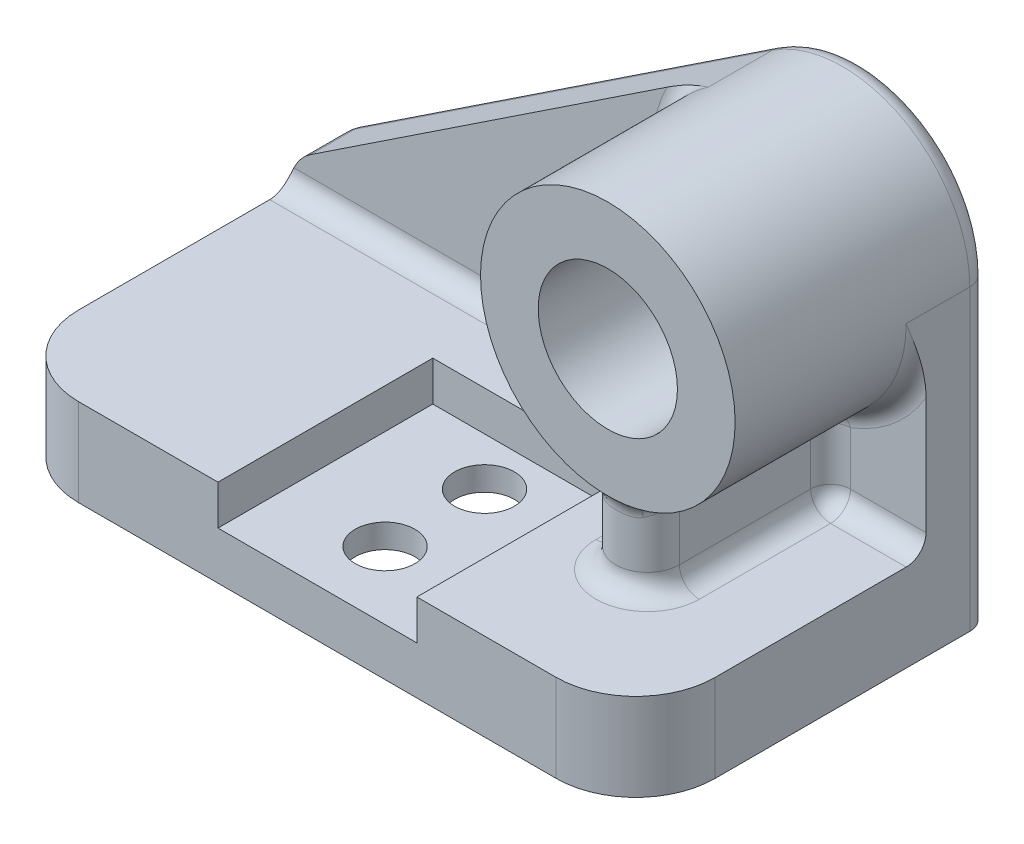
ISO-10303-21;
HEADER;
FILE_DESCRIPTION(('STEP AP214'),'2;1');
FILE_NAME('part.step','',(''),(''),'','','');
FILE_SCHEMA(('AUTOMOTIVE_DESIGN { 1 0 10303 214 1 1 1 1 }'));
ENDSEC;
DATA;
#1=APPLICATION_CONTEXT('core data for automotive mechanical design processes');
#2=APPLICATION_PROTOCOL_DEFINITION('international standard','automotive_design',2000,#1);
#3=PRODUCT_CONTEXT('',#1,'mechanical');
#4=PRODUCT('Part','Part','',(#3));
#5=PRODUCT_RELATED_PRODUCT_CATEGORY('part','',(#4));
#6=PRODUCT_DEFINITION_FORMATION('','',#4);
#7=PRODUCT_DEFINITION_CONTEXT('part definition',#1,'design');
#8=PRODUCT_DEFINITION('design','',#6,#7);
#9=PRODUCT_DEFINITION_SHAPE('','',#8);
#10=(LENGTH_UNIT() NAMED_UNIT(*) SI_UNIT(.MILLI.,.METRE.));
#11=(NAMED_UNIT(*) PLANE_ANGLE_UNIT() SI_UNIT($,.RADIAN.));
#12=(NAMED_UNIT(*) SI_UNIT($,.STERADIAN.) SOLID_ANGLE_UNIT());
#13=UNCERTAINTY_MEASURE_WITH_UNIT(LENGTH_MEASURE(1.E-05),#10,'distance_accuracy_value','');
#14=(GEOMETRIC_REPRESENTATION_CONTEXT(3) GLOBAL_UNCERTAINTY_ASSIGNED_CONTEXT((#13)) GLOBAL_UNIT_ASSIGNED_CONTEXT((#10,
#11,#12)) REPRESENTATION_CONTEXT('',''));
#15=CARTESIAN_POINT('',(0.,0.,0.));
#16=DIRECTION('',(0.,0.,1.));
#17=DIRECTION('',(1.,0.,0.));
#18=AXIS2_PLACEMENT_3D('',#15,#16,#17);
#19=CARTESIAN_POINT('',(128.,75.,-73.));
#20=DIRECTION('',(0.,0.,-1.));
#21=DIRECTION('',(-1.,0.,0.));
#22=AXIS2_PLACEMENT_3D('',#19,#20,#21);
#23=PLANE('',#22);
#24=DIRECTION('',(0.,-1.,0.));
#25=VECTOR('',#24,1.);
#26=CARTESIAN_POINT('',(115.,40.3589838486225,-73.));
#27=LINE('',#26,#25);
#28=CARTESIAN_POINT('',(115.,27.,-73.));
#29=VERTEX_POINT('',#28);
#30=CARTESIAN_POINT('',(115.,40.3589838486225,-73.));
#31=VERTEX_POINT('',#30);
#32=EDGE_CURVE('E814',#29,#31,#27,.F.);
#33=ORIENTED_EDGE('',*,*,#32,.T.);
#34=CARTESIAN_POINT('',(128.,75.,-73.));
#35=DIRECTION('',(0.,0.,-1.));
#36=DIRECTION('',(-1.,0.,0.));
#37=AXIS2_PLACEMENT_3D('',#34,#35,#36);
#38=CIRCLE('',#37,37.);
#39=CARTESIAN_POINT('',(94.8269650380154,91.3874876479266,-73.));
#40=VERTEX_POINT('',#39);
#41=EDGE_CURVE('E314',#31,#40,#38,.T.);
#42=ORIENTED_EDGE('',*,*,#41,.T.);
#43=DIRECTION('',(0.833134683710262,0.553070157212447,0.));
#44=VECTOR('',#43,1.);
#45=CARTESIAN_POINT('',(5.36315811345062,31.9976162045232,-73.));
#46=LINE('',#45,#44);
#47=CARTESIAN_POINT('',(5.36315811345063,31.9976162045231,-73.));
#48=VERTEX_POINT('',#47);
#49=EDGE_CURVE('E301',#48,#40,#46,.T.);
#50=ORIENTED_EDGE('',*,*,#49,.F.);
#51=CARTESIAN_POINT('',(12.,22.,-73.));
#52=DIRECTION('',(0.,0.,-1.));
#53=DIRECTION('',(-1.,0.,0.));
#54=AXIS2_PLACEMENT_3D('',#51,#52,#53);
#55=CIRCLE('',#54,12.);
#56=CARTESIAN_POINT('',(1.09128788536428,27.,-73.));
#57=VERTEX_POINT('',#56);
#58=EDGE_CURVE('E290',#57,#48,#55,.T.);
#59=ORIENTED_EDGE('',*,*,#58,.F.);
#60=DIRECTION('',(-1.,0.,0.));
#61=VECTOR('',#60,1.);
#62=CARTESIAN_POINT('',(128.,27.,-73.));
#63=LINE('',#62,#61);
#64=EDGE_CURVE('E645',#57,#29,#63,.F.);
#65=ORIENTED_EDGE('',*,*,#64,.T.);
#66=EDGE_LOOP('',(#33,#42,#50,#59,#65));
#67=FACE_BOUND('',#66,.T.);
#68=ADVANCED_FACE('F28',(#67),#23,.F.);
#69=CARTESIAN_POINT('',(160.,22.,0.));
#70=DIRECTION('',(0.,1.,0.));
#71=DIRECTION('',(0.,0.,1.));
#72=AXIS2_PLACEMENT_3D('',#69,#70,#71);
#73=PLANE('',#72);
#74=DIRECTION('',(0.,0.,1.));
#75=VECTOR('',#74,1.);
#76=CARTESIAN_POINT('',(160.,22.,-89.));
#77=LINE('',#76,#75);
#78=CARTESIAN_POINT('',(160.,22.,-68.));
#79=VERTEX_POINT('',#78);
#80=CARTESIAN_POINT('',(160.,22.,-20.));
#81=VERTEX_POINT('',#80);
#82=EDGE_CURVE('E450',#79,#81,#77,.T.);
#83=ORIENTED_EDGE('',*,*,#82,.F.);
#84=DIRECTION('',(-1.,0.,0.));
#85=VECTOR('',#84,1.);
#86=CARTESIAN_POINT('',(160.,22.,-68.));
#87=LINE('',#86,#85);
#88=CARTESIAN_POINT('',(141.,22.,-68.));
#89=VERTEX_POINT('',#88);
#90=EDGE_CURVE('E466',#79,#89,#87,.T.);
#91=ORIENTED_EDGE('',*,*,#90,.T.);
#92=DIRECTION('',(0.,0.,1.));
#93=VECTOR('',#92,1.);
#94=CARTESIAN_POINT('',(141.,22.,-35.));
#95=LINE('',#94,#93);
#96=CARTESIAN_POINT('',(141.,22.,-35.));
#97=VERTEX_POINT('',#96);
#98=EDGE_CURVE('E614',#89,#97,#95,.T.);
#99=ORIENTED_EDGE('',*,*,#98,.T.);
#100=CARTESIAN_POINT('',(128.,22.,-35.));
#101=DIRECTION('',(0.,1.,0.));
#102=DIRECTION('',(0.,0.,1.));
#103=AXIS2_PLACEMENT_3D('',#100,#101,#102);
#104=CIRCLE('',#103,13.);
#105=CARTESIAN_POINT('',(115.,22.,-35.));
#106=VERTEX_POINT('',#105);
#107=EDGE_CURVE('E611',#97,#106,#104,.F.);
#108=ORIENTED_EDGE('',*,*,#107,.T.);
#109=DIRECTION('',(0.,0.,1.));
#110=VECTOR('',#109,1.);
#111=CARTESIAN_POINT('',(115.,22.,0.));
#112=LINE('',#111,#110);
#113=CARTESIAN_POINT('',(115.,22.,-68.));
#114=VERTEX_POINT('',#113);
#115=EDGE_CURVE('E609',#106,#114,#112,.F.);
#116=ORIENTED_EDGE('',*,*,#115,.T.);
#117=DIRECTION('',(-1.,0.,0.));
#118=VECTOR('',#117,1.);
#119=CARTESIAN_POINT('',(160.,22.,-68.));
#120=LINE('',#119,#118);
#121=CARTESIAN_POINT('',(0.,22.,-68.));
#122=VERTEX_POINT('',#121);
#123=EDGE_CURVE('E463',#114,#122,#120,.T.);
#124=ORIENTED_EDGE('',*,*,#123,.T.);
#125=DIRECTION('',(0.,0.,-1.));
#126=VECTOR('',#125,1.);
#127=CARTESIAN_POINT('',(0.,22.,0.));
#128=LINE('',#127,#126);
#129=CARTESIAN_POINT('',(0.,22.,-20.));
#130=VERTEX_POINT('',#129);
#131=EDGE_CURVE('E751',#130,#122,#128,.T.);
#132=ORIENTED_EDGE('',*,*,#131,.F.);
#133=CARTESIAN_POINT('',(20.,22.,-20.));
#134=DIRECTION('',(0.,1.,0.));
#135=DIRECTION('',(0.,0.,1.));
#136=AXIS2_PLACEMENT_3D('',#133,#134,#135);
#137=CIRCLE('',#136,20.);
#138=CARTESIAN_POINT('',(20.,22.,0.));
#139=VERTEX_POINT('',#138);
#140=EDGE_CURVE('E961',#130,#139,#137,.T.);
#141=ORIENTED_EDGE('',*,*,#140,.T.);
#142=DIRECTION('',(1.,0.,0.));
#143=VECTOR('',#142,1.);
#144=CARTESIAN_POINT('',(0.,22.,0.));
#145=LINE('',#144,#143);
#146=CARTESIAN_POINT('',(55.,22.,0.));
#147=VERTEX_POINT('',#146);
#148=EDGE_CURVE('E453',#139,#147,#145,.T.);
#149=ORIENTED_EDGE('',*,*,#148,.T.);
#150=DIRECTION('',(0.,0.,1.));
#151=VECTOR('',#150,1.);
#152=CARTESIAN_POINT('',(55.,22.,0.));
#153=LINE('',#152,#151);
#154=CARTESIAN_POINT('',(55.,22.,-54.));
#155=VERTEX_POINT('',#154);
#156=EDGE_CURVE('E343',#155,#147,#153,.T.);
#157=ORIENTED_EDGE('',*,*,#156,.F.);
#158=DIRECTION('',(-1.,0.,0.));
#159=VECTOR('',#158,1.);
#160=CARTESIAN_POINT('',(55.,22.,-54.));
#161=LINE('',#160,#159);
#162=CARTESIAN_POINT('',(105.,22.,-54.));
#163=VERTEX_POINT('',#162);
#164=EDGE_CURVE('E415',#163,#155,#161,.T.);
#165=ORIENTED_EDGE('',*,*,#164,.F.);
#166=DIRECTION('',(0.,0.,-1.));
#167=VECTOR('',#166,1.);
#168=CARTESIAN_POINT('',(105.,22.,0.));
#169=LINE('',#168,#167);
#170=CARTESIAN_POINT('',(105.,22.,0.));
#171=VERTEX_POINT('',#170);
#172=EDGE_CURVE('E412',#171,#163,#169,.T.);
#173=ORIENTED_EDGE('',*,*,#172,.F.);
#174=CARTESIAN_POINT('',(140.,22.,0.));
#175=VERTEX_POINT('',#174);
#176=EDGE_CURVE('E458',#171,#175,#145,.T.);
#177=ORIENTED_EDGE('',*,*,#176,.T.);
#178=CARTESIAN_POINT('',(140.,22.,-20.));
#179=DIRECTION('',(0.,1.,0.));
#180=DIRECTION('',(0.,0.,1.));
#181=AXIS2_PLACEMENT_3D('',#178,#179,#180);
#182=CIRCLE('',#181,20.);
#183=EDGE_CURVE('E968',#175,#81,#182,.T.);
#184=ORIENTED_EDGE('',*,*,#183,.T.);
#185=EDGE_LOOP('',(#83,#91,#99,#108,#116,#124,#132,#141,#149,#157,#165,#173,#177,#184));
#186=FACE_BOUND('',#185,.T.);
#187=ADVANCED_FACE('F822',(#186),#73,.T.);
#188=CARTESIAN_POINT('',(160.,22.,-89.));
#189=DIRECTION('',(1.,0.,0.));
#190=DIRECTION('',(0.,0.,-1.));
#191=AXIS2_PLACEMENT_3D('',#188,#189,#190);
#192=PLANE('',#191);
#193=DIRECTION('',(0.,0.,1.));
#194=VECTOR('',#193,1.);
#195=CARTESIAN_POINT('',(160.,0.,-89.));
#196=LINE('',#195,#194);
#197=CARTESIAN_POINT('',(160.,0.,-84.));
#198=VERTEX_POINT('',#197);
#199=CARTESIAN_POINT('',(160.,0.,-20.));
#200=VERTEX_POINT('',#199);
#201=EDGE_CURVE('E433',#198,#200,#196,.T.);
#202=ORIENTED_EDGE('',*,*,#201,.F.);
#203=DIRECTION('',(0.,-1.,0.));
#204=VECTOR('',#203,1.);
#205=CARTESIAN_POINT('',(160.,75.,-84.));
#206=LINE('',#205,#204);
#207=CARTESIAN_POINT('',(160.,75.,-84.));
#208=VERTEX_POINT('',#207);
#209=EDGE_CURVE('E460',#198,#208,#206,.F.);
#210=ORIENTED_EDGE('',*,*,#209,.T.);
#211=DIRECTION('',(0.,0.,-1.));
#212=VECTOR('',#211,1.);
#213=CARTESIAN_POINT('',(160.,75.,-73.));
#214=LINE('',#213,#212);
#215=CARTESIAN_POINT('',(160.,75.,-68.));
#216=VERTEX_POINT('',#215);
#217=EDGE_CURVE('E324',#216,#208,#214,.T.);
#218=ORIENTED_EDGE('',*,*,#217,.F.);
#219=CARTESIAN_POINT('',(160.,56.4258243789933,-73.));
#220=CARTESIAN_POINT('',(160.,56.6096562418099,-72.9999960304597));
#221=CARTESIAN_POINT('',(160.,56.793473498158,-72.9974455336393));
#222=CARTESIAN_POINT('',(160.,57.1609618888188,-72.9875602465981));
#223=CARTESIAN_POINT('',(160.,57.3446330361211,-72.9802259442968));
#224=CARTESIAN_POINT('',(160.,57.8950786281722,-72.9515215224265));
#225=CARTESIAN_POINT('',(160.,58.2615153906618,-72.9234491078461));
#226=CARTESIAN_POINT('',(160.,58.9918093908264,-72.8516706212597));
#227=CARTESIAN_POINT('',(160.,59.3556709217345,-72.8080069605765));
#228=CARTESIAN_POINT('',(160.,60.081512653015,-72.7068588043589));
#229=CARTESIAN_POINT('',(160.,60.4434925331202,-72.6493720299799));
#230=CARTESIAN_POINT('',(160.,61.1619424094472,-72.5227801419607));
#231=CARTESIAN_POINT('',(160.,61.51843238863,-72.4537875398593));
#232=CARTESIAN_POINT('',(160.,62.2292055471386,-72.3051956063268));
#233=CARTESIAN_POINT('',(160.,62.5834885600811,-72.2255954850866));
#234=CARTESIAN_POINT('',(160.,63.6434519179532,-71.9726555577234));
#235=CARTESIAN_POINT('',(160.,64.3457884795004,-71.7852601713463));
#236=CARTESIAN_POINT('',(160.,65.8877303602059,-71.3395166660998));
#237=CARTESIAN_POINT('',(160.,66.7253810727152,-71.0745234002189));
#238=CARTESIAN_POINT('',(160.,68.3904437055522,-70.5149675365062));
#239=CARTESIAN_POINT('',(160.,69.2178573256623,-70.2204099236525));
#240=CARTESIAN_POINT('',(160.,71.6929484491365,-69.3072041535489));
#241=CARTESIAN_POINT('',(160.,73.3299714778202,-68.6601365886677));
#242=CARTESIAN_POINT('',(160.,74.9778186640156,-68.0087679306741));
#243=CARTESIAN_POINT('',(160.,74.9889093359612,-68.0043839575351));
#244=CARTESIAN_POINT('',(160.,75.,-68.));
#245=B_SPLINE_CURVE_WITH_KNOTS('',3,(#219,#220,#221,#222,#223,#224,#225,#226,#227,#228,#229,
#230,#231,#232,#233,#234,#235,#236,#237,#238,#239,#240,#241,#242,#243,#244),.UNSPECIFIED.,.F.,
.F.,(4,2,2,2,2,2,2,2,2,2,2,2,4),(0.,0.551453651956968,1.10285106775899,2.20495618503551,
3.30408591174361,4.40339696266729,5.49252870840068,6.58174159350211,8.76156260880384,
11.3964778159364,14.0309494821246,19.3109105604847,19.3466876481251),.UNSPECIFIED.);
#246=CARTESIAN_POINT('',(160.,56.4258243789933,-73.));
#247=VERTEX_POINT('',#246);
#248=EDGE_CURVE('E468',#216,#247,#245,.F.);
#249=ORIENTED_EDGE('',*,*,#248,.T.);
#250=DIRECTION('',(0.,1.,0.));
#251=VECTOR('',#250,1.);
#252=CARTESIAN_POINT('',(160.,22.,-73.));
#253=LINE('',#252,#251);
#254=CARTESIAN_POINT('',(160.,27.,-73.));
#255=VERTEX_POINT('',#254);
#256=EDGE_CURVE('E315',#255,#247,#253,.T.);
#257=ORIENTED_EDGE('',*,*,#256,.F.);
#258=CARTESIAN_POINT('',(160.,27.,-68.));
#259=DIRECTION('',(1.,0.,0.));
#260=DIRECTION('',(0.,0.,-1.));
#261=AXIS2_PLACEMENT_3D('',#258,#259,#260);
#262=CIRCLE('',#261,5.);
#263=EDGE_CURVE('E43',#255,#79,#262,.F.);
#264=ORIENTED_EDGE('',*,*,#263,.T.);
#265=ORIENTED_EDGE('',*,*,#82,.T.);
#266=DIRECTION('',(0.,-1.,0.));
#267=VECTOR('',#266,1.);
#268=CARTESIAN_POINT('',(160.,0.,-20.));
#269=LINE('',#268,#267);
#270=EDGE_CURVE('E612',#81,#200,#269,.T.);
#271=ORIENTED_EDGE('',*,*,#270,.T.);
#272=EDGE_LOOP('',(#202,#210,#218,#249,#257,#264,#265,#271));
#273=FACE_BOUND('',#272,.T.);
#274=ADVANCED_FACE('F481',(#273),#192,.T.);
#275=CARTESIAN_POINT('',(160.,22.,-89.));
#276=DIRECTION('',(0.,0.,1.));
#277=DIRECTION('',(1.,0.,0.));
#278=AXIS2_PLACEMENT_3D('',#275,#276,#277);
#279=PLANE('',#278);
#280=CARTESIAN_POINT('',(128.,75.,-89.));
#281=DIRECTION('',(0.,0.,1.));
#282=DIRECTION('',(1.,0.,0.));
#283=AXIS2_PLACEMENT_3D('',#280,#281,#282);
#284=CIRCLE('',#283,17.5);
#285=CARTESIAN_POINT('',(145.5,75.,-89.));
#286=VERTEX_POINT('',#285);
#287=EDGE_CURVE('E773',#286,#286,#284,.T.);
#288=ORIENTED_EDGE('',*,*,#287,.T.);
#289=EDGE_LOOP('',(#288));
#290=FACE_BOUND('',#289,.T.);
#291=DIRECTION('',(-1.,0.,0.));
#292=VECTOR('',#291,1.);
#293=CARTESIAN_POINT('',(160.,0.,-89.));
#294=LINE('',#293,#292);
#295=CARTESIAN_POINT('',(155.,0.,-89.));
#296=VERTEX_POINT('',#295);
#297=CARTESIAN_POINT('',(5.,0.,-89.));
#298=VERTEX_POINT('',#297);
#299=EDGE_CURVE('E447',#296,#298,#294,.T.);
#300=ORIENTED_EDGE('',*,*,#299,.T.);
#301=DIRECTION('',(0.,-1.,0.));
#302=VECTOR('',#301,1.);
#303=CARTESIAN_POINT('',(5.,22.,-89.));
#304=LINE('',#303,#302);
#305=CARTESIAN_POINT('',(4.99999999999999,22.,-89.));
#306=VERTEX_POINT('',#305);
#307=EDGE_CURVE('E718',#298,#306,#304,.F.);
#308=ORIENTED_EDGE('',*,*,#307,.T.);
#309=CARTESIAN_POINT('',(12.,22.,-89.));
#310=DIRECTION('',(0.,0.,1.));
#311=DIRECTION('',(1.,0.,0.));
#312=AXIS2_PLACEMENT_3D('',#309,#310,#311);
#313=CIRCLE('',#312,7.);
#314=CARTESIAN_POINT('',(8.12850889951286,27.8319427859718,-89.));
#315=VERTEX_POINT('',#314);
#316=EDGE_CURVE('E722',#306,#315,#313,.F.);
#317=ORIENTED_EDGE('',*,*,#316,.T.);
#318=DIRECTION('',(0.833134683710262,0.553070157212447,0.));
#319=VECTOR('',#318,1.);
#320=CARTESIAN_POINT('',(113.067105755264,97.4946364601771,-89.));
#321=LINE('',#320,#319);
#322=CARTESIAN_POINT('',(113.067105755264,97.4946364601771,-89.));
#323=VERTEX_POINT('',#322);
#324=EDGE_CURVE('E788',#315,#323,#321,.T.);
#325=ORIENTED_EDGE('',*,*,#324,.T.);
#326=CARTESIAN_POINT('',(128.,75.,-89.));
#327=DIRECTION('',(0.,0.,1.));
#328=DIRECTION('',(1.,0.,0.));
#329=AXIS2_PLACEMENT_3D('',#326,#327,#328);
#330=CIRCLE('',#329,27.);
#331=CARTESIAN_POINT('',(155.,75.,-89.));
#332=VERTEX_POINT('',#331);
#333=EDGE_CURVE('E784',#323,#332,#330,.F.);
#334=ORIENTED_EDGE('',*,*,#333,.T.);
#335=DIRECTION('',(0.,-1.,0.));
#336=VECTOR('',#335,1.);
#337=CARTESIAN_POINT('',(155.,0.,-89.));
#338=LINE('',#337,#336);
#339=EDGE_CURVE('E786',#332,#296,#338,.T.);
#340=ORIENTED_EDGE('',*,*,#339,.T.);
#341=EDGE_LOOP('',(#300,#308,#317,#325,#334,#340));
#342=FACE_BOUND('',#341,.T.);
#343=ADVANCED_FACE('F791',(#290,#342),#279,.F.);
#344=CARTESIAN_POINT('',(0.,22.,0.));
#345=DIRECTION('',(-1.,0.,0.));
#346=DIRECTION('',(0.,0.,1.));
#347=AXIS2_PLACEMENT_3D('',#344,#345,#346);
#348=PLANE('',#347);
#349=DIRECTION('',(0.,0.,-1.));
#350=VECTOR('',#349,1.);
#351=CARTESIAN_POINT('',(0.,22.,-73.));
#352=LINE('',#351,#350);
#353=CARTESIAN_POINT('',(0.,22.,-84.));
#354=VERTEX_POINT('',#353);
#355=EDGE_CURVE('E300',#122,#354,#352,.T.);
#356=ORIENTED_EDGE('',*,*,#355,.T.);
#357=DIRECTION('',(0.,-1.,0.));
#358=VECTOR('',#357,1.);
#359=CARTESIAN_POINT('',(0.,0.,-84.));
#360=LINE('',#359,#358);
#361=CARTESIAN_POINT('',(0.,0.,-84.));
#362=VERTEX_POINT('',#361);
#363=EDGE_CURVE('E761',#354,#362,#360,.T.);
#364=ORIENTED_EDGE('',*,*,#363,.T.);
#365=DIRECTION('',(0.,0.,-1.));
#366=VECTOR('',#365,1.);
#367=CARTESIAN_POINT('',(0.,0.,0.));
#368=LINE('',#367,#366);
#369=CARTESIAN_POINT('',(0.,0.,-20.));
#370=VERTEX_POINT('',#369);
#371=EDGE_CURVE('E444',#370,#362,#368,.T.);
#372=ORIENTED_EDGE('',*,*,#371,.F.);
#373=DIRECTION('',(0.,-1.,0.));
#374=VECTOR('',#373,1.);
#375=CARTESIAN_POINT('',(0.,22.,-20.));
#376=LINE('',#375,#374);
#377=EDGE_CURVE('E976',#370,#130,#376,.F.);
#378=ORIENTED_EDGE('',*,*,#377,.T.);
#379=ORIENTED_EDGE('',*,*,#131,.T.);
#380=EDGE_LOOP('',(#356,#364,#372,#378,#379));
#381=FACE_BOUND('',#380,.T.);
#382=ADVANCED_FACE('F758',(#381),#348,.T.);
#383=CARTESIAN_POINT('',(0.,22.,0.));
#384=DIRECTION('',(0.,0.,-1.));
#385=DIRECTION('',(-1.,0.,0.));
#386=AXIS2_PLACEMENT_3D('',#383,#384,#385);
#387=PLANE('',#386);
#388=DIRECTION('',(1.,0.,0.));
#389=VECTOR('',#388,1.);
#390=CARTESIAN_POINT('',(55.,12.,0.));
#391=LINE('',#390,#389);
#392=CARTESIAN_POINT('',(55.,12.,0.));
#393=VERTEX_POINT('',#392);
#394=CARTESIAN_POINT('',(105.,12.,0.));
#395=VERTEX_POINT('',#394);
#396=EDGE_CURVE('E421',#393,#395,#391,.T.);
#397=ORIENTED_EDGE('',*,*,#396,.F.);
#398=DIRECTION('',(0.,1.,0.));
#399=VECTOR('',#398,1.);
#400=CARTESIAN_POINT('',(55.,12.,0.));
#401=LINE('',#400,#399);
#402=EDGE_CURVE('E430',#393,#147,#401,.T.);
#403=ORIENTED_EDGE('',*,*,#402,.T.);
#404=ORIENTED_EDGE('',*,*,#148,.F.);
#405=DIRECTION('',(0.,-1.,0.));
#406=VECTOR('',#405,1.);
#407=CARTESIAN_POINT('',(20.,0.,0.));
#408=LINE('',#407,#406);
#409=CARTESIAN_POINT('',(20.,0.,0.));
#410=VERTEX_POINT('',#409);
#411=EDGE_CURVE('E973',#139,#410,#408,.T.);
#412=ORIENTED_EDGE('',*,*,#411,.T.);
#413=DIRECTION('',(1.,0.,0.));
#414=VECTOR('',#413,1.);
#415=CARTESIAN_POINT('',(0.,0.,0.));
#416=LINE('',#415,#414);
#417=CARTESIAN_POINT('',(140.,0.,0.));
#418=VERTEX_POINT('',#417);
#419=EDGE_CURVE('E441',#410,#418,#416,.T.);
#420=ORIENTED_EDGE('',*,*,#419,.T.);
#421=DIRECTION('',(0.,-1.,0.));
#422=VECTOR('',#421,1.);
#423=CARTESIAN_POINT('',(140.,22.,0.));
#424=LINE('',#423,#422);
#425=EDGE_CURVE('E964',#418,#175,#424,.F.);
#426=ORIENTED_EDGE('',*,*,#425,.T.);
#427=ORIENTED_EDGE('',*,*,#176,.F.);
#428=DIRECTION('',(0.,1.,0.));
#429=VECTOR('',#428,1.);
#430=CARTESIAN_POINT('',(105.,12.,0.));
#431=LINE('',#430,#429);
#432=EDGE_CURVE('E436',#395,#171,#431,.T.);
#433=ORIENTED_EDGE('',*,*,#432,.F.);
#434=EDGE_LOOP('',(#397,#403,#404,#412,#420,#426,#427,#433));
#435=FACE_BOUND('',#434,.T.);
#436=ADVANCED_FACE('F939',(#435),#387,.F.);
#437=CARTESIAN_POINT('',(160.,0.,0.));
#438=DIRECTION('',(0.,1.,0.));
#439=DIRECTION('',(0.,0.,1.));
#440=AXIS2_PLACEMENT_3D('',#437,#438,#439);
#441=PLANE('',#440);
#442=CARTESIAN_POINT('',(20.,0.,-20.));
#443=DIRECTION('',(0.,1.,0.));
#444=DIRECTION('',(0.,0.,1.));
#445=AXIS2_PLACEMENT_3D('',#442,#443,#444);
#446=CIRCLE('',#445,14.);
#447=CARTESIAN_POINT('',(20.,0.,-6.));
#448=VERTEX_POINT('',#447);
#449=CARTESIAN_POINT('',(6.,0.,-20.));
#450=VERTEX_POINT('',#449);
#451=EDGE_CURVE('E358',#448,#450,#446,.F.);
#452=ORIENTED_EDGE('',*,*,#451,.F.);
#453=DIRECTION('',(1.,0.,0.));
#454=VECTOR('',#453,1.);
#455=CARTESIAN_POINT('',(0.,0.,-6.));
#456=LINE('',#455,#454);
#457=CARTESIAN_POINT('',(140.,0.,-6.));
#458=VERTEX_POINT('',#457);
#459=EDGE_CURVE('E402',#448,#458,#456,.T.);
#460=ORIENTED_EDGE('',*,*,#459,.T.);
#461=CARTESIAN_POINT('',(140.,0.,-20.));
#462=DIRECTION('',(0.,1.,0.));
#463=DIRECTION('',(0.,0.,1.));
#464=AXIS2_PLACEMENT_3D('',#461,#462,#463);
#465=CIRCLE('',#464,14.);
#466=CARTESIAN_POINT('',(154.,0.,-20.));
#467=VERTEX_POINT('',#466);
#468=EDGE_CURVE('E386',#467,#458,#465,.F.);
#469=ORIENTED_EDGE('',*,*,#468,.F.);
#470=DIRECTION('',(0.,0.,1.));
#471=VECTOR('',#470,1.);
#472=CARTESIAN_POINT('',(154.,0.,-89.));
#473=LINE('',#472,#471);
#474=CARTESIAN_POINT('',(154.,0.,-83.));
#475=VERTEX_POINT('',#474);
#476=EDGE_CURVE('E395',#475,#467,#473,.T.);
#477=ORIENTED_EDGE('',*,*,#476,.F.);
#478=DIRECTION('',(-1.,0.,0.));
#479=VECTOR('',#478,1.);
#480=CARTESIAN_POINT('',(160.,0.,-83.));
#481=LINE('',#480,#479);
#482=CARTESIAN_POINT('',(6.,0.,-83.));
#483=VERTEX_POINT('',#482);
#484=EDGE_CURVE('E339',#475,#483,#481,.T.);
#485=ORIENTED_EDGE('',*,*,#484,.T.);
#486=DIRECTION('',(0.,0.,-1.));
#487=VECTOR('',#486,1.);
#488=CARTESIAN_POINT('',(6.,0.,0.));
#489=LINE('',#488,#487);
#490=EDGE_CURVE('E406',#450,#483,#489,.T.);
#491=ORIENTED_EDGE('',*,*,#490,.F.);
#492=EDGE_LOOP('',(#452,#460,#469,#477,#485,#491));
#493=FACE_BOUND('',#492,.T.);
#494=ORIENTED_EDGE('',*,*,#371,.T.);
#495=CARTESIAN_POINT('',(5.,0.,-84.));
#496=DIRECTION('',(0.,1.,0.));
#497=DIRECTION('',(0.,0.,1.));
#498=AXIS2_PLACEMENT_3D('',#495,#496,#497);
#499=CIRCLE('',#498,5.);
#500=EDGE_CURVE('E776',#362,#298,#499,.F.);
#501=ORIENTED_EDGE('',*,*,#500,.T.);
#502=ORIENTED_EDGE('',*,*,#299,.F.);
#503=CARTESIAN_POINT('',(155.,0.,-84.));
#504=DIRECTION('',(0.,1.,0.));
#505=DIRECTION('',(0.,0.,1.));
#506=AXIS2_PLACEMENT_3D('',#503,#504,#505);
#507=CIRCLE('',#506,5.);
#508=EDGE_CURVE('E777',#296,#198,#507,.F.);
#509=ORIENTED_EDGE('',*,*,#508,.T.);
#510=ORIENTED_EDGE('',*,*,#201,.T.);
#511=CARTESIAN_POINT('',(140.,0.,-20.));
#512=DIRECTION('',(0.,1.,0.));
#513=DIRECTION('',(0.,0.,1.));
#514=AXIS2_PLACEMENT_3D('',#511,#512,#513);
#515=CIRCLE('',#514,20.);
#516=EDGE_CURVE('E1017',#200,#418,#515,.F.);
#517=ORIENTED_EDGE('',*,*,#516,.T.);
#518=ORIENTED_EDGE('',*,*,#419,.F.);
#519=CARTESIAN_POINT('',(20.,0.,-20.));
#520=DIRECTION('',(0.,1.,0.));
#521=DIRECTION('',(0.,0.,1.));
#522=AXIS2_PLACEMENT_3D('',#519,#520,#521);
#523=CIRCLE('',#522,20.);
#524=EDGE_CURVE('E979',#410,#370,#523,.F.);
#525=ORIENTED_EDGE('',*,*,#524,.T.);
#526=EDGE_LOOP('',(#494,#501,#502,#509,#510,#517,#518,#525));
#527=FACE_BOUND('',#526,.T.);
#528=ADVANCED_FACE('F937',(#493,#527),#441,.F.);
#529=CARTESIAN_POINT('',(20.,22.,-20.));
#530=DIRECTION('',(0.,1.,0.));
#531=DIRECTION('',(0.,0.,1.));
#532=AXIS2_PLACEMENT_3D('',#529,#530,#531);
#533=CYLINDRICAL_SURFACE('',#532,20.);
#534=ORIENTED_EDGE('',*,*,#140,.F.);
#535=ORIENTED_EDGE('',*,*,#377,.F.);
#536=ORIENTED_EDGE('',*,*,#524,.F.);
#537=ORIENTED_EDGE('',*,*,#411,.F.);
#538=EDGE_LOOP('',(#534,#535,#536,#537));
#539=FACE_BOUND('',#538,.T.);
#540=ADVANCED_FACE('F933',(#539),#533,.T.);
#541=CARTESIAN_POINT('',(140.,22.,-20.));
#542=DIRECTION('',(0.,1.,0.));
#543=DIRECTION('',(0.,0.,1.));
#544=AXIS2_PLACEMENT_3D('',#541,#542,#543);
#545=CYLINDRICAL_SURFACE('',#544,20.);
#546=ORIENTED_EDGE('',*,*,#183,.F.);
#547=ORIENTED_EDGE('',*,*,#425,.F.);
#548=ORIENTED_EDGE('',*,*,#516,.F.);
#549=ORIENTED_EDGE('',*,*,#270,.F.);
#550=EDGE_LOOP('',(#546,#547,#548,#549));
#551=FACE_BOUND('',#550,.T.);
#552=ADVANCED_FACE('F929',(#551),#545,.T.);
#553=CARTESIAN_POINT('',(55.,12.,0.));
#554=DIRECTION('',(-1.,0.,0.));
#555=DIRECTION('',(0.,0.,1.));
#556=AXIS2_PLACEMENT_3D('',#553,#554,#555);
#557=PLANE('',#556);
#558=ORIENTED_EDGE('',*,*,#156,.T.);
#559=ORIENTED_EDGE('',*,*,#402,.F.);
#560=DIRECTION('',(0.,0.,1.));
#561=VECTOR('',#560,1.);
#562=CARTESIAN_POINT('',(55.,12.,0.));
#563=LINE('',#562,#561);
#564=CARTESIAN_POINT('',(55.,12.,-54.));
#565=VERTEX_POINT('',#564);
#566=EDGE_CURVE('E418',#565,#393,#563,.T.);
#567=ORIENTED_EDGE('',*,*,#566,.F.);
#568=DIRECTION('',(0.,1.,0.));
#569=VECTOR('',#568,1.);
#570=CARTESIAN_POINT('',(55.,12.,-54.));
#571=LINE('',#570,#569);
#572=EDGE_CURVE('E431',#565,#155,#571,.T.);
#573=ORIENTED_EDGE('',*,*,#572,.T.);
#574=EDGE_LOOP('',(#558,#559,#567,#573));
#575=FACE_BOUND('',#574,.T.);
#576=ADVANCED_FACE('F922',(#575),#557,.F.);
#577=CARTESIAN_POINT('',(55.,12.,-54.));
#578=DIRECTION('',(0.,0.,-1.));
#579=DIRECTION('',(-1.,0.,0.));
#580=AXIS2_PLACEMENT_3D('',#577,#578,#579);
#581=PLANE('',#580);
#582=ORIENTED_EDGE('',*,*,#164,.T.);
#583=ORIENTED_EDGE('',*,*,#572,.F.);
#584=DIRECTION('',(-1.,0.,0.));
#585=VECTOR('',#584,1.);
#586=CARTESIAN_POINT('',(55.,12.,-54.));
#587=LINE('',#586,#585);
#588=CARTESIAN_POINT('',(105.,12.,-54.));
#589=VERTEX_POINT('',#588);
#590=EDGE_CURVE('E427',#589,#565,#587,.T.);
#591=ORIENTED_EDGE('',*,*,#590,.F.);
#592=DIRECTION('',(0.,1.,0.));
#593=VECTOR('',#592,1.);
#594=CARTESIAN_POINT('',(105.,12.,-54.));
#595=LINE('',#594,#593);
#596=EDGE_CURVE('E434',#589,#163,#595,.T.);
#597=ORIENTED_EDGE('',*,*,#596,.T.);
#598=EDGE_LOOP('',(#582,#583,#591,#597));
#599=FACE_BOUND('',#598,.T.);
#600=ADVANCED_FACE('F919',(#599),#581,.F.);
#601=CARTESIAN_POINT('',(105.,12.,0.));
#602=DIRECTION('',(1.,0.,0.));
#603=DIRECTION('',(0.,0.,-1.));
#604=AXIS2_PLACEMENT_3D('',#601,#602,#603);
#605=PLANE('',#604);
#606=ORIENTED_EDGE('',*,*,#172,.T.);
#607=ORIENTED_EDGE('',*,*,#596,.F.);
#608=DIRECTION('',(0.,0.,-1.));
#609=VECTOR('',#608,1.);
#610=CARTESIAN_POINT('',(105.,12.,0.));
#611=LINE('',#610,#609);
#612=EDGE_CURVE('E424',#395,#589,#611,.T.);
#613=ORIENTED_EDGE('',*,*,#612,.F.);
#614=ORIENTED_EDGE('',*,*,#432,.T.);
#615=EDGE_LOOP('',(#606,#607,#613,#614));
#616=FACE_BOUND('',#615,.T.);
#617=ADVANCED_FACE('F917',(#616),#605,.F.);
#618=CARTESIAN_POINT('',(55.,12.,-54.));
#619=DIRECTION('',(0.,-1.,0.));
#620=DIRECTION('',(0.,0.,-1.));
#621=AXIS2_PLACEMENT_3D('',#618,#619,#620);
#622=PLANE('',#621);
#623=CARTESIAN_POINT('',(80.,12.,-42.));
#624=DIRECTION('',(0.,1.,0.));
#625=DIRECTION('',(0.,0.,1.));
#626=AXIS2_PLACEMENT_3D('',#623,#624,#625);
#627=CIRCLE('',#626,7.50000000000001);
#628=CARTESIAN_POINT('',(80.,12.,-34.5));
#629=VERTEX_POINT('',#628);
#630=EDGE_CURVE('E327',#629,#629,#627,.T.);
#631=ORIENTED_EDGE('',*,*,#630,.F.);
#632=EDGE_LOOP('',(#631));
#633=FACE_BOUND('',#632,.T.);
#634=CARTESIAN_POINT('',(80.,12.,-17.));
#635=DIRECTION('',(0.,1.,0.));
#636=DIRECTION('',(0.,0.,1.));
#637=AXIS2_PLACEMENT_3D('',#634,#635,#636);
#638=CIRCLE('',#637,7.5);
#639=CARTESIAN_POINT('',(80.,12.,-9.49999999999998));
#640=VERTEX_POINT('',#639);
#641=EDGE_CURVE('E331',#640,#640,#638,.T.);
#642=ORIENTED_EDGE('',*,*,#641,.F.);
#643=EDGE_LOOP('',(#642));
#644=FACE_BOUND('',#643,.T.);
#645=ORIENTED_EDGE('',*,*,#566,.T.);
#646=ORIENTED_EDGE('',*,*,#396,.T.);
#647=ORIENTED_EDGE('',*,*,#612,.T.);
#648=ORIENTED_EDGE('',*,*,#590,.T.);
#649=EDGE_LOOP('',(#645,#646,#647,#648));
#650=FACE_BOUND('',#649,.T.);
#651=ADVANCED_FACE('F875',(#633,#644,#650),#622,.F.);
#652=CARTESIAN_POINT('',(154.,22.,-89.));
#653=DIRECTION('',(1.,0.,0.));
#654=DIRECTION('',(0.,0.,-1.));
#655=AXIS2_PLACEMENT_3D('',#652,#653,#654);
#656=PLANE('',#655);
#657=DIRECTION('',(0.,0.,1.));
#658=VECTOR('',#657,1.);
#659=CARTESIAN_POINT('',(154.,16.,-89.));
#660=LINE('',#659,#658);
#661=CARTESIAN_POINT('',(154.,16.,-83.));
#662=VERTEX_POINT('',#661);
#663=CARTESIAN_POINT('',(154.,16.,-20.));
#664=VERTEX_POINT('',#663);
#665=EDGE_CURVE('E335',#662,#664,#660,.T.);
#666=ORIENTED_EDGE('',*,*,#665,.F.);
#667=DIRECTION('',(0.,-1.,0.));
#668=VECTOR('',#667,1.);
#669=CARTESIAN_POINT('',(154.,22.,-83.));
#670=LINE('',#669,#668);
#671=EDGE_CURVE('E345',#662,#475,#670,.T.);
#672=ORIENTED_EDGE('',*,*,#671,.T.);
#673=ORIENTED_EDGE('',*,*,#476,.T.);
#674=DIRECTION('',(0.,1.,0.));
#675=VECTOR('',#674,1.);
#676=CARTESIAN_POINT('',(154.,22.,-20.));
#677=LINE('',#676,#675);
#678=EDGE_CURVE('E340',#664,#467,#677,.F.);
#679=ORIENTED_EDGE('',*,*,#678,.F.);
#680=EDGE_LOOP('',(#666,#672,#673,#679));
#681=FACE_BOUND('',#680,.T.);
#682=ADVANCED_FACE('F871',(#681),#656,.F.);
#683=CARTESIAN_POINT('',(160.,22.,-83.));
#684=DIRECTION('',(0.,0.,1.));
#685=DIRECTION('',(1.,0.,0.));
#686=AXIS2_PLACEMENT_3D('',#683,#684,#685);
#687=PLANE('',#686);
#688=ORIENTED_EDGE('',*,*,#484,.F.);
#689=ORIENTED_EDGE('',*,*,#671,.F.);
#690=DIRECTION('',(-1.,0.,0.));
#691=VECTOR('',#690,1.);
#692=CARTESIAN_POINT('',(160.,16.,-83.));
#693=LINE('',#692,#691);
#694=CARTESIAN_POINT('',(6.,16.,-83.));
#695=VERTEX_POINT('',#694);
#696=EDGE_CURVE('E351',#662,#695,#693,.T.);
#697=ORIENTED_EDGE('',*,*,#696,.T.);
#698=DIRECTION('',(0.,-1.,0.));
#699=VECTOR('',#698,1.);
#700=CARTESIAN_POINT('',(6.00000000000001,22.,-83.));
#701=LINE('',#700,#699);
#702=EDGE_CURVE('E348',#695,#483,#701,.T.);
#703=ORIENTED_EDGE('',*,*,#702,.T.);
#704=EDGE_LOOP('',(#688,#689,#697,#703));
#705=FACE_BOUND('',#704,.T.);
#706=ADVANCED_FACE('F874',(#705),#687,.T.);
#707=CARTESIAN_POINT('',(6.,22.,0.));
#708=DIRECTION('',(-1.,0.,0.));
#709=DIRECTION('',(0.,0.,1.));
#710=AXIS2_PLACEMENT_3D('',#707,#708,#709);
#711=PLANE('',#710);
#712=ORIENTED_EDGE('',*,*,#490,.T.);
#713=ORIENTED_EDGE('',*,*,#702,.F.);
#714=DIRECTION('',(0.,0.,-1.));
#715=VECTOR('',#714,1.);
#716=CARTESIAN_POINT('',(6.,16.,0.));
#717=LINE('',#716,#715);
#718=CARTESIAN_POINT('',(6.,16.,-20.));
#719=VERTEX_POINT('',#718);
#720=EDGE_CURVE('E354',#719,#695,#717,.T.);
#721=ORIENTED_EDGE('',*,*,#720,.F.);
#722=DIRECTION('',(0.,1.,0.));
#723=VECTOR('',#722,1.);
#724=CARTESIAN_POINT('',(6.,22.,-20.));
#725=LINE('',#724,#723);
#726=EDGE_CURVE('E355',#450,#719,#725,.T.);
#727=ORIENTED_EDGE('',*,*,#726,.F.);
#728=EDGE_LOOP('',(#712,#713,#721,#727));
#729=FACE_BOUND('',#728,.T.);
#730=ADVANCED_FACE('F879',(#729),#711,.F.);
#731=CARTESIAN_POINT('',(0.,22.,-6.));
#732=DIRECTION('',(0.,0.,-1.));
#733=DIRECTION('',(-1.,0.,0.));
#734=AXIS2_PLACEMENT_3D('',#731,#732,#733);
#735=PLANE('',#734);
#736=DIRECTION('',(1.,0.,0.));
#737=VECTOR('',#736,1.);
#738=CARTESIAN_POINT('',(55.,6.,-6.));
#739=LINE('',#738,#737);
#740=CARTESIAN_POINT('',(49.,6.,-6.));
#741=VERTEX_POINT('',#740);
#742=CARTESIAN_POINT('',(111.,6.,-6.));
#743=VERTEX_POINT('',#742);
#744=EDGE_CURVE('E375',#741,#743,#739,.T.);
#745=ORIENTED_EDGE('',*,*,#744,.T.);
#746=DIRECTION('',(0.,1.,0.));
#747=VECTOR('',#746,1.);
#748=CARTESIAN_POINT('',(111.,12.,-6.));
#749=LINE('',#748,#747);
#750=CARTESIAN_POINT('',(111.,16.,-6.));
#751=VERTEX_POINT('',#750);
#752=EDGE_CURVE('E382',#743,#751,#749,.T.);
#753=ORIENTED_EDGE('',*,*,#752,.T.);
#754=DIRECTION('',(1.,0.,0.));
#755=VECTOR('',#754,1.);
#756=CARTESIAN_POINT('',(0.,16.,-6.));
#757=LINE('',#756,#755);
#758=CARTESIAN_POINT('',(140.,16.,-6.));
#759=VERTEX_POINT('',#758);
#760=EDGE_CURVE('E338',#751,#759,#757,.T.);
#761=ORIENTED_EDGE('',*,*,#760,.T.);
#762=DIRECTION('',(0.,1.,0.));
#763=VECTOR('',#762,1.);
#764=CARTESIAN_POINT('',(140.,22.,-6.));
#765=LINE('',#764,#763);
#766=EDGE_CURVE('E347',#458,#759,#765,.T.);
#767=ORIENTED_EDGE('',*,*,#766,.F.);
#768=ORIENTED_EDGE('',*,*,#459,.F.);
#769=DIRECTION('',(0.,1.,0.));
#770=VECTOR('',#769,1.);
#771=CARTESIAN_POINT('',(20.,22.,-6.));
#772=LINE('',#771,#770);
#773=CARTESIAN_POINT('',(20.,16.,-6.));
#774=VERTEX_POINT('',#773);
#775=EDGE_CURVE('E384',#774,#448,#772,.F.);
#776=ORIENTED_EDGE('',*,*,#775,.F.);
#777=DIRECTION('',(1.,0.,0.));
#778=VECTOR('',#777,1.);
#779=CARTESIAN_POINT('',(0.,16.,-6.));
#780=LINE('',#779,#778);
#781=CARTESIAN_POINT('',(49.,16.,-6.));
#782=VERTEX_POINT('',#781);
#783=EDGE_CURVE('E360',#774,#782,#780,.T.);
#784=ORIENTED_EDGE('',*,*,#783,.T.);
#785=DIRECTION('',(0.,1.,0.));
#786=VECTOR('',#785,1.);
#787=CARTESIAN_POINT('',(49.,22.,-6.));
#788=LINE('',#787,#786);
#789=EDGE_CURVE('E379',#741,#782,#788,.T.);
#790=ORIENTED_EDGE('',*,*,#789,.F.);
#791=EDGE_LOOP('',(#745,#753,#761,#767,#768,#776,#784,#790));
#792=FACE_BOUND('',#791,.T.);
#793=ADVANCED_FACE('F883',(#792),#735,.T.);
#794=CARTESIAN_POINT('',(160.,16.,0.));
#795=DIRECTION('',(0.,1.,0.));
#796=DIRECTION('',(0.,0.,1.));
#797=AXIS2_PLACEMENT_3D('',#794,#795,#796);
#798=PLANE('',#797);
#799=DIRECTION('',(0.,0.,1.));
#800=VECTOR('',#799,1.);
#801=CARTESIAN_POINT('',(49.,16.,0.));
#802=LINE('',#801,#800);
#803=CARTESIAN_POINT('',(49.,16.,-60.));
#804=VERTEX_POINT('',#803);
#805=EDGE_CURVE('E361',#804,#782,#802,.T.);
#806=ORIENTED_EDGE('',*,*,#805,.T.);
#807=ORIENTED_EDGE('',*,*,#783,.F.);
#808=CARTESIAN_POINT('',(20.,16.,-20.));
#809=DIRECTION('',(0.,1.,0.));
#810=DIRECTION('',(0.,0.,1.));
#811=AXIS2_PLACEMENT_3D('',#808,#809,#810);
#812=CIRCLE('',#811,14.);
#813=EDGE_CURVE('E344',#719,#774,#812,.T.);
#814=ORIENTED_EDGE('',*,*,#813,.F.);
#815=ORIENTED_EDGE('',*,*,#720,.T.);
#816=ORIENTED_EDGE('',*,*,#696,.F.);
#817=ORIENTED_EDGE('',*,*,#665,.T.);
#818=CARTESIAN_POINT('',(140.,16.,-20.));
#819=DIRECTION('',(0.,1.,0.));
#820=DIRECTION('',(0.,0.,1.));
#821=AXIS2_PLACEMENT_3D('',#818,#819,#820);
#822=CIRCLE('',#821,14.);
#823=EDGE_CURVE('E357',#759,#664,#822,.T.);
#824=ORIENTED_EDGE('',*,*,#823,.F.);
#825=ORIENTED_EDGE('',*,*,#760,.F.);
#826=DIRECTION('',(0.,0.,-1.));
#827=VECTOR('',#826,1.);
#828=CARTESIAN_POINT('',(111.,16.,0.));
#829=LINE('',#828,#827);
#830=CARTESIAN_POINT('',(111.,16.,-60.));
#831=VERTEX_POINT('',#830);
#832=EDGE_CURVE('E363',#751,#831,#829,.T.);
#833=ORIENTED_EDGE('',*,*,#832,.T.);
#834=DIRECTION('',(-1.,0.,0.));
#835=VECTOR('',#834,1.);
#836=CARTESIAN_POINT('',(160.,16.,-60.));
#837=LINE('',#836,#835);
#838=EDGE_CURVE('E364',#831,#804,#837,.T.);
#839=ORIENTED_EDGE('',*,*,#838,.T.);
#840=EDGE_LOOP('',(#806,#807,#814,#815,#816,#817,#824,#825,#833,#839));
#841=FACE_BOUND('',#840,.T.);
#842=ADVANCED_FACE('F887',(#841),#798,.F.);
#843=CARTESIAN_POINT('',(20.,22.,-20.));
#844=DIRECTION('',(0.,1.,0.));
#845=DIRECTION('',(0.,0.,1.));
#846=AXIS2_PLACEMENT_3D('',#843,#844,#845);
#847=CYLINDRICAL_SURFACE('',#846,14.);
#848=ORIENTED_EDGE('',*,*,#813,.T.);
#849=ORIENTED_EDGE('',*,*,#775,.T.);
#850=ORIENTED_EDGE('',*,*,#451,.T.);
#851=ORIENTED_EDGE('',*,*,#726,.T.);
#852=EDGE_LOOP('',(#848,#849,#850,#851));
#853=FACE_BOUND('',#852,.T.);
#854=ADVANCED_FACE('F891',(#853),#847,.F.);
#855=CARTESIAN_POINT('',(140.,22.,-20.));
#856=DIRECTION('',(0.,1.,0.));
#857=DIRECTION('',(0.,0.,1.));
#858=AXIS2_PLACEMENT_3D('',#855,#856,#857);
#859=CYLINDRICAL_SURFACE('',#858,14.);
#860=ORIENTED_EDGE('',*,*,#823,.T.);
#861=ORIENTED_EDGE('',*,*,#678,.T.);
#862=ORIENTED_EDGE('',*,*,#468,.T.);
#863=ORIENTED_EDGE('',*,*,#766,.T.);
#864=EDGE_LOOP('',(#860,#861,#862,#863));
#865=FACE_BOUND('',#864,.T.);
#866=ADVANCED_FACE('F895',(#865),#859,.F.);
#867=CARTESIAN_POINT('',(49.,12.,0.));
#868=DIRECTION('',(-1.,0.,0.));
#869=DIRECTION('',(0.,0.,1.));
#870=AXIS2_PLACEMENT_3D('',#867,#868,#869);
#871=PLANE('',#870);
#872=ORIENTED_EDGE('',*,*,#805,.F.);
#873=DIRECTION('',(0.,1.,0.));
#874=VECTOR('',#873,1.);
#875=CARTESIAN_POINT('',(49.,12.,-60.));
#876=LINE('',#875,#874);
#877=CARTESIAN_POINT('',(49.,6.,-60.));
#878=VERTEX_POINT('',#877);
#879=EDGE_CURVE('E393',#878,#804,#876,.T.);
#880=ORIENTED_EDGE('',*,*,#879,.F.);
#881=DIRECTION('',(0.,0.,1.));
#882=VECTOR('',#881,1.);
#883=CARTESIAN_POINT('',(49.,6.,0.));
#884=LINE('',#883,#882);
#885=EDGE_CURVE('E367',#878,#741,#884,.T.);
#886=ORIENTED_EDGE('',*,*,#885,.T.);
#887=ORIENTED_EDGE('',*,*,#789,.T.);
#888=EDGE_LOOP('',(#872,#880,#886,#887));
#889=FACE_BOUND('',#888,.T.);
#890=ADVANCED_FACE('F899',(#889),#871,.T.);
#891=CARTESIAN_POINT('',(55.,12.,-60.));
#892=DIRECTION('',(0.,0.,-1.));
#893=DIRECTION('',(-1.,0.,0.));
#894=AXIS2_PLACEMENT_3D('',#891,#892,#893);
#895=PLANE('',#894);
#896=ORIENTED_EDGE('',*,*,#838,.F.);
#897=DIRECTION('',(0.,1.,0.));
#898=VECTOR('',#897,1.);
#899=CARTESIAN_POINT('',(111.,12.,-60.));
#900=LINE('',#899,#898);
#901=CARTESIAN_POINT('',(111.,6.,-60.));
#902=VERTEX_POINT('',#901);
#903=EDGE_CURVE('E390',#902,#831,#900,.T.);
#904=ORIENTED_EDGE('',*,*,#903,.F.);
#905=DIRECTION('',(-1.,0.,0.));
#906=VECTOR('',#905,1.);
#907=CARTESIAN_POINT('',(55.,6.,-60.));
#908=LINE('',#907,#906);
#909=EDGE_CURVE('E383',#902,#878,#908,.T.);
#910=ORIENTED_EDGE('',*,*,#909,.T.);
#911=ORIENTED_EDGE('',*,*,#879,.T.);
#912=EDGE_LOOP('',(#896,#904,#910,#911));
#913=FACE_BOUND('',#912,.T.);
#914=ADVANCED_FACE('F903',(#913),#895,.T.);
#915=CARTESIAN_POINT('',(111.,12.,0.));
#916=DIRECTION('',(1.,0.,0.));
#917=DIRECTION('',(0.,0.,-1.));
#918=AXIS2_PLACEMENT_3D('',#915,#916,#917);
#919=PLANE('',#918);
#920=ORIENTED_EDGE('',*,*,#832,.F.);
#921=ORIENTED_EDGE('',*,*,#752,.F.);
#922=DIRECTION('',(0.,0.,-1.));
#923=VECTOR('',#922,1.);
#924=CARTESIAN_POINT('',(111.,6.,0.));
#925=LINE('',#924,#923);
#926=EDGE_CURVE('E378',#743,#902,#925,.T.);
#927=ORIENTED_EDGE('',*,*,#926,.T.);
#928=ORIENTED_EDGE('',*,*,#903,.T.);
#929=EDGE_LOOP('',(#920,#921,#927,#928));
#930=FACE_BOUND('',#929,.T.);
#931=ADVANCED_FACE('F907',(#930),#919,.T.);
#932=CARTESIAN_POINT('',(55.,6.,-54.));
#933=DIRECTION('',(0.,-1.,0.));
#934=DIRECTION('',(0.,0.,-1.));
#935=AXIS2_PLACEMENT_3D('',#932,#933,#934);
#936=PLANE('',#935);
#937=CARTESIAN_POINT('',(80.,6.,-42.));
#938=DIRECTION('',(0.,-1.,0.));
#939=DIRECTION('',(0.,0.,-1.));
#940=AXIS2_PLACEMENT_3D('',#937,#938,#939);
#941=CIRCLE('',#940,7.50000000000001);
#942=CARTESIAN_POINT('',(80.,6.,-49.5));
#943=VERTEX_POINT('',#942);
#944=EDGE_CURVE('E330',#943,#943,#941,.T.);
#945=ORIENTED_EDGE('',*,*,#944,.F.);
#946=EDGE_LOOP('',(#945));
#947=FACE_BOUND('',#946,.T.);
#948=CARTESIAN_POINT('',(80.,6.,-17.));
#949=DIRECTION('',(0.,-1.,0.));
#950=DIRECTION('',(0.,0.,-1.));
#951=AXIS2_PLACEMENT_3D('',#948,#949,#950);
#952=CIRCLE('',#951,7.5);
#953=CARTESIAN_POINT('',(80.,6.,-24.5));
#954=VERTEX_POINT('',#953);
#955=EDGE_CURVE('E334',#954,#954,#952,.T.);
#956=ORIENTED_EDGE('',*,*,#955,.F.);
#957=EDGE_LOOP('',(#956));
#958=FACE_BOUND('',#957,.T.);
#959=ORIENTED_EDGE('',*,*,#885,.F.);
#960=ORIENTED_EDGE('',*,*,#909,.F.);
#961=ORIENTED_EDGE('',*,*,#926,.F.);
#962=ORIENTED_EDGE('',*,*,#744,.F.);
#963=EDGE_LOOP('',(#959,#960,#961,#962));
#964=FACE_BOUND('',#963,.T.);
#965=ADVANCED_FACE('F865',(#947,#958,#964),#936,.T.);
#966=CARTESIAN_POINT('',(80.,0.,-17.));
#967=DIRECTION('',(0.,1.,0.));
#968=DIRECTION('',(0.,0.,1.));
#969=AXIS2_PLACEMENT_3D('',#966,#967,#968);
#970=CYLINDRICAL_SURFACE('',#969,7.5);
#971=ORIENTED_EDGE('',*,*,#955,.T.);
#972=EDGE_LOOP('',(#971));
#973=FACE_BOUND('',#972,.T.);
#974=ORIENTED_EDGE('',*,*,#641,.T.);
#975=EDGE_LOOP('',(#974));
#976=FACE_BOUND('',#975,.T.);
#977=ADVANCED_FACE('F860',(#973,#976),#970,.F.);
#978=CARTESIAN_POINT('',(80.,0.,-42.));
#979=DIRECTION('',(0.,1.,0.));
#980=DIRECTION('',(0.,0.,1.));
#981=AXIS2_PLACEMENT_3D('',#978,#979,#980);
#982=CYLINDRICAL_SURFACE('',#981,7.50000000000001);
#983=ORIENTED_EDGE('',*,*,#944,.T.);
#984=EDGE_LOOP('',(#983));
#985=FACE_BOUND('',#984,.T.);
#986=ORIENTED_EDGE('',*,*,#630,.T.);
#987=EDGE_LOOP('',(#986));
#988=FACE_BOUND('',#987,.T.);
#989=ADVANCED_FACE('F855',(#985,#988),#982,.F.);
#990=CARTESIAN_POINT('',(128.,75.,-73.));
#991=DIRECTION('',(0.,0.,-1.));
#992=DIRECTION('',(-1.,0.,0.));
#993=AXIS2_PLACEMENT_3D('',#990,#991,#992);
#994=CYLINDRICAL_SURFACE('',#993,32.);
#995=DIRECTION('',(0.,0.,-1.));
#996=VECTOR('',#995,1.);
#997=CARTESIAN_POINT('',(139.243243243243,45.0402022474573,-73.));
#998=LINE('',#997,#996);
#999=CARTESIAN_POINT('',(139.243243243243,45.0402022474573,-35.));
#1000=VERTEX_POINT('',#999);
#1001=CARTESIAN_POINT('',(139.243243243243,45.0402022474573,-68.));
#1002=VERTEX_POINT('',#1001);
#1003=EDGE_CURVE('E583',#1000,#1002,#998,.T.);
#1004=ORIENTED_EDGE('',*,*,#1003,.T.);
#1005=CARTESIAN_POINT('',(128.,75.,-68.));
#1006=DIRECTION('',(0.,0.,-1.));
#1007=DIRECTION('',(-1.,0.,0.));
#1008=AXIS2_PLACEMENT_3D('',#1005,#1006,#1007);
#1009=CIRCLE('',#1008,32.);
#1010=EDGE_CURVE('E638',#1002,#216,#1009,.F.);
#1011=ORIENTED_EDGE('',*,*,#1010,.T.);
#1012=ORIENTED_EDGE('',*,*,#217,.T.);
#1013=CARTESIAN_POINT('',(128.,75.,-84.));
#1014=DIRECTION('',(0.,0.,1.));
#1015=DIRECTION('',(1.,0.,0.));
#1016=AXIS2_PLACEMENT_3D('',#1013,#1014,#1015);
#1017=CIRCLE('',#1016,32.);
#1018=CARTESIAN_POINT('',(110.301754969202,101.660309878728,-84.));
#1019=VERTEX_POINT('',#1018);
#1020=EDGE_CURVE('E742',#208,#1019,#1017,.T.);
#1021=ORIENTED_EDGE('',*,*,#1020,.T.);
#1022=DIRECTION('',(0.,0.,-1.));
#1023=VECTOR('',#1022,1.);
#1024=CARTESIAN_POINT('',(110.301754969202,101.660309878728,-73.));
#1025=LINE('',#1024,#1023);
#1026=CARTESIAN_POINT('',(110.301754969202,101.660309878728,-68.));
#1027=VERTEX_POINT('',#1026);
#1028=EDGE_CURVE('E310',#1027,#1019,#1025,.T.);
#1029=ORIENTED_EDGE('',*,*,#1028,.F.);
#1030=CARTESIAN_POINT('',(128.,75.,-68.));
#1031=DIRECTION('',(0.,0.,-1.));
#1032=DIRECTION('',(-1.,0.,0.));
#1033=AXIS2_PLACEMENT_3D('',#1030,#1031,#1032);
#1034=CIRCLE('',#1033,32.);
#1035=CARTESIAN_POINT('',(116.756756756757,45.0402022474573,-68.));
#1036=VERTEX_POINT('',#1035);
#1037=EDGE_CURVE('E646',#1027,#1036,#1034,.F.);
#1038=ORIENTED_EDGE('',*,*,#1037,.T.);
#1039=DIRECTION('',(0.,0.,-1.));
#1040=VECTOR('',#1039,1.);
#1041=CARTESIAN_POINT('',(116.756756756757,45.0402022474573,-73.));
#1042=LINE('',#1041,#1040);
#1043=CARTESIAN_POINT('',(116.756756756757,45.0402022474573,-35.));
#1044=VERTEX_POINT('',#1043);
#1045=EDGE_CURVE('E621',#1036,#1044,#1042,.F.);
#1046=ORIENTED_EDGE('',*,*,#1045,.T.);
#1047=CARTESIAN_POINT('',(124.842928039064,38.3573934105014,-27.6492927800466));
#1048=CARTESIAN_POINT('',(125.397870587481,43.0522060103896,-27.4109492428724));
#1049=CARTESIAN_POINT('',(123.563034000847,43.3090970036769,-23.0551007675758));
#1050=CARTESIAN_POINT('',(124.645805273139,38.4022151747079,-27.7339385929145));
#1051=CARTESIAN_POINT('',(125.219751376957,43.0608269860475,-27.4699018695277));
#1052=CARTESIAN_POINT('',(123.285996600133,43.3478617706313,-23.1926502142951));
#1053=CARTESIAN_POINT('',(124.452376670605,38.4505306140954,-27.8264219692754));
#1054=CARTESIAN_POINT('',(125.039902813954,43.0709586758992,-27.5365185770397));
#1055=CARTESIAN_POINT('',(123.014150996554,43.3896480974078,-23.3429357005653));
#1056=CARTESIAN_POINT('',(124.074039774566,38.5528301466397,-28.0262974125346));
#1057=CARTESIAN_POINT('',(124.679544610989,43.0943798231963,-27.6861053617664));
#1058=CARTESIAN_POINT('',(122.482434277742,43.4781233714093,-23.6677332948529));
#1059=CARTESIAN_POINT('',(123.88912916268,38.6068126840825,-28.1336853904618));
#1060=CARTESIAN_POINT('',(124.49916456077,43.1076377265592,-27.7689022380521));
#1061=CARTESIAN_POINT('',(122.222559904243,43.5248109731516,-23.8422387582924));
#1062=CARTESIAN_POINT('',(123.528982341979,38.719112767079,-28.3625673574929));
#1063=CARTESIAN_POINT('',(124.139474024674,43.13743075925,-27.9518581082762));
#1064=CARTESIAN_POINT('',(121.7164076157,43.6219353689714,-24.2141719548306));
#1065=CARTESIAN_POINT('',(123.353739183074,38.7774271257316,-28.4840510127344));
#1066=CARTESIAN_POINT('',(123.960241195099,43.1539313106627,-28.0518278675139));
#1067=CARTESIAN_POINT('',(121.47011993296,43.672369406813,-24.4115828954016));
#1068=CARTESIAN_POINT('',(123.013727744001,38.8970049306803,-28.7404135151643));
#1069=CARTESIAN_POINT('',(123.604896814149,43.1900394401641,-28.269812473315));
#1070=CARTESIAN_POINT('',(120.992266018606,43.7757880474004,-24.8281719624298));
#1071=CARTESIAN_POINT('',(122.848960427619,38.9582686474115,-28.8752935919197));
#1072=CARTESIAN_POINT('',(123.428805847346,43.2096181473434,-28.3876585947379));
#1073=CARTESIAN_POINT('',(120.760701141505,43.8287728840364,-25.0473520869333));
#1074=CARTESIAN_POINT('',(122.522516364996,39.0854901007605,-29.1649983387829));
#1075=CARTESIAN_POINT('',(123.073148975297,43.2525511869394,-28.6482129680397));
#1076=CARTESIAN_POINT('',(120.301914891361,43.9388022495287,-25.5181223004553));
#1077=CARTESIAN_POINT('',(122.361447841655,39.1515261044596,-29.3204959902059));
#1078=CARTESIAN_POINT('',(122.893761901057,43.2760329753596,-28.7917812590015));
#1079=CARTESIAN_POINT('',(120.075548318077,43.995914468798,-25.770805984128));
#1080=CARTESIAN_POINT('',(122.052836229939,39.2834542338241,-29.6445057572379));
#1081=CARTESIAN_POINT('',(122.54388762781,43.3252258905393,-29.0990314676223));
#1082=CARTESIAN_POINT('',(119.641823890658,44.1100144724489,-26.297321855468));
#1083=CARTESIAN_POINT('',(121.905297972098,39.3493462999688,-29.813022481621));
#1084=CARTESIAN_POINT('',(122.37329966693,43.3509237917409,-29.2625820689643));
#1085=CARTESIAN_POINT('',(119.434472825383,44.1670022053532,-26.5711615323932));
#1086=CARTESIAN_POINT('',(121.624665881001,39.4791843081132,-30.1620985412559));
#1087=CARTESIAN_POINT('',(122.043891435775,43.4035563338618,-29.6091591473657));
#1088=CARTESIAN_POINT('',(119.040070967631,44.2792945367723,-27.1384101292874));
#1089=CARTESIAN_POINT('',(121.491579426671,39.5431292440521,-30.3426639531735));
#1090=CARTESIAN_POINT('',(121.884921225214,43.4304920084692,-29.7921090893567));
#1091=CARTESIAN_POINT('',(118.853030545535,44.3345982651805,-27.4318289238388));
#1092=CARTESIAN_POINT('',(121.240836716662,39.6672246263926,-30.7146732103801));
#1093=CARTESIAN_POINT('',(121.58165035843,43.4844139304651,-30.1762565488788));
#1094=CARTESIAN_POINT('',(118.500635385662,44.4419240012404,-28.0363439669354));
#1095=CARTESIAN_POINT('',(121.123180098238,39.7273751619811,-30.9061167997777));
#1096=CARTESIAN_POINT('',(121.437156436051,43.5114150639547,-30.377429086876));
#1097=CARTESIAN_POINT('',(118.33528013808,44.4939460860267,-28.3474397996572));
#1098=CARTESIAN_POINT('',(120.902156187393,39.8431628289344,-31.3022985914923));
#1099=CARTESIAN_POINT('',(121.163007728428,43.5646744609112,-30.8002289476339));
#1100=CARTESIAN_POINT('',(118.024651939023,44.5940867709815,-28.9912352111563));
#1101=CARTESIAN_POINT('',(120.799088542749,39.8986976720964,-31.5072155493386));
#1102=CARTESIAN_POINT('',(121.033430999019,43.5909422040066,-31.0222349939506));
#1103=CARTESIAN_POINT('',(117.879800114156,44.6421169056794,-29.3242252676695));
#1104=CARTESIAN_POINT('',(120.61074261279,40.0022141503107,-31.9256714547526));
#1105=CARTESIAN_POINT('',(120.794806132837,43.6408372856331,-31.4812860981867));
#1106=CARTESIAN_POINT('',(117.615097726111,44.7316446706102,-30.0042161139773));
#1107=CARTESIAN_POINT('',(120.525457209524,40.0501988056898,-32.1392069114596));
#1108=CARTESIAN_POINT('',(120.685521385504,43.6645038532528,-31.7184481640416));
#1109=CARTESIAN_POINT('',(117.495237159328,44.7731449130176,-30.3512112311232));
#1110=CARTESIAN_POINT('',(120.373527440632,40.1369791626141,-32.5731342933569));
#1111=CARTESIAN_POINT('',(120.489772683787,43.7078879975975,-32.2049554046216));
#1112=CARTESIAN_POINT('',(117.281714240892,44.8481981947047,-31.0563432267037));
#1113=CARTESIAN_POINT('',(120.306854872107,40.1757887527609,-32.7935152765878));
#1114=CARTESIAN_POINT('',(120.403063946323,43.7276528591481,-32.4544760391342));
#1115=CARTESIAN_POINT('',(117.188012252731,44.8817632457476,-31.4144623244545));
#1116=CARTESIAN_POINT('',(120.192678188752,40.2429521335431,-33.2396818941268));
#1117=CARTESIAN_POINT('',(120.254080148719,43.7621574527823,-32.9629832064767));
#1118=CARTESIAN_POINT('',(117.027547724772,44.9398504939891,-32.139483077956));
#1119=CARTESIAN_POINT('',(120.145165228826,40.271310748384,-33.4654649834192));
#1120=CARTESIAN_POINT('',(120.191618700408,43.7769377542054,-33.222225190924));
#1121=CARTESIAN_POINT('',(116.960772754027,44.9643768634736,-32.5063805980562));
#1122=CARTESIAN_POINT('',(120.071760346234,40.3153910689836,-33.9087574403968));
#1123=CARTESIAN_POINT('',(120.094982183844,43.8000144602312,-33.7332657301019));
#1124=CARTESIAN_POINT('',(116.857609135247,45.0025003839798,-33.2267308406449));
#1125=CARTESIAN_POINT('',(120.044864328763,40.3316980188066,-34.126078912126));
#1126=CARTESIAN_POINT('',(120.059391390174,43.808634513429,-33.9849809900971));
#1127=CARTESIAN_POINT('',(116.819809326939,45.0166036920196,-33.5798782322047));
#1128=CARTESIAN_POINT('',(120.008989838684,40.3534910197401,-34.5622682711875));
#1129=CARTESIAN_POINT('',(120.011935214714,43.8201615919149,-34.4909899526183));
#1130=CARTESIAN_POINT('',(116.769391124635,45.0354516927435,-34.2886859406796));
#1131=CARTESIAN_POINT('',(120.000000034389,40.3589839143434,-34.7811350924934));
#1132=CARTESIAN_POINT('',(119.999999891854,43.8230855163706,-34.7455708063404));
#1133=CARTESIAN_POINT('',(116.756756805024,45.0402023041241,-34.6443445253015));
#1134=CARTESIAN_POINT('',(119.999999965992,40.3589837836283,-35.2164445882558));
#1135=CARTESIAN_POINT('',(120.00000010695,43.8230854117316,-35.2516155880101));
#1136=CARTESIAN_POINT('',(116.756756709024,45.0402021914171,-35.3517224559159));
#1137=CARTESIAN_POINT('',(120.008791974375,40.3536115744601,-35.4328873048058));
#1138=CARTESIAN_POINT('',(120.011673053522,43.8202257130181,-35.5033725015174));
#1139=CARTESIAN_POINT('',(116.769113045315,45.0355559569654,-35.7034418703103));
#1140=CARTESIAN_POINT('',(120.043875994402,40.3322980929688,-35.8642638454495));
#1141=CARTESIAN_POINT('',(120.058083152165,43.8089518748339,-36.0038235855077));
#1142=CARTESIAN_POINT('',(116.818420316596,45.0171226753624,-36.4044287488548));
#1143=CARTESIAN_POINT('',(120.070177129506,40.316351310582,-36.0791968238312));
#1144=CARTESIAN_POINT('',(120.092884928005,43.8005221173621,-36.2527959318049));
#1145=CARTESIAN_POINT('',(116.855384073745,45.0033308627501,-36.7536948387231));
#1146=CARTESIAN_POINT('',(120.140223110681,40.2742694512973,-36.5070244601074));
#1147=CARTESIAN_POINT('',(120.185115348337,43.7784842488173,-36.7460632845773));
#1148=CARTESIAN_POINT('',(116.953827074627,44.966935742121,-37.4489147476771));
#1149=CARTESIAN_POINT('',(120.184062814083,40.2480789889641,-36.7199014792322));
#1150=CARTESIAN_POINT('',(120.242768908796,43.7648241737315,-36.9905817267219));
#1151=CARTESIAN_POINT('',(117.015439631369,44.9442845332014,-37.7948399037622));
#1152=CARTESIAN_POINT('',(120.288705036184,40.1864217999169,-37.1408059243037));
#1153=CARTESIAN_POINT('',(120.379392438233,43.7330999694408,-37.4708497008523));
#1154=CARTESIAN_POINT('',(117.162504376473,44.890959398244,-38.4788096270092));
#1155=CARTESIAN_POINT('',(120.349498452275,40.1509600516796,-37.3488358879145));
#1156=CARTESIAN_POINT('',(120.458493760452,43.7150068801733,-37.7068246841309));
#1157=CARTESIAN_POINT('',(117.247943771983,44.8602897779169,-38.8168583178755));
#1158=CARTESIAN_POINT('',(120.418553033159,40.1113017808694,-37.5537544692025));
#1159=CARTESIAN_POINT('',(120.547510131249,43.6951222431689,-37.936595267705));
#1160=CARTESIAN_POINT('',(117.344993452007,44.8259907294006,-39.1498510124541));
#1161=(BOUNDED_SURFACE() B_SPLINE_SURFACE(3,2,((#1047,#1048,#1049),(#1050,#1051,#1052),(#1053,
#1054,#1055),(#1056,#1057,#1058),(#1059,#1060,#1061),(#1062,#1063,#1064),(#1065,#1066,#1067),
(#1068,#1069,#1070),(#1071,#1072,#1073),(#1074,#1075,#1076),(#1077,#1078,#1079),(#1080,#1081,
#1082),(#1083,#1084,#1085),(#1086,#1087,#1088),(#1089,#1090,#1091),(#1092,#1093,#1094),(#1095,
#1096,#1097),(#1098,#1099,#1100),(#1101,#1102,#1103),(#1104,#1105,#1106),(#1107,#1108,#1109),
(#1110,#1111,#1112),(#1113,#1114,#1115),(#1116,#1117,#1118),(#1119,#1120,#1121),(#1122,#1123,
#1124),(#1125,#1126,#1127),(#1128,#1129,#1130),(#1131,#1132,#1133),(#1134,#1135,#1136),(#1137,
#1138,#1139),(#1140,#1141,#1142),(#1143,#1144,#1145),(#1146,#1147,#1148),(#1149,#1150,#1151),
(#1152,#1153,#1154),(#1155,#1156,#1157),(#1158,#1159,#1160)),.UNSPECIFIED.,.F.,.F.,
.F.) B_SPLINE_SURFACE_WITH_KNOTS((4,2,2,2,2,2,2,2,2,2,2,2,2,2,2,2,2,2,4),(3,3),(0.,
1.05407718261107,2.10786575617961,3.1608865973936,4.21400417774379,5.32198700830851,
6.43036387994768,7.53930404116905,8.64821812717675,9.77735083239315,10.9060306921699,
12.0329909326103,13.1594303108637,14.2267351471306,15.2933643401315,16.3481982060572,
17.4035821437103,18.4647530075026,19.5253552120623),(0.,1.),
.UNSPECIFIED.) GEOMETRIC_REPRESENTATION_ITEM() RATIONAL_B_SPLINE_SURFACE(((1.,0.726194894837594,
1.),(1.,0.728546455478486,1.),(1.,0.731064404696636,1.),(1.,0.736353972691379,1.),(1.,
0.73912552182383,1.),(1.,0.744842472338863,1.),(1.,0.747787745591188,1.),(1.,0.753774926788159,
1.),(1.,0.756816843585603,1.),(1.,0.763078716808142,1.),(1.,0.766299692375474,1.),(1.,
0.772676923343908,1.),(1.,0.77583315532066,1.),(1.,0.781999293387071,1.),(1.,0.785009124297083,
1.),(1.,0.790804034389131,1.),(1.,0.793589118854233,1.),(1.,0.798912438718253,1.),(1.,
0.801445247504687,1.),(1.,0.806137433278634,1.),(1.,0.808296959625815,1.),(1.,0.812183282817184,
1.),(1.,0.813910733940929,1.),(1.,0.816889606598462,1.),(1.,0.818141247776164,1.),(1.,
0.82008266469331,1.),(1.,0.820798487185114,1.),(1.,0.821754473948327,1.),(1.,0.821994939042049,
1.),(1.,0.821994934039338,1.),(1.,0.821759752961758,1.),(1.,0.820824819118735,1.),(1.,
0.820124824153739,1.),(1.,0.818271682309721,1.),(1.,0.817116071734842,1.),(1.,0.814383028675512,
1.),(1.,0.812805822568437,1.),(1.,0.811032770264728,1.))) REPRESENTATION_ITEM('') SURFACE());
#1162=CARTESIAN_POINT('',(117.344993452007,44.8259907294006,-39.1498510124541));
#1163=CARTESIAN_POINT('',(117.247943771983,44.8602897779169,-38.8168583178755));
#1164=CARTESIAN_POINT('',(117.162504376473,44.890959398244,-38.4788096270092));
#1165=CARTESIAN_POINT('',(117.015439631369,44.9442845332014,-37.7948399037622));
#1166=CARTESIAN_POINT('',(116.953827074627,44.966935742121,-37.4489147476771));
#1167=CARTESIAN_POINT('',(116.855384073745,45.0033308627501,-36.7536948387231));
#1168=CARTESIAN_POINT('',(116.818420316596,45.0171226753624,-36.4044287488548));
#1169=CARTESIAN_POINT('',(116.769113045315,45.0355559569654,-35.7034418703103));
#1170=CARTESIAN_POINT('',(116.756756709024,45.0402021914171,-35.3517224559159));
#1171=CARTESIAN_POINT('',(116.756756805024,45.0402023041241,-34.6443445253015));
#1172=CARTESIAN_POINT('',(116.769391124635,45.0354516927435,-34.2886859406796));
#1173=CARTESIAN_POINT('',(116.819809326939,45.0166036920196,-33.5798782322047));
#1174=CARTESIAN_POINT('',(116.857609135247,45.0025003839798,-33.2267308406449));
#1175=CARTESIAN_POINT('',(116.960772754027,44.9643768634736,-32.5063805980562));
#1176=CARTESIAN_POINT('',(117.027547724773,44.9398504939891,-32.139483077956));
#1177=CARTESIAN_POINT('',(117.188012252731,44.8817632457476,-31.4144623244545));
#1178=CARTESIAN_POINT('',(117.281714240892,44.8481981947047,-31.0563432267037));
#1179=CARTESIAN_POINT('',(117.495237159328,44.7731449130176,-30.3512112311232));
#1180=CARTESIAN_POINT('',(117.615097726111,44.7316446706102,-30.0042161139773));
#1181=CARTESIAN_POINT('',(117.879800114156,44.6421169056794,-29.3242252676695));
#1182=CARTESIAN_POINT('',(118.024651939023,44.5940867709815,-28.9912352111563));
#1183=CARTESIAN_POINT('',(118.33528013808,44.4939460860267,-28.3474397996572));
#1184=CARTESIAN_POINT('',(118.500635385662,44.4419240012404,-28.0363439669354));
#1185=CARTESIAN_POINT('',(118.853030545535,44.3345982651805,-27.4318289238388));
#1186=CARTESIAN_POINT('',(119.040070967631,44.2792945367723,-27.1384101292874));
#1187=CARTESIAN_POINT('',(119.434472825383,44.1670022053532,-26.5711615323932));
#1188=CARTESIAN_POINT('',(119.641823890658,44.1100144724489,-26.297321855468));
#1189=CARTESIAN_POINT('',(120.075548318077,43.995914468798,-25.770805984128));
#1190=CARTESIAN_POINT('',(120.301914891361,43.9388022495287,-25.5181223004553));
#1191=CARTESIAN_POINT('',(120.760701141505,43.8287728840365,-25.0473520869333));
#1192=CARTESIAN_POINT('',(120.992266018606,43.7757880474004,-24.8281719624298));
#1193=CARTESIAN_POINT('',(121.47011993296,43.672369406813,-24.4115828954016));
#1194=CARTESIAN_POINT('',(121.7164076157,43.6219353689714,-24.2141719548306));
#1195=CARTESIAN_POINT('',(122.222559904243,43.5248109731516,-23.8422387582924));
#1196=CARTESIAN_POINT('',(122.482434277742,43.4781233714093,-23.6677332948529));
#1197=CARTESIAN_POINT('',(123.014150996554,43.3896480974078,-23.3429357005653));
#1198=CARTESIAN_POINT('',(123.285996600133,43.3478617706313,-23.1926502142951));
#1199=CARTESIAN_POINT('',(123.563034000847,43.3090970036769,-23.0551007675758));
#1200=B_SPLINE_CURVE_WITH_KNOTS('',3,(#1162,#1163,#1164,#1165,#1166,#1167,#1168,#1169,#1170,
#1171,#1172,#1173,#1174,#1175,#1176,#1177,#1178,#1179,#1180,#1181,#1182,#1183,#1184,#1185,#1186,
#1187,#1188,#1189,#1190,#1191,#1192,#1193,#1194,#1195,#1196,#1197,#1198,#1199),.UNSPECIFIED.,
.F.,.F.,(4,2,2,2,2,2,2,2,2,2,2,2,2,2,2,2,2,2,4),(0.,1.06060220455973,2.121773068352,
3.17715700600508,4.23199087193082,5.29862006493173,6.36592490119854,7.49236427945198,
8.61932451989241,9.74800437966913,10.8771370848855,11.9860511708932,13.0949913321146,
14.2033682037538,15.3113510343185,16.3644686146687,17.4174894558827,18.4712780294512,
19.5253552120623),.UNSPECIFIED.);
#1201=CARTESIAN_POINT('',(120.815892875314,43.816853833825,-25.));
#1202=VERTEX_POINT('',#1201);
#1203=EDGE_CURVE('E623',#1044,#1202,#1200,.T.);
#1204=ORIENTED_EDGE('',*,*,#1203,.T.);
#1205=CARTESIAN_POINT('',(128.,75.,-25.));
#1206=DIRECTION('',(0.,0.,-1.));
#1207=DIRECTION('',(-1.,0.,0.));
#1208=AXIS2_PLACEMENT_3D('',#1205,#1206,#1207);
#1209=CIRCLE('',#1208,32.);
#1210=CARTESIAN_POINT('',(135.184107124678,43.8168538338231,-25.));
#1211=VERTEX_POINT('',#1210);
#1212=EDGE_CURVE('E696',#1202,#1211,#1209,.T.);
#1213=ORIENTED_EDGE('',*,*,#1212,.T.);
#1214=CARTESIAN_POINT('',(135.581446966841,40.1113017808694,-37.5537544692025));
#1215=CARTESIAN_POINT('',(135.452489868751,43.6951222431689,-37.936595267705));
#1216=CARTESIAN_POINT('',(138.655006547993,44.8259907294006,-39.1498510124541));
#1217=CARTESIAN_POINT('',(135.650375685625,40.1508875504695,-37.3492087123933));
#1218=CARTESIAN_POINT('',(135.54134393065,43.7149704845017,-37.7072414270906));
#1219=CARTESIAN_POINT('',(138.751879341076,44.8602270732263,-38.8174641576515));
#1220=CARTESIAN_POINT('',(135.711073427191,40.1862924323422,-37.1415634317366));
#1221=CARTESIAN_POINT('',(135.620319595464,43.7330340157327,-37.4717070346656));
#1222=CARTESIAN_POINT('',(138.837184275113,44.890847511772,-38.4800405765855));
#1223=CARTESIAN_POINT('',(135.815565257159,40.2478585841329,-36.7215300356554));
#1224=CARTESIAN_POINT('',(135.756744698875,43.7647102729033,-36.9924439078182));
#1225=CARTESIAN_POINT('',(138.984037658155,44.9440939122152,-37.7974863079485));
#1226=CARTESIAN_POINT('',(135.859357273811,40.2740187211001,-36.5091413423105));
#1227=CARTESIAN_POINT('',(135.814333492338,43.7783535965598,-36.7484949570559));
#1228=CARTESIAN_POINT('',(139.045583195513,44.9667188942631,-37.4523546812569));
#1229=CARTESIAN_POINT('',(135.929529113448,40.3161735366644,-36.0814313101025));
#1230=CARTESIAN_POINT('',(135.906726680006,43.8004283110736,-36.255381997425));
#1231=CARTESIAN_POINT('',(139.144203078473,45.0031771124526,-36.7573258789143));
#1232=CARTESIAN_POINT('',(135.955933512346,40.3321825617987,-35.8661145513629));
#1233=CARTESIAN_POINT('',(135.941664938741,43.8088908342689,-36.0059690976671));
#1234=CARTESIAN_POINT('',(139.181311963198,45.0170227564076,-36.4074361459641));
#1235=CARTESIAN_POINT('',(135.991168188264,40.3535871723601,-35.433865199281));
#1236=CARTESIAN_POINT('',(135.988273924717,43.8202126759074,-35.5045102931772));
#1237=CARTESIAN_POINT('',(139.23083096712,45.0355348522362,-35.7050309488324));
#1238=CARTESIAN_POINT('',(135.999999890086,40.3589836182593,-35.2169327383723));
#1239=CARTESIAN_POINT('',(135.999999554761,43.8230852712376,-35.2521831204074));
#1240=CARTESIAN_POINT('',(139.243243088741,45.0402020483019,-35.3525156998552));
#1241=CARTESIAN_POINT('',(136.000000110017,40.3589840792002,-34.7828652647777));
#1242=CARTESIAN_POINT('',(136.000000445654,43.8230856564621,-34.7475820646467));
#1243=CARTESIAN_POINT('',(139.243243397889,45.040202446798,-34.6471560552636));
#1244=CARTESIAN_POINT('',(135.9911521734,40.3535780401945,-34.5657302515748));
#1245=CARTESIAN_POINT('',(135.988253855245,43.8202080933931,-34.4950177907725));
#1246=CARTESIAN_POINT('',(139.230808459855,45.0355269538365,-34.2943116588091));
#1247=CARTESIAN_POINT('',(135.955851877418,40.3321323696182,-34.1330926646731));
#1248=CARTESIAN_POINT('',(135.941555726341,43.8088640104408,-33.9931129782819));
#1249=CARTESIAN_POINT('',(139.181197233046,45.016979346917,-33.5912755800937));
#1250=CARTESIAN_POINT('',(135.929398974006,40.3160924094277,-33.9175901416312));
#1251=CARTESIAN_POINT('',(135.906550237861,43.8003844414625,-33.7434902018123));
#1252=CARTESIAN_POINT('',(139.144020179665,45.003106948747,-33.2410839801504));
#1253=CARTESIAN_POINT('',(135.859170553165,40.2739095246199,-33.4899067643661));
#1254=CARTESIAN_POINT('',(135.814092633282,43.778297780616,-33.2504068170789));
#1255=CARTESIAN_POINT('',(139.04532077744,44.9666244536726,-32.5460984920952));
#1256=CARTESIAN_POINT('',(135.815402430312,40.2477709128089,-33.2777245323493));
#1257=CARTESIAN_POINT('',(135.75654815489,43.7646690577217,-33.0066858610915));
#1258=CARTESIAN_POINT('',(138.983808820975,44.9440180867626,-32.2013023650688));
#1259=CARTESIAN_POINT('',(135.710964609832,40.1862200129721,-32.8580903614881));
#1260=CARTESIAN_POINT('',(135.620161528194,43.732992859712,-32.5279187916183));
#1261=CARTESIAN_POINT('',(138.837031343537,44.8907848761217,-31.5193968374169));
#1262=CARTESIAN_POINT('',(135.650295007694,40.1508077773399,-32.6506383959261));
#1263=CARTESIAN_POINT('',(135.541177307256,43.7149141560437,-32.292653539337));
#1264=CARTESIAN_POINT('',(138.751765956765,44.8601580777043,-31.1822873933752));
#1265=CARTESIAN_POINT('',(135.512773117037,40.0718957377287,-32.2423697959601));
#1266=CARTESIAN_POINT('',(135.363641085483,43.6752943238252,-31.833738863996));
#1267=CARTESIAN_POINT('',(138.558491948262,44.79190982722,-30.5188509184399));
#1268=CARTESIAN_POINT('',(135.435962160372,40.0284166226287,-32.0415377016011));
#1269=CARTESIAN_POINT('',(135.264968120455,43.6537278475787,-31.6098900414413));
#1270=CARTESIAN_POINT('',(138.450541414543,44.7543062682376,-30.192498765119));
#1271=CARTESIAN_POINT('',(135.266660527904,39.9345666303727,-31.6471323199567));
#1272=CARTESIAN_POINT('',(135.049664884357,43.6081193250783,-31.175110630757));
#1273=CARTESIAN_POINT('',(138.212603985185,44.6731387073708,-29.5515900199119));
#1274=CARTESIAN_POINT('',(135.174163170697,39.8841928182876,-31.4535621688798));
#1275=CARTESIAN_POINT('',(134.932841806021,43.5840440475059,-30.9640725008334));
#1276=CARTESIAN_POINT('',(138.082607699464,44.6295721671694,-29.2370385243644));
#1277=CARTESIAN_POINT('',(134.974135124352,39.7779466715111,-31.0747810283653));
#1278=CARTESIAN_POINT('',(134.683199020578,43.5345019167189,-30.5565889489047));
#1279=CARTESIAN_POINT('',(137.801487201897,44.5376836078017,-28.6215191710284));
#1280=CARTESIAN_POINT('',(134.866594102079,39.7220705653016,-30.8895759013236));
#1281=CARTESIAN_POINT('',(134.550181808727,43.5090080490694,-30.3600992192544));
#1282=CARTESIAN_POINT('',(137.650348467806,44.4893583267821,-28.3205608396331));
#1283=CARTESIAN_POINT('',(134.637258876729,39.6063555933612,-30.5287019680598));
#1284=CARTESIAN_POINT('',(134.270408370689,43.4577349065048,-29.9832392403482));
#1285=CARTESIAN_POINT('',(137.328039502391,44.3892805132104,-27.7341406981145));
#1286=CARTESIAN_POINT('',(134.515464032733,39.5465165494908,-30.3530335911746));
#1287=CARTESIAN_POINT('',(134.123477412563,43.4319389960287,-29.8028722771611));
#1288=CARTESIAN_POINT('',(137.156868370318,44.3375278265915,-27.4486795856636));
#1289=CARTESIAN_POINT('',(134.253261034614,39.421999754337,-30.0054036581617));
#1290=CARTESIAN_POINT('',(133.81207406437,43.3800702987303,-29.4523904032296));
#1291=CARTESIAN_POINT('',(136.788366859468,44.2298376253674,-26.8837809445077));
#1292=CARTESIAN_POINT('',(134.112304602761,39.3572242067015,-29.8338686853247));
#1293=CARTESIAN_POINT('',(133.64702036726,43.354029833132,-29.283085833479));
#1294=CARTESIAN_POINT('',(136.590265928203,44.173815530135,-26.6050366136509));
#1295=CARTESIAN_POINT('',(133.816696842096,39.2268376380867,-29.5031615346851));
#1296=CARTESIAN_POINT('',(133.307266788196,43.3037637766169,-28.9637466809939));
#1297=CARTESIAN_POINT('',(136.174817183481,44.0610487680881,-26.0676374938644));
#1298=CARTESIAN_POINT('',(133.662045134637,39.1612265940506,-29.3439896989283));
#1299=CARTESIAN_POINT('',(133.132445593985,43.2795467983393,-28.8138302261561));
#1300=CARTESIAN_POINT('',(135.957468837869,44.0043040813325,-25.8089832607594));
#1301=CARTESIAN_POINT('',(133.34015491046,39.0309983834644,-29.0391435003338));
#1302=CARTESIAN_POINT('',(132.776098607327,43.2337835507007,-28.5337534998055));
#1303=CARTESIAN_POINT('',(135.505082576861,43.8916742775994,-25.3136081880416));
#1304=CARTESIAN_POINT('',(133.172930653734,38.9663801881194,-28.8934542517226));
#1305=CARTESIAN_POINT('',(132.594514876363,43.2122555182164,-28.4037296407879));
#1306=CARTESIAN_POINT('',(135.270064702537,43.8357882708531,-25.0768631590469));
#1307=CARTESIAN_POINT('',(132.826738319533,38.8397490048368,-28.6162847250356));
#1308=CARTESIAN_POINT('',(132.226936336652,43.1723267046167,-28.1629549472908));
#1309=CARTESIAN_POINT('',(134.783524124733,43.7262694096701,-24.6264626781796));
#1310=CARTESIAN_POINT('',(132.647769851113,38.7777361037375,-28.4848049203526));
#1311=CARTESIAN_POINT('',(132.040940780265,43.1539563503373,-28.0523911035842));
#1312=CARTESIAN_POINT('',(134.532000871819,43.6726366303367,-24.4128079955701));
#1313=CARTESIAN_POINT('',(132.46343211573,38.7178711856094,-28.3608905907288));
#1314=CARTESIAN_POINT('',(131.854941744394,43.1374867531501,-27.951806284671));
#1315=CARTESIAN_POINT('',(134.272931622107,43.6208615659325,-24.2114472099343));
#1316=(BOUNDED_SURFACE() B_SPLINE_SURFACE(3,2,((#1214,#1215,#1216),(#1217,#1218,#1219),(#1220,
#1221,#1222),(#1223,#1224,#1225),(#1226,#1227,#1228),(#1229,#1230,#1231),(#1232,#1233,#1234),
(#1235,#1236,#1237),(#1238,#1239,#1240),(#1241,#1242,#1243),(#1244,#1245,#1246),(#1247,#1248,
#1249),(#1250,#1251,#1252),(#1253,#1254,#1255),(#1256,#1257,#1258),(#1259,#1260,#1261),(#1262,
#1263,#1264),(#1265,#1266,#1267),(#1268,#1269,#1270),(#1271,#1272,#1273),(#1274,#1275,#1276),
(#1277,#1278,#1279),(#1280,#1281,#1282),(#1283,#1284,#1285),(#1286,#1287,#1288),(#1289,#1290,
#1291),(#1292,#1293,#1294),(#1295,#1296,#1297),(#1298,#1299,#1300),(#1301,#1302,#1303),(#1304,
#1305,#1306),(#1307,#1308,#1309),(#1310,#1311,#1312),(#1313,#1314,#1315)),.UNSPECIFIED.,.F.,.F.,
.F.) B_SPLINE_SURFACE_WITH_KNOTS((4,2,2,2,2,2,2,2,2,2,2,2,2,2,2,2,4),(3,3),(0.,1.05867173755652,
2.11747317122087,3.17477484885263,4.23199079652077,5.29019117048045,6.34842424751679,
7.40620588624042,8.46398154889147,9.51908095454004,10.5746308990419,11.6309094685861,
12.6872355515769,13.7856503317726,14.8840954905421,15.9813130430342,17.0785671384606),(0.,1.),
.UNSPECIFIED.) GEOMETRIC_REPRESENTATION_ITEM() RATIONAL_B_SPLINE_SURFACE(((1.,0.811032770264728,
1.),(1.,0.812802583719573,1.),(1.,0.81437727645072,1.),(1.,0.817106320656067,1.),(1.,
0.818260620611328,1.),(1.,0.820117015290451,1.),(1.,0.820819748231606,1.),(1.,0.82175868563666,
1.),(1.,0.821994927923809,1.),(1.,0.821994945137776,1.),(1.,0.821758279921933,1.),(1.,
0.820817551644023,1.),(1.,0.82011347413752,1.),(1.,0.818255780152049,1.),(1.,0.817102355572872,
1.),(1.,0.814374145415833,1.),(1.,0.812799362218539,1.),(1.,0.80927064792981,1.),(1.,
0.807317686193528,1.),(1.,0.803074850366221,1.),(1.,0.800784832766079,1.),(1.,0.79591960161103,
1.),(1.,0.793344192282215,1.),(1.,0.787968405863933,1.),(1.,0.785168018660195,1.),(1.,
0.7792918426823,1.),(1.,0.776209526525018,1.),(1.,0.769949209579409,1.),(1.,0.766771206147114,
1.),(1.,0.760405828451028,1.),(1.,0.757218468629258,1.),(1.,0.750917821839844,1.),(1.,
0.747804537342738,1.),(1.,0.744771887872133,1.))) REPRESENTATION_ITEM('') SURFACE());
#1317=CARTESIAN_POINT('',(134.272931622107,43.6208615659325,-24.2114472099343));
#1318=CARTESIAN_POINT('',(134.532000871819,43.6726366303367,-24.4128079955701));
#1319=CARTESIAN_POINT('',(134.783524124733,43.7262694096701,-24.6264626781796));
#1320=CARTESIAN_POINT('',(135.270064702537,43.8357882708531,-25.0768631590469));
#1321=CARTESIAN_POINT('',(135.505082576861,43.8916742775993,-25.3136081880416));
#1322=CARTESIAN_POINT('',(135.957468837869,44.0043040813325,-25.8089832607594));
#1323=CARTESIAN_POINT('',(136.174817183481,44.0610487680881,-26.0676374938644));
#1324=CARTESIAN_POINT('',(136.590265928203,44.173815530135,-26.6050366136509));
#1325=CARTESIAN_POINT('',(136.788366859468,44.2298376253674,-26.8837809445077));
#1326=CARTESIAN_POINT('',(137.156868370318,44.3375278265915,-27.4486795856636));
#1327=CARTESIAN_POINT('',(137.328039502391,44.3892805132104,-27.7341406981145));
#1328=CARTESIAN_POINT('',(137.650348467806,44.4893583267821,-28.3205608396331));
#1329=CARTESIAN_POINT('',(137.801487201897,44.5376836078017,-28.6215191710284));
#1330=CARTESIAN_POINT('',(138.082607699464,44.6295721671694,-29.2370385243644));
#1331=CARTESIAN_POINT('',(138.212603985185,44.6731387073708,-29.5515900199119));
#1332=CARTESIAN_POINT('',(138.450541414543,44.7543062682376,-30.192498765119));
#1333=CARTESIAN_POINT('',(138.558491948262,44.79190982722,-30.5188509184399));
#1334=CARTESIAN_POINT('',(138.751765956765,44.8601580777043,-31.1822873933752));
#1335=CARTESIAN_POINT('',(138.837031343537,44.8907848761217,-31.5193968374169));
#1336=CARTESIAN_POINT('',(138.983808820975,44.9440180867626,-32.2013023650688));
#1337=CARTESIAN_POINT('',(139.04532077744,44.9666244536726,-32.5460984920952));
#1338=CARTESIAN_POINT('',(139.144020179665,45.003106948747,-33.2410839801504));
#1339=CARTESIAN_POINT('',(139.181197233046,45.016979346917,-33.5912755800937));
#1340=CARTESIAN_POINT('',(139.230808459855,45.0355269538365,-34.2943116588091));
#1341=CARTESIAN_POINT('',(139.243243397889,45.040202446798,-34.6471560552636));
#1342=CARTESIAN_POINT('',(139.243243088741,45.0402020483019,-35.3525156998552));
#1343=CARTESIAN_POINT('',(139.23083096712,45.0355348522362,-35.7050309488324));
#1344=CARTESIAN_POINT('',(139.181311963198,45.0170227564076,-36.4074361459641));
#1345=CARTESIAN_POINT('',(139.144203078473,45.0031771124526,-36.7573258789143));
#1346=CARTESIAN_POINT('',(139.045583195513,44.9667188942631,-37.4523546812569));
#1347=CARTESIAN_POINT('',(138.984037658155,44.9440939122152,-37.7974863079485));
#1348=CARTESIAN_POINT('',(138.837184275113,44.890847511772,-38.4800405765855));
#1349=CARTESIAN_POINT('',(138.751879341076,44.8602270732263,-38.8174641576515));
#1350=CARTESIAN_POINT('',(138.655006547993,44.8259907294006,-39.1498510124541));
#1351=B_SPLINE_CURVE_WITH_KNOTS('',3,(#1317,#1318,#1319,#1320,#1321,#1322,#1323,#1324,#1325,
#1326,#1327,#1328,#1329,#1330,#1331,#1332,#1333,#1334,#1335,#1336,#1337,#1338,#1339,#1340,#1341,
#1342,#1343,#1344,#1345,#1346,#1347,#1348,#1349,#1350),.UNSPECIFIED.,.F.,.F.,(4,2,2,2,2,2,2,2,2,
2,2,2,2,2,2,2,4),(0.,1.09725409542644,2.19447164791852,3.29291680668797,4.39133158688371,
5.44765766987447,6.50393623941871,7.55948618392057,8.61458558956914,9.67236125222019,
10.7301428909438,11.7883759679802,12.8465763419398,13.903792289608,14.9610939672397,
16.0198954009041,17.0785671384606),.UNSPECIFIED.);
#1352=EDGE_CURVE('E627',#1211,#1000,#1351,.T.);
#1353=ORIENTED_EDGE('',*,*,#1352,.T.);
#1354=EDGE_LOOP('',(#1004,#1011,#1012,#1021,#1029,#1038,#1046,#1204,#1213,#1353));
#1355=FACE_BOUND('',#1354,.T.);
#1356=ADVANCED_FACE('F525',(#1355),#994,.T.);
#1357=CARTESIAN_POINT('',(5.36315811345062,31.9976162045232,-73.));
#1358=DIRECTION('',(-0.553070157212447,0.833134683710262,0.));
#1359=DIRECTION('',(-0.833134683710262,-0.553070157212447,0.));
#1360=AXIS2_PLACEMENT_3D('',#1357,#1358,#1359);
#1361=PLANE('',#1360);
#1362=ORIENTED_EDGE('',*,*,#1028,.T.);
#1363=DIRECTION('',(0.833134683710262,0.553070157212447,0.));
#1364=VECTOR('',#1363,1.);
#1365=CARTESIAN_POINT('',(5.36315811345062,31.9976162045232,-84.));
#1366=LINE('',#1365,#1364);
#1367=CARTESIAN_POINT('',(5.36315811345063,31.9976162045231,-84.));
#1368=VERTEX_POINT('',#1367);
#1369=EDGE_CURVE('E309',#1019,#1368,#1366,.F.);
#1370=ORIENTED_EDGE('',*,*,#1369,.T.);
#1371=DIRECTION('',(0.,0.,-1.));
#1372=VECTOR('',#1371,1.);
#1373=CARTESIAN_POINT('',(5.36315811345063,31.9976162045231,-73.));
#1374=LINE('',#1373,#1372);
#1375=EDGE_CURVE('E293',#48,#1368,#1374,.T.);
#1376=ORIENTED_EDGE('',*,*,#1375,.F.);
#1377=ORIENTED_EDGE('',*,*,#49,.T.);
#1378=CARTESIAN_POINT('',(94.8269650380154,91.3874876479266,-73.));
#1379=CARTESIAN_POINT('',(94.9801217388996,91.4891595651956,-72.9999960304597));
#1380=CARTESIAN_POINT('',(95.1332662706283,91.5908234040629,-72.9974455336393));
#1381=CARTESIAN_POINT('',(95.4394335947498,91.7940702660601,-72.9875602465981));
#1382=CARTESIAN_POINT('',(95.5924563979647,91.8956532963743,-72.9802259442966));
#1383=CARTESIAN_POINT('',(96.0510517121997,92.2000883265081,-72.9515215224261));
#1384=CARTESIAN_POINT('',(96.3563428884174,92.4027535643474,-72.9234491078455));
#1385=CARTESIAN_POINT('',(96.9647761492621,92.8066573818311,-72.8516706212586));
#1386=CARTESIAN_POINT('',(97.2679218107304,93.0078983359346,-72.8080069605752));
#1387=CARTESIAN_POINT('',(97.8726457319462,93.4093397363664,-72.706858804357));
#1388=CARTESIAN_POINT('',(98.174223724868,93.6095400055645,-72.6493720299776));
#1389=CARTESIAN_POINT('',(98.7727892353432,94.0068931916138,-72.5227801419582));
#1390=CARTESIAN_POINT('',(99.0697934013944,94.2040571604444,-72.4537875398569));
#1391=CARTESIAN_POINT('',(99.661963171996,94.5971645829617,-72.3051956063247));
#1392=CARTESIAN_POINT('',(99.9571286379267,94.7931079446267,-72.2255954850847));
#1393=CARTESIAN_POINT('',(100.840220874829,95.3793420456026,-71.9726555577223));
#1394=CARTESIAN_POINT('',(101.42536182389,95.7677834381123,-71.785260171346));
#1395=CARTESIAN_POINT('',(102.710007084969,96.620585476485,-71.3395166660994));
#1396=CARTESIAN_POINT('',(103.407882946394,97.0838650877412,-71.0745234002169));
#1397=CARTESIAN_POINT('',(104.795104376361,98.0047615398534,-70.5149675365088));
#1398=CARTESIAN_POINT('',(105.484451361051,98.4623793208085,-70.2204099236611));
#1399=CARTESIAN_POINT('',(107.546535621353,99.8312783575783,-69.3072041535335));
#1400=CARTESIAN_POINT('',(108.910396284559,100.736666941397,-68.6601365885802));
#1401=CARTESIAN_POINT('',(110.283274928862,101.648042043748,-68.0087679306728));
#1402=CARTESIAN_POINT('',(110.292514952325,101.654175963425,-68.0043839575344));
#1403=CARTESIAN_POINT('',(110.301754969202,101.660309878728,-68.));
#1404=B_SPLINE_CURVE_WITH_KNOTS('',3,(#1378,#1379,#1380,#1381,#1382,#1383,#1384,#1385,#1386,
#1387,#1388,#1389,#1390,#1391,#1392,#1393,#1394,#1395,#1396,#1397,#1398,#1399,#1400,#1401,#1402,
#1403),.UNSPECIFIED.,.F.,.F.,(4,2,2,2,2,2,2,2,2,2,2,2,4),(0.,0.551453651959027,1.10285106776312,
2.20495618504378,3.30408591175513,4.40339696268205,5.49252870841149,6.581741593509,
8.7615626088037,11.3964778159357,14.0309494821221,19.3109105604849,19.3466876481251),.UNSPECIFIED.);
#1405=EDGE_CURVE('E475',#40,#1027,#1404,.T.);
#1406=ORIENTED_EDGE('',*,*,#1405,.T.);
#1407=EDGE_LOOP('',(#1362,#1370,#1376,#1377,#1406));
#1408=FACE_BOUND('',#1407,.T.);
#1409=ADVANCED_FACE('F306',(#1408),#1361,.T.);
#1410=CARTESIAN_POINT('',(12.,22.,-73.));
#1411=DIRECTION('',(0.,0.,-1.));
#1412=DIRECTION('',(-1.,0.,0.));
#1413=AXIS2_PLACEMENT_3D('',#1410,#1411,#1412);
#1414=CYLINDRICAL_SURFACE('',#1413,12.);
#1415=ORIENTED_EDGE('',*,*,#1375,.T.);
#1416=CARTESIAN_POINT('',(12.,22.,-84.));
#1417=DIRECTION('',(0.,0.,1.));
#1418=DIRECTION('',(1.,0.,0.));
#1419=AXIS2_PLACEMENT_3D('',#1416,#1417,#1418);
#1420=CIRCLE('',#1419,12.);
#1421=EDGE_CURVE('E720',#1368,#354,#1420,.T.);
#1422=ORIENTED_EDGE('',*,*,#1421,.T.);
#1423=ORIENTED_EDGE('',*,*,#355,.F.);
#1424=CARTESIAN_POINT('',(0.,22.,-68.));
#1425=CARTESIAN_POINT('',(1.84980462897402E-05,21.999984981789,-68.1403882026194));
#1426=CARTESIAN_POINT('',(5.81169856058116E-07,22.0059120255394,-68.2807742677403));
#1427=CARTESIAN_POINT('',(2.56051773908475E-05,22.0295418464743,-68.5605464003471));
#1428=CARTESIAN_POINT('',(6.85435859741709E-05,22.0472441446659,-68.6999325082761));
#1429=CARTESIAN_POINT('',(0.000348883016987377,22.0943056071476,-68.9766588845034));
#1430=CARTESIAN_POINT('',(0.000586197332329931,22.1236595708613,-69.114000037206));
#1431=CARTESIAN_POINT('',(0.00151363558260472,22.1938110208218,-69.3857247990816));
#1432=CARTESIAN_POINT('',(0.00220375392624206,22.2346083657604,-69.5201084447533));
#1433=CARTESIAN_POINT('',(0.00437687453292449,22.3273763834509,-69.7850191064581));
#1434=CARTESIAN_POINT('',(0.00586020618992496,22.3793516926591,-69.9155444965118));
#1435=CARTESIAN_POINT('',(0.0100395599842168,22.4941103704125,-70.1717902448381));
#1436=CARTESIAN_POINT('',(0.0127360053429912,22.5568975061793,-70.2975089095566));
#1437=CARTESIAN_POINT('',(0.0198216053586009,22.6927845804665,-70.5431456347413));
#1438=CARTESIAN_POINT('',(0.0242102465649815,22.7658813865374,-70.6630654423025));
#1439=CARTESIAN_POINT('',(0.0352055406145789,22.9218471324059,-70.8962639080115));
#1440=CARTESIAN_POINT('',(0.0418121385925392,23.0047158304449,-71.0095427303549));
#1441=CARTESIAN_POINT('',(0.0577373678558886,23.1789660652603,-71.2278583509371));
#1442=CARTESIAN_POINT('',(0.0670368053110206,23.270284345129,-71.3329470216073));
#1443=CARTESIAN_POINT('',(0.0889007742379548,23.4611415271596,-71.5349369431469));
#1444=CARTESIAN_POINT('',(0.101464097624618,23.5606773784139,-71.6318412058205));
#1445=CARTESIAN_POINT('',(0.130369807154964,23.7671267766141,-71.8167695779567));
#1446=CARTESIAN_POINT('',(0.146711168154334,23.8740383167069,-71.9047960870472));
#1447=CARTESIAN_POINT('',(0.183642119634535,24.0943145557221,-72.0713704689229));
#1448=CARTESIAN_POINT('',(0.204231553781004,24.207679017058,-72.1499186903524));
#1449=CARTESIAN_POINT('',(0.249383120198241,24.4364301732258,-72.2948696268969));
#1450=CARTESIAN_POINT('',(0.273811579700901,24.5516609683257,-72.3615601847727));
#1451=CARTESIAN_POINT('',(0.327327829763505,24.7862527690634,-72.4851879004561));
#1452=CARTESIAN_POINT('',(0.356417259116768,24.9056152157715,-72.5421216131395));
#1453=CARTESIAN_POINT('',(0.419437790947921,25.1474081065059,-72.645988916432));
#1454=CARTESIAN_POINT('',(0.453369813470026,25.2698391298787,-72.6929206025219));
#1455=CARTESIAN_POINT('',(0.526138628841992,25.5166893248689,-72.7766939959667));
#1456=CARTESIAN_POINT('',(0.564976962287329,25.6411091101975,-72.8135325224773));
#1457=CARTESIAN_POINT('',(0.674401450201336,25.9721202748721,-72.897814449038));
#1458=CARTESIAN_POINT('',(0.749227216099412,26.1796098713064,-72.9366120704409));
#1459=CARTESIAN_POINT('',(0.870766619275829,26.4891551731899,-72.9749248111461));
#1460=CARTESIAN_POINT('',(0.912796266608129,26.5919819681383,-72.9843821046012));
#1461=CARTESIAN_POINT('',(0.999836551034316,26.7967458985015,-72.9969177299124));
#1462=CARTESIAN_POINT('',(1.0448468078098,26.898683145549,-72.9999968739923));
#1463=CARTESIAN_POINT('',(1.09128788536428,27.,-73.));
#1464=B_SPLINE_CURVE_WITH_KNOTS('',3,(#1424,#1425,#1426,#1427,#1428,#1429,#1430,#1431,#1432,
#1433,#1434,#1435,#1436,#1437,#1438,#1439,#1440,#1441,#1442,#1443,#1444,#1445,#1446,#1447,#1448,
#1449,#1450,#1451,#1452,#1453,#1454,#1455,#1456,#1457,#1458,#1459,#1460,#1461,#1462,#1463),
.UNSPECIFIED.,.F.,.F.,(4,2,2,2,2,2,2,2,2,2,2,2,2,2,2,2,2,2,2,4),(0.,0.421036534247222,
0.842055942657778,1.26288764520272,1.68371415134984,2.10471554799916,2.52586393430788,
2.94688463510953,3.36789492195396,3.78597527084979,4.20390109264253,4.6217136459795,
5.03951082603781,5.44509907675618,5.85083024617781,6.25663860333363,6.66257470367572,
7.33209329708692,7.66637139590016,8.00060692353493),.UNSPECIFIED.);
#1465=EDGE_CURVE('E11',#122,#57,#1464,.T.);
#1466=ORIENTED_EDGE('',*,*,#1465,.T.);
#1467=ORIENTED_EDGE('',*,*,#58,.T.);
#1468=EDGE_LOOP('',(#1415,#1422,#1423,#1466,#1467));
#1469=FACE_BOUND('',#1468,.T.);
#1470=ADVANCED_FACE('F292',(#1469),#1414,.T.);
#1471=ORIENTED_EDGE('',*,*,#256,.T.);
#1472=CARTESIAN_POINT('',(128.,75.,-73.));
#1473=DIRECTION('',(0.,0.,-1.));
#1474=DIRECTION('',(-1.,0.,0.));
#1475=AXIS2_PLACEMENT_3D('',#1472,#1473,#1474);
#1476=CIRCLE('',#1475,37.);
#1477=CARTESIAN_POINT('',(141.,40.3589838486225,-73.));
#1478=VERTEX_POINT('',#1477);
#1479=EDGE_CURVE('E739',#247,#1478,#1476,.T.);
#1480=ORIENTED_EDGE('',*,*,#1479,.T.);
#1481=DIRECTION('',(0.,-1.,0.));
#1482=VECTOR('',#1481,1.);
#1483=CARTESIAN_POINT('',(141.,75.,-73.));
#1484=LINE('',#1483,#1482);
#1485=CARTESIAN_POINT('',(141.,27.,-73.));
#1486=VERTEX_POINT('',#1485);
#1487=EDGE_CURVE('E735',#1478,#1486,#1484,.T.);
#1488=ORIENTED_EDGE('',*,*,#1487,.T.);
#1489=DIRECTION('',(-1.,0.,0.));
#1490=VECTOR('',#1489,1.);
#1491=CARTESIAN_POINT('',(128.,27.,-73.));
#1492=LINE('',#1491,#1490);
#1493=EDGE_CURVE('E600',#1486,#255,#1492,.F.);
#1494=ORIENTED_EDGE('',*,*,#1493,.T.);
#1495=EDGE_LOOP('',(#1471,#1480,#1488,#1494));
#1496=FACE_BOUND('',#1495,.T.);
#1497=ADVANCED_FACE('F740',(#1496),#23,.F.);
#1498=CARTESIAN_POINT('',(128.,75.,-25.));
#1499=DIRECTION('',(0.,0.,-1.));
#1500=DIRECTION('',(-1.,0.,0.));
#1501=AXIS2_PLACEMENT_3D('',#1498,#1499,#1500);
#1502=PLANE('',#1501);
#1503=CARTESIAN_POINT('',(128.,75.,-25.));
#1504=DIRECTION('',(0.,0.,1.));
#1505=DIRECTION('',(1.,0.,0.));
#1506=AXIS2_PLACEMENT_3D('',#1503,#1504,#1505);
#1507=CIRCLE('',#1506,17.5);
#1508=CARTESIAN_POINT('',(145.5,75.,-25.));
#1509=VERTEX_POINT('',#1508);
#1510=EDGE_CURVE('E1279',#1509,#1509,#1507,.T.);
#1511=ORIENTED_EDGE('',*,*,#1510,.F.);
#1512=EDGE_LOOP('',(#1511));
#1513=FACE_BOUND('',#1512,.T.);
#1514=EDGE_CURVE('E318',#1211,#1202,#1209,.T.);
#1515=ORIENTED_EDGE('',*,*,#1514,.F.);
#1516=ORIENTED_EDGE('',*,*,#1212,.F.);
#1517=EDGE_LOOP('',(#1515,#1516));
#1518=FACE_BOUND('',#1517,.T.);
#1519=ADVANCED_FACE('F702',(#1513,#1518),#1502,.F.);
#1520=CARTESIAN_POINT('',(128.,107.001,-35.));
#1521=DIRECTION('',(0.,-1.,0.));
#1522=DIRECTION('',(0.,0.,-1.));
#1523=AXIS2_PLACEMENT_3D('',#1520,#1521,#1522);
#1524=CYLINDRICAL_SURFACE('',#1523,8.00000000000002);
#1525=DIRECTION('',(0.,-1.,0.));
#1526=VECTOR('',#1525,1.);
#1527=CARTESIAN_POINT('',(120.,107.001,-35.));
#1528=LINE('',#1527,#1526);
#1529=CARTESIAN_POINT('',(120.,40.3589838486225,-35.));
#1530=VERTEX_POINT('',#1529);
#1531=CARTESIAN_POINT('',(120.,27.,-35.));
#1532=VERTEX_POINT('',#1531);
#1533=EDGE_CURVE('E688',#1530,#1532,#1528,.T.);
#1534=ORIENTED_EDGE('',*,*,#1533,.T.);
#1535=CARTESIAN_POINT('',(128.,27.,-35.));
#1536=DIRECTION('',(0.,1.,0.));
#1537=DIRECTION('',(0.,0.,1.));
#1538=AXIS2_PLACEMENT_3D('',#1535,#1536,#1537);
#1539=CIRCLE('',#1538,8.00000000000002);
#1540=CARTESIAN_POINT('',(136.,27.,-35.));
#1541=VERTEX_POINT('',#1540);
#1542=EDGE_CURVE('E594',#1532,#1541,#1539,.T.);
#1543=ORIENTED_EDGE('',*,*,#1542,.T.);
#1544=DIRECTION('',(0.,-1.,0.));
#1545=VECTOR('',#1544,1.);
#1546=CARTESIAN_POINT('',(136.,107.001,-35.));
#1547=LINE('',#1546,#1545);
#1548=CARTESIAN_POINT('',(136.,40.3589838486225,-35.));
#1549=VERTEX_POINT('',#1548);
#1550=EDGE_CURVE('E693',#1549,#1541,#1547,.T.);
#1551=ORIENTED_EDGE('',*,*,#1550,.F.);
#1552=CARTESIAN_POINT('',(135.581446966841,40.1113017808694,-37.5537544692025));
#1553=CARTESIAN_POINT('',(135.650375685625,40.1508875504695,-37.3492087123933));
#1554=CARTESIAN_POINT('',(135.711073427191,40.1862924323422,-37.1415634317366));
#1555=CARTESIAN_POINT('',(135.815565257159,40.2478585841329,-36.7215300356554));
#1556=CARTESIAN_POINT('',(135.859357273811,40.2740187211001,-36.5091413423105));
#1557=CARTESIAN_POINT('',(135.929529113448,40.3161735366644,-36.0814313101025));
#1558=CARTESIAN_POINT('',(135.955933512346,40.3321825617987,-35.8661145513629));
#1559=CARTESIAN_POINT('',(135.991168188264,40.3535871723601,-35.433865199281));
#1560=CARTESIAN_POINT('',(135.999999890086,40.3589836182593,-35.2169327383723));
#1561=CARTESIAN_POINT('',(136.000000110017,40.3589840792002,-34.7828652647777));
#1562=CARTESIAN_POINT('',(135.9911521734,40.3535780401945,-34.5657302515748));
#1563=CARTESIAN_POINT('',(135.955851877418,40.3321323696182,-34.1330926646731));
#1564=CARTESIAN_POINT('',(135.929398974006,40.3160924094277,-33.9175901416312));
#1565=CARTESIAN_POINT('',(135.859170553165,40.2739095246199,-33.4899067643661));
#1566=CARTESIAN_POINT('',(135.815402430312,40.2477709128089,-33.2777245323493));
#1567=CARTESIAN_POINT('',(135.710964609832,40.1862200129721,-32.8580903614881));
#1568=CARTESIAN_POINT('',(135.650295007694,40.1508077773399,-32.6506383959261));
#1569=CARTESIAN_POINT('',(135.512773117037,40.0718957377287,-32.2423697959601));
#1570=CARTESIAN_POINT('',(135.435962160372,40.0284166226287,-32.0415377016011));
#1571=CARTESIAN_POINT('',(135.266660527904,39.9345666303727,-31.6471323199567));
#1572=CARTESIAN_POINT('',(135.174163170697,39.8841928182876,-31.4535621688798));
#1573=CARTESIAN_POINT('',(134.974135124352,39.7779466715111,-31.0747810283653));
#1574=CARTESIAN_POINT('',(134.866594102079,39.7220705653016,-30.8895759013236));
#1575=CARTESIAN_POINT('',(134.637258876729,39.6063555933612,-30.5287019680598));
#1576=CARTESIAN_POINT('',(134.515464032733,39.5465165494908,-30.3530335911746));
#1577=CARTESIAN_POINT('',(134.253261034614,39.421999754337,-30.0054036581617));
#1578=CARTESIAN_POINT('',(134.112304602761,39.3572242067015,-29.8338686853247));
#1579=CARTESIAN_POINT('',(133.816696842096,39.2268376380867,-29.5031615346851));
#1580=CARTESIAN_POINT('',(133.662045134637,39.1612265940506,-29.3439896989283));
#1581=CARTESIAN_POINT('',(133.34015491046,39.0309983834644,-29.0391435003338));
#1582=CARTESIAN_POINT('',(133.172930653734,38.9663801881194,-28.8934542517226));
#1583=CARTESIAN_POINT('',(132.826738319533,38.8397490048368,-28.6162847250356));
#1584=CARTESIAN_POINT('',(132.647769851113,38.7777361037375,-28.4848049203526));
#1585=CARTESIAN_POINT('',(132.46343211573,38.7178711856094,-28.3608905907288));
#1586=B_SPLINE_CURVE_WITH_KNOTS('',3,(#1552,#1553,#1554,#1555,#1556,#1557,#1558,#1559,#1560,
#1561,#1562,#1563,#1564,#1565,#1566,#1567,#1568,#1569,#1570,#1571,#1572,#1573,#1574,#1575,#1576,
#1577,#1578,#1579,#1580,#1581,#1582,#1583,#1584,#1585),.UNSPECIFIED.,.F.,.F.,(4,2,2,2,2,2,2,2,2,
2,2,2,2,2,2,2,4),(0.,1.05867173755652,2.11747317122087,3.17477484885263,4.23199079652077,
5.29019117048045,6.34842424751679,7.40620588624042,8.46398154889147,9.51908095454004,
10.5746308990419,11.6309094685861,12.6872355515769,13.7856503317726,14.8840954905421,
15.9813130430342,17.0785671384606),.UNSPECIFIED.);
#1587=CARTESIAN_POINT('',(133.111768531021,38.9444872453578,-28.846153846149));
#1588=VERTEX_POINT('',#1587);
#1589=EDGE_CURVE('E589',#1549,#1588,#1586,.T.);
#1590=ORIENTED_EDGE('',*,*,#1589,.T.);
#1591=CARTESIAN_POINT('',(135.090203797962,48.4173537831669,-31.294732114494));
#1592=CARTESIAN_POINT('',(134.058160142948,46.3321299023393,-29.3198681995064));
#1593=CARTESIAN_POINT('',(135.991888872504,45.3788523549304,-27.159934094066));
#1594=CARTESIAN_POINT('',(137.92561760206,44.4255748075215,-24.9999999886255));
#1595=CARTESIAN_POINT('',(140.725701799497,45.6392010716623,-25.));
#1596=CARTESIAN_POINT('',(135.102017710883,48.3730620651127,-31.3173389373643));
#1597=CARTESIAN_POINT('',(134.061701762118,46.3272916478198,-29.3113093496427));
#1598=CARTESIAN_POINT('',(135.990004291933,45.3898882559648,-27.1451487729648));
#1599=CARTESIAN_POINT('',(137.91830823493,44.4524762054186,-24.9789998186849));
#1600=CARTESIAN_POINT('',(140.72570207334,45.639201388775,-25.));
#1601=CARTESIAN_POINT('',(135.11340892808,48.3277526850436,-31.3393995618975));
#1602=CARTESIAN_POINT('',(134.065682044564,46.3220888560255,-29.3036117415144));
#1603=CARTESIAN_POINT('',(135.988225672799,45.4007824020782,-27.1315740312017));
#1604=CARTESIAN_POINT('',(137.910770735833,44.4794669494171,-24.9595468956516));
#1605=CARTESIAN_POINT('',(140.724653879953,45.638746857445,-25.));
#1606=CARTESIAN_POINT('',(135.135366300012,48.2352355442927,-31.3823860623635));
#1607=CARTESIAN_POINT('',(134.074409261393,46.3107045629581,-29.2899539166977));
#1608=CARTESIAN_POINT('',(135.98484267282,45.4219751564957,-27.106833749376));
#1609=CARTESIAN_POINT('',(137.895277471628,44.5332370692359,-24.9237236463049));
#1610=CARTESIAN_POINT('',(140.720576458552,45.6369800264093,-25.));
#1611=CARTESIAN_POINT('',(135.145932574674,48.1880280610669,-31.4033121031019));
#1612=CARTESIAN_POINT('',(134.079154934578,46.3045246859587,-29.2839927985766));
#1613=CARTESIAN_POINT('',(135.983238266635,45.4322738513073,-27.0956678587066));
#1614=CARTESIAN_POINT('',(137.887323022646,44.5600135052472,-24.9073523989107));
#1615=CARTESIAN_POINT('',(140.717547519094,45.6356678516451,-25.));
#1616=CARTESIAN_POINT('',(135.176400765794,48.0438796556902,-31.4642771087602));
#1617=CARTESIAN_POINT('',(134.094356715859,46.2841702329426,-29.2687424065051));
#1618=CARTESIAN_POINT('',(135.978633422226,45.4617859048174,-27.0657877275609));
#1619=CARTESIAN_POINT('',(137.862915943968,44.6393650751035,-24.8628703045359));
#1620=CARTESIAN_POINT('',(140.705674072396,45.6305273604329,-25.));
#1621=CARTESIAN_POINT('',(135.195105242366,47.9442871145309,-31.5025669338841));
#1622=CARTESIAN_POINT('',(134.105795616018,46.2681606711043,-29.2620406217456));
#1623=CARTESIAN_POINT('',(135.975836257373,45.4796481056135,-27.0506494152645));
#1624=CARTESIAN_POINT('',(137.845882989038,44.6911023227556,-24.8392816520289));
#1625=CARTESIAN_POINT('',(140.69404227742,45.6254947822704,-25.));
#1626=CARTESIAN_POINT('',(135.229370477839,47.7399781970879,-31.5739584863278));
#1627=CARTESIAN_POINT('',(134.130161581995,46.2300281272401,-29.2549548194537));
#1628=CARTESIAN_POINT('',(135.970327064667,45.5098361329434,-27.0291386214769));
#1629=CARTESIAN_POINT('',(137.810498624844,44.7896106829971,-24.8033464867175));
#1630=CARTESIAN_POINT('',(140.664413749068,45.6127088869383,-25.));
#1631=CARTESIAN_POINT('',(135.244952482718,47.6353029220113,-31.6070949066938));
#1632=CARTESIAN_POINT('',(134.143070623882,46.2079681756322,-29.2545139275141));
#1633=CARTESIAN_POINT('',(135.967614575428,45.5222001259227,-27.0227050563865));
#1634=CARTESIAN_POINT('',(137.792165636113,44.8364099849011,-24.790902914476));
#1635=CARTESIAN_POINT('',(140.646462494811,45.6049750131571,-25.));
#1636=CARTESIAN_POINT('',(135.273350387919,47.4212048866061,-31.6684064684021));
#1637=CARTESIAN_POINT('',(134.16944297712,46.1570616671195,-29.2587159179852));
#1638=CARTESIAN_POINT('',(135.961737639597,45.5405977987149,-27.0170532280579));
#1639=CARTESIAN_POINT('',(137.754039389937,44.9241115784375,-24.7753974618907));
#1640=CARTESIAN_POINT('',(140.605085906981,45.5872083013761,-25.));
#1641=CARTESIAN_POINT('',(135.286165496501,47.3117807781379,-31.6965801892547));
#1642=CARTESIAN_POINT('',(134.182902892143,46.1282338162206,-29.2633476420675));
#1643=CARTESIAN_POINT('',(135.958573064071,45.5466296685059,-27.0178370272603));
#1644=CARTESIAN_POINT('',(137.734252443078,44.9650190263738,-24.7723169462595));
#1645=CARTESIAN_POINT('',(140.581659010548,45.5771748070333,-25.));
#1646=CARTESIAN_POINT('',(135.309170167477,47.0897136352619,-31.7477980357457));
#1647=CARTESIAN_POINT('',(134.209449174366,46.0638854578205,-29.2763999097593));
#1648=CARTESIAN_POINT('',(135.951354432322,45.5519906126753,-27.0251210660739));
#1649=CARTESIAN_POINT('',(137.693268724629,45.0400887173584,-24.7738332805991));
#1650=CARTESIAN_POINT('',(140.530288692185,45.5552612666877,-25.));
#1651=CARTESIAN_POINT('',(135.319371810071,46.9770881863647,-31.7708656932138));
#1652=CARTESIAN_POINT('',(134.222536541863,46.0284171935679,-29.2847923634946));
#1653=CARTESIAN_POINT('',(135.947304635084,45.5513511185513,-27.0315943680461));
#1654=CARTESIAN_POINT('',(137.67208470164,45.0742947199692,-24.7783747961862));
#1655=CARTESIAN_POINT('',(140.502367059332,45.5433901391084,-25.));
#1656=CARTESIAN_POINT('',(135.337406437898,46.7490269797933,-31.8120593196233));
#1657=CARTESIAN_POINT('',(134.24774105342,45.9510634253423,-29.3041530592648));
#1658=CARTESIAN_POINT('',(135.937966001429,45.543572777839,-27.0488190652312));
#1659=CARTESIAN_POINT('',(137.628202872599,45.1360923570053,-24.7934625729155));
#1660=CARTESIAN_POINT('',(140.442660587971,45.5181199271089,-25.));
#1661=CARTESIAN_POINT('',(135.345239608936,46.6335914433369,-31.8301856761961));
#1662=CARTESIAN_POINT('',(134.259860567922,45.9091953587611,-29.31511438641));
#1663=CARTESIAN_POINT('',(135.932677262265,45.5364344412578,-27.059570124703));
#1664=CARTESIAN_POINT('',(137.605509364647,45.163700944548,-24.8039929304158));
#1665=CARTESIAN_POINT('',(140.410876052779,45.5047209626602,-25.));
#1666=CARTESIAN_POINT('',(135.3654544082,46.2837819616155,-31.8772932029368));
#1667=CARTESIAN_POINT('',(134.293995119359,45.7747999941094,-29.350203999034));
#1668=CARTESIAN_POINT('',(135.914538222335,45.505810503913,-27.0963654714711));
#1669=CARTESIAN_POINT('',(137.535142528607,45.2369215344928,-24.8424061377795));
#1670=CARTESIAN_POINT('',(140.310551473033,45.4626413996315,-25.));
#1671=CARTESIAN_POINT('',(135.374522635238,46.0461942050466,-31.8989372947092));
#1672=CARTESIAN_POINT('',(134.313860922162,45.6733040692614,-29.3765848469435));
#1673=CARTESIAN_POINT('',(135.899422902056,45.4731106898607,-27.1269358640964));
#1674=CARTESIAN_POINT('',(137.485074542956,45.273120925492,-24.8771331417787));
#1675=CARTESIAN_POINT('',(140.237109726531,45.4321078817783,-25.));
#1676=CARTESIAN_POINT('',(135.385330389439,45.5401822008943,-31.9247578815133));
#1677=CARTESIAN_POINT('',(134.347244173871,45.4399492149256,-29.4316782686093));
#1678=CARTESIAN_POINT('',(135.86006774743,45.3832421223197,-27.1963093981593));
#1679=CARTESIAN_POINT('',(137.373000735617,45.326786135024,-24.9607428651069));
#1680=CARTESIAN_POINT('',(140.072014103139,45.3642892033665,-25.));
#1681=CARTESIAN_POINT('',(135.386087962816,45.2714033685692,-31.9265935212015));
#1682=CARTESIAN_POINT('',(134.359816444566,45.3059051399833,-29.4603377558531));
#1683=CARTESIAN_POINT('',(135.834967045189,45.3236574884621,-27.2356573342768));
#1684=CARTESIAN_POINT('',(137.310256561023,45.3417292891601,-25.010793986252));
#1685=CARTESIAN_POINT('',(139.979234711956,45.3266320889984,-25.));
#1686=CARTESIAN_POINT('',(135.378333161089,44.7363531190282,-31.9080298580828));
#1687=CARTESIAN_POINT('',(134.374037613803,45.0244932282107,-29.5115822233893));
#1688=CARTESIAN_POINT('',(135.776206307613,45.1876931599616,-27.3137507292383));
#1689=CARTESIAN_POINT('',(137.178513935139,45.3512165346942,-25.1157329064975));
#1690=CARTESIAN_POINT('',(139.785743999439,45.24925002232,-25.));
#1691=CARTESIAN_POINT('',(135.369820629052,44.4700817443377,-31.8876301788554));
#1692=CARTESIAN_POINT('',(134.375742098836,44.8771017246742,-29.534211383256));
#1693=CARTESIAN_POINT('',(135.742546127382,45.1113131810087,-27.3524961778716));
#1694=CARTESIAN_POINT('',(137.109504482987,45.3458592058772,-25.1706301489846));
#1695=CARTESIAN_POINT('',(139.685032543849,45.2095250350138,-25.));
#1696=CARTESIAN_POINT('',(135.341647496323,43.9071744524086,-31.8216835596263));
#1697=CARTESIAN_POINT('',(134.368189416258,44.5544015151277,-29.5736787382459));
#1698=CARTESIAN_POINT('',(135.661961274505,44.9361814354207,-27.431797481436));
#1699=CARTESIAN_POINT('',(136.955934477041,45.3183998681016,-25.2897168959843));
#1700=CARTESIAN_POINT('',(139.462508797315,45.1231338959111,-25.));
#1701=CARTESIAN_POINT('',(135.320553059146,43.6117143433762,-31.7729272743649));
#1702=CARTESIAN_POINT('',(134.357365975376,44.3779405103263,-29.5892832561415));
#1703=CARTESIAN_POINT('',(135.61382243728,44.8357917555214,-27.4718051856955));
#1704=CARTESIAN_POINT('',(136.870487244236,45.2940541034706,-25.3541808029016));
#1705=CARTESIAN_POINT('',(139.339750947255,45.0762945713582,-25.));
#1706=CARTESIAN_POINT('',(135.265647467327,43.0375938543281,-31.6511504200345));
#1707=CARTESIAN_POINT('',(134.323535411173,44.0250271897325,-29.6084203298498));
#1708=CARTESIAN_POINT('',(135.508786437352,44.6280380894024,-27.5455042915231));
#1709=CARTESIAN_POINT('',(136.694247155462,45.2314647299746,-25.4824412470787));
#1710=CARTESIAN_POINT('',(139.087403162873,44.9818773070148,-25.));
#1711=CARTESIAN_POINT('',(135.231830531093,42.758941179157,-31.5781188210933));
#1712=CARTESIAN_POINT('',(134.300560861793,43.8484681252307,-29.6120010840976));
#1713=CARTESIAN_POINT('',(135.451885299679,44.520670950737,-27.5791928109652));
#1714=CARTESIAN_POINT('',(136.603419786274,45.1932510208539,-25.546278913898));
#1715=CARTESIAN_POINT('',(138.957810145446,44.9342990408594,-25.));
#1716=CARTESIAN_POINT('',(135.147014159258,42.2013212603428,-31.4041263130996));
#1717=CARTESIAN_POINT('',(134.241728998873,43.4861562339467,-29.6070801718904));
#1718=CARTESIAN_POINT('',(135.325596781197,44.2939706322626,-27.6423492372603));
#1719=CARTESIAN_POINT('',(136.409712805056,45.1022304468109,-25.6774947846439));
#1720=CARTESIAN_POINT('',(138.680317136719,44.8345495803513,-25.));
#1721=CARTESIAN_POINT('',(135.094790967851,41.9243718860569,-31.3013088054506));
#1722=CARTESIAN_POINT('',(134.204958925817,43.3007505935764,-29.5975657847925));
#1723=CARTESIAN_POINT('',(135.255557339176,44.1744002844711,-27.6712083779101));
#1724=CARTESIAN_POINT('',(136.306411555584,45.0484656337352,-25.7447651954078));
#1725=CARTESIAN_POINT('',(138.531799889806,44.7823340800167,-25.));
#1726=CARTESIAN_POINT('',(134.973010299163,41.4030240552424,-31.0765545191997));
#1727=CARTESIAN_POINT('',(134.120806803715,42.9412547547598,-29.5648956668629));
#1728=CARTESIAN_POINT('',(135.10819478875,43.9352860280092,-27.7201044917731));
#1729=CARTESIAN_POINT('',(136.095838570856,44.929731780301,-25.8752293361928));
#1730=CARTESIAN_POINT('',(138.225768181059,44.6774035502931,-25.));
#1731=CARTESIAN_POINT('',(134.903449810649,41.1586312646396,-30.9546144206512));
#1732=CARTESIAN_POINT('',(134.073454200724,42.7671041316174,-29.5417826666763));
#1733=CARTESIAN_POINT('',(135.030870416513,43.8157421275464,-27.7401399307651));
#1734=CARTESIAN_POINT('',(135.988566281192,44.8647918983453,-25.9384448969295));
#1735=CARTESIAN_POINT('',(138.068252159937,44.6246884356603,-25.));
#1736=CARTESIAN_POINT('',(134.741390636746,40.6922550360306,-30.6896446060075));
#1737=CARTESIAN_POINT('',(133.965564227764,42.4226147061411,-29.4799870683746));
#1738=CARTESIAN_POINT('',(134.864118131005,43.5711170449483,-27.7707478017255));
#1739=CARTESIAN_POINT('',(135.762986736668,44.7200794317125,-26.061451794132));
#1740=CARTESIAN_POINT('',(137.732965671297,44.5155392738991,-25.));
#1741=CARTESIAN_POINT('',(134.647741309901,40.4725852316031,-30.5457778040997));
#1742=CARTESIAN_POINT('',(133.90442906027,42.2531040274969,-29.4404841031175));
#1743=CARTESIAN_POINT('',(134.774237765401,43.4461494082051,-27.7806599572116));
#1744=CARTESIAN_POINT('',(135.644415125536,44.6396750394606,-26.1208244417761));
#1745=CARTESIAN_POINT('',(137.554545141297,44.4590764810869,-25.));
#1746=CARTESIAN_POINT('',(134.440146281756,40.0761792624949,-30.2505708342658));
#1747=CARTESIAN_POINT('',(133.77004902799,41.9323204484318,-29.3457636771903));
#1748=CARTESIAN_POINT('',(134.585026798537,43.2002546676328,-27.7864597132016));
#1749=CARTESIAN_POINT('',(135.400370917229,44.4686638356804,-26.2271445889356));
#1750=CARTESIAN_POINT('',(137.184996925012,44.3459109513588,-25.));
#1751=CARTESIAN_POINT('',(134.326195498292,39.8994538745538,-30.0992288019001));
#1752=CARTESIAN_POINT('',(133.696869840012,41.7810336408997,-29.2906185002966));
#1753=CARTESIAN_POINT('',(134.485693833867,43.0793285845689,-27.7823437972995));
#1754=CARTESIAN_POINT('',(135.274962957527,44.3781217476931,-26.2741197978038));
#1755=CARTESIAN_POINT('',(136.993866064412,44.2892081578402,-25.));
#1756=CARTESIAN_POINT('',(134.069274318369,39.5757398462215,-29.7838268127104));
#1757=CARTESIAN_POINT('',(133.529824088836,41.4874262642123,-29.1602797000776));
#1758=CARTESIAN_POINT('',(134.266410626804,42.8348047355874,-27.7576426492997));
#1759=CARTESIAN_POINT('',(135.00351282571,44.1827562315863,-26.3550630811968));
#1760=CARTESIAN_POINT('',(136.582390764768,44.1715729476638,-25.));
#1761=CARTESIAN_POINT('',(133.924716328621,39.4322361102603,-29.6197130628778));
#1762=CARTESIAN_POINT('',(133.434853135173,41.3466840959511,-29.0839210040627));
#1763=CARTESIAN_POINT('',(134.145448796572,42.7117599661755,-27.7357730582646));
#1764=CARTESIAN_POINT('',(134.856684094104,44.0774109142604,-26.387777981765));
#1765=CARTESIAN_POINT('',(136.360931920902,44.1106629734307,-25.));
#1766=CARTESIAN_POINT('',(133.615624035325,39.190376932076,-29.2978438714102));
#1767=CARTESIAN_POINT('',(133.224983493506,41.0905316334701,-28.9166268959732));
#1768=CARTESIAN_POINT('',(133.885344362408,42.4773764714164,-27.6746124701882));
#1769=CARTESIAN_POINT('',(134.546336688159,43.8647916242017,-26.4327440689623));
#1770=CARTESIAN_POINT('',(135.901925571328,43.9900683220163,-25.));
#1771=CARTESIAN_POINT('',(133.451080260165,39.0920430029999,-29.1400914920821));
#1772=CARTESIAN_POINT('',(133.110205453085,40.975050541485,-28.8257819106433));
#1773=CARTESIAN_POINT('',(133.746193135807,42.366043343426,-27.6353131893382));
#1774=CARTESIAN_POINT('',(134.382940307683,43.7575596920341,-26.4450780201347));
#1775=CARTESIAN_POINT('',(135.664370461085,43.9303842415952,-25.));
#1776=CARTESIAN_POINT('',(133.156141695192,38.957794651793,-28.8811213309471));
#1777=CARTESIAN_POINT('',(132.895573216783,40.8002365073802,-28.6629085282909));
#1778=CARTESIAN_POINT('',(133.491085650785,42.1892150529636,-27.5565143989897));
#1779=CARTESIAN_POINT('',(134.086975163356,43.5784570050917,-26.4502374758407));
#1780=CARTESIAN_POINT('',(135.245900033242,43.8306461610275,-25.));
#1781=CARTESIAN_POINT('',(133.02995568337,38.9120265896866,-28.7769329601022));
#1782=CARTESIAN_POINT('',(132.801440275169,40.7344236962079,-28.5933246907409));
#1783=CARTESIAN_POINT('',(133.380362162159,42.1198749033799,-27.5204803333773));
#1784=CARTESIAN_POINT('',(133.959700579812,43.5055598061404,-26.4477744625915));
#1785=CARTESIAN_POINT('',(135.068900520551,43.7899862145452,-25.));
#1786=CARTESIAN_POINT('',(132.770180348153,38.8375027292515,-28.5756430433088));
#1787=CARTESIAN_POINT('',(132.601917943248,40.6154420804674,-28.4517759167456));
#1788=CARTESIAN_POINT('',(133.147942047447,41.9895496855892,-27.443343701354));
#1789=CARTESIAN_POINT('',(133.694380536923,43.3638895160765,-26.4350487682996));
#1790=CARTESIAN_POINT('',(134.707102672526,43.7102398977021,-25.));
#1791=CARTESIAN_POINT('',(132.636588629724,38.8087524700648,-28.4785438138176));
#1792=CARTESIAN_POINT('',(132.496562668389,40.5622309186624,-28.3798170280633));
#1793=CARTESIAN_POINT('',(133.026241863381,41.9285673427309,-27.4022394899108));
#1794=CARTESIAN_POINT('',(133.556366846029,43.2951013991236,-26.4248112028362));
#1795=CARTESIAN_POINT('',(134.52230181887,43.6711540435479,-25.));
#1796=CARTESIAN_POINT('',(132.362809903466,38.7656691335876,-28.2922904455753));
#1797=CARTESIAN_POINT('',(132.2745268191,40.4677565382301,-28.2356934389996));
#1798=CARTESIAN_POINT('',(132.771565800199,41.8153145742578,-27.3169093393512));
#1799=CARTESIAN_POINT('',(133.269050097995,43.1630712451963,-26.3982745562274));
#1800=CARTESIAN_POINT('',(134.14480089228,43.5949276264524,-25.));
#1801=CARTESIAN_POINT('',(132.222611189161,38.7513627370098,-28.2031512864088));
#1802=CARTESIAN_POINT('',(132.157852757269,40.4264683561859,-28.1635211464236));
#1803=CARTESIAN_POINT('',(132.63856954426,41.7630604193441,-27.272677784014));
#1804=CARTESIAN_POINT('',(133.119749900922,43.0998127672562,-26.381984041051));
#1805=CARTESIAN_POINT('',(133.952086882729,43.5577907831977,-25.));
#1806=CARTESIAN_POINT('',(131.936724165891,38.7345706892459,-28.0336642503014));
#1807=CARTESIAN_POINT('',(131.913762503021,40.3549147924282,-28.021286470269));
#1808=CARTESIAN_POINT('',(132.361718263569,41.6673828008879,-27.1832071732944));
#1809=CARTESIAN_POINT('',(132.810137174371,42.9800107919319,-26.3452777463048));
#1810=CARTESIAN_POINT('',(133.559223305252,43.4859566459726,-25.));
#1811=CARTESIAN_POINT('',(131.791034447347,38.7320880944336,-27.9533186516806));
#1812=CARTESIAN_POINT('',(131.786357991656,40.3246091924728,-27.9512051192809));
#1813=CARTESIAN_POINT('',(132.217860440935,41.6239616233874,-27.1379678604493));
#1814=CARTESIAN_POINT('',(132.64983141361,42.9234361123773,-26.3248714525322));
#1815=CARTESIAN_POINT('',(133.359071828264,43.4512599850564,-25.));
#1816=CARTESIAN_POINT('',(131.447978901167,38.7369040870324,-27.7778529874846));
#1817=CARTESIAN_POINT('',(131.479600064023,40.2656332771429,-27.7936612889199));
#1818=CARTESIAN_POINT('',(131.872496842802,41.5331655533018,-27.0342316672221));
#1819=CARTESIAN_POINT('',(132.266197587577,42.8009106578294,-26.2750433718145));
#1820=CARTESIAN_POINT('',(132.886866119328,43.3741799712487,-25.));
#1821=CARTESIAN_POINT('',(131.248885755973,38.7475566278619,-27.6861355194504));
#1822=CARTESIAN_POINT('',(131.296390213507,40.2404228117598,-27.7075794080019));
#1823=CARTESIAN_POINT('',(131.667184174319,41.4889086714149,-26.9760834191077));
#1824=CARTESIAN_POINT('',(132.03874983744,42.7375306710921,-26.2447865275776));
#1825=CARTESIAN_POINT('',(132.612150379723,43.3328514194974,-25.));
#1826=CARTESIAN_POINT('',(130.844073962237,38.7784812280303,-27.5194114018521));
#1827=CARTESIAN_POINT('',(130.914532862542,40.2030987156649,-27.5465564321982));
#1828=CARTESIAN_POINT('',(131.240326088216,41.413497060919,-26.865400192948));
#1829=CARTESIAN_POINT('',(131.566890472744,42.6240318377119,-26.1844449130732));
#1830=CARTESIAN_POINT('',(132.050767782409,43.2561570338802,-25.));
#1831=CARTESIAN_POINT('',(130.638353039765,38.7987566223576,-27.4444105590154));
#1832=CARTESIAN_POINT('',(130.71583125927,40.1909322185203,-27.4715350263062));
#1833=CARTESIAN_POINT('',(131.018775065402,41.3823468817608,-26.8128671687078));
#1834=CARTESIAN_POINT('',(131.322405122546,42.5738387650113,-26.1543430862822));
#1835=CARTESIAN_POINT('',(131.764096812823,43.2207932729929,-25.));
#1836=CARTESIAN_POINT('',(130.221635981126,38.842757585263,-27.3115576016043));
#1837=CARTESIAN_POINT('',(130.305508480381,40.1754953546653,-27.335881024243));
#1838=CARTESIAN_POINT('',(130.561776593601,41.3309248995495,-26.7167321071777));
#1839=CARTESIAN_POINT('',(130.818728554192,42.4864313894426,-26.097727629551));
#1840=CARTESIAN_POINT('',(131.179871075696,43.1570304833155,-25.));
#1841=CARTESIAN_POINT('',(130.010640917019,38.8664824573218,-27.2537020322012));
#1842=CARTESIAN_POINT('',(130.093795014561,40.1721915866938,-27.2751583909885));
#1843=CARTESIAN_POINT('',(130.326331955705,41.3106509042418,-26.6731282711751));
#1844=CARTESIAN_POINT('',(130.559420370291,42.4491472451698,-26.0711841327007));
#1845=CARTESIAN_POINT('',(130.882318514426,43.1286300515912,-25.));
#1846=CARTESIAN_POINT('',(129.584550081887,38.9115074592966,-27.1554480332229));
#1847=CARTESIAN_POINT('',(129.660259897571,40.1702173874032,-27.1706303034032));
#1848=CARTESIAN_POINT('',(129.844321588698,41.2785080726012,-26.5974731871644));
#1849=CARTESIAN_POINT('',(130.028934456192,42.3868352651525,-26.0244031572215));
#1850=CARTESIAN_POINT('',(130.277916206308,43.079740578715,-25.));
#1851=CARTESIAN_POINT('',(129.369454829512,38.9328078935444,-27.1150474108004));
#1852=CARTESIAN_POINT('',(129.438301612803,40.171535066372,-27.1267453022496));
#1853=CARTESIAN_POINT('',(129.597757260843,41.2666381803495,-26.5654204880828));
#1854=CARTESIAN_POINT('',(129.757588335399,42.3617547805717,-26.0041331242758));
#1855=CARTESIAN_POINT('',(129.971067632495,43.0592505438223,-25.));
#1856=CARTESIAN_POINT('',(128.933664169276,38.9681695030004,-27.0515811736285));
#1857=CARTESIAN_POINT('',(128.984686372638,40.1750742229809,-27.0573219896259));
#1858=CARTESIAN_POINT('',(129.093738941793,41.2489305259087,-26.5144823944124));
#1859=CARTESIAN_POINT('',(129.203177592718,42.3228000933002,-25.9716823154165));
#1860=CARTESIAN_POINT('',(129.346624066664,43.0267999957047,-25.));
#1861=CARTESIAN_POINT('',(128.712932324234,38.9821348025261,-27.0287434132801));
#1862=CARTESIAN_POINT('',(128.752758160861,40.1773071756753,-27.0319662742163));
#1863=CARTESIAN_POINT('',(128.836186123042,41.2431716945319,-26.4957702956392));
#1864=CARTESIAN_POINT('',(128.919782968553,42.3090386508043,-25.9595813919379));
#1865=CARTESIAN_POINT('',(129.028941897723,43.0149516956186,-25.));
#1866=CARTESIAN_POINT('',(128.270172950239,38.998971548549,-27.0014881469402));
#1867=CARTESIAN_POINT('',(128.285925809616,40.1801019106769,-27.0016872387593));
#1868=CARTESIAN_POINT('',(128.31755937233,41.2363839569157,-26.4733893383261));
#1869=CARTESIAN_POINT('',(128.349364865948,42.2926680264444,-25.945099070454));
#1870=CARTESIAN_POINT('',(128.39037736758,43.000788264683,-25.));
#1871=CARTESIAN_POINT('',(128.048145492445,39.0018435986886,-26.9970696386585));
#1872=CARTESIAN_POINT('',(128.050817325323,40.180666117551,-26.9967359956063));
#1873=CARTESIAN_POINT('',(128.056485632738,41.2353547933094,-26.4697196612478));
#1874=CARTESIAN_POINT('',(128.062091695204,42.2900436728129,-25.94270435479));
#1875=CARTESIAN_POINT('',(128.069495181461,42.998472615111,-25.));
#1876=CARTESIAN_POINT('',(127.604459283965,38.9957761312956,-27.0067021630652));
#1877=CARTESIAN_POINT('',(127.581843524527,40.1795877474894,-27.00746899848));
#1878=CARTESIAN_POINT('',(127.535484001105,41.237695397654,-26.4776641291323));
#1879=CARTESIAN_POINT('',(127.489065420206,42.2958033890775,-25.9478600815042));
#1880=CARTESIAN_POINT('',(127.428743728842,43.003494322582,-25.));
#1881=CARTESIAN_POINT('',(127.382800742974,38.9868313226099,-27.0207614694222));
#1882=CARTESIAN_POINT('',(127.34776907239,40.1779431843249,-27.0231721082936));
#1883=CARTESIAN_POINT('',(127.275556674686,41.2410671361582,-26.4892851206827));
#1884=CARTESIAN_POINT('',(127.203056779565,42.3041975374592,-25.955419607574));
#1885=CARTESIAN_POINT('',(127.108874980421,43.010836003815,-25.));
#1886=CARTESIAN_POINT('',(126.941642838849,38.9593437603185,-27.0672144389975));
#1887=CARTESIAN_POINT('',(126.885140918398,40.1741144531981,-27.074443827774));
#1888=CARTESIAN_POINT('',(126.761580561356,41.2532357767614,-26.5270663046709));
#1889=CARTESIAN_POINT('',(126.637735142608,42.3323642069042,-25.9797093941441));
#1890=CARTESIAN_POINT('',(126.474409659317,43.0348092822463,-25.));
#1891=CARTESIAN_POINT('',(126.722143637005,38.9408002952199,-27.0996094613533));
#1892=CARTESIAN_POINT('',(126.656393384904,40.171927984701,-27.110058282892));
#1893=CARTESIAN_POINT('',(126.507532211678,41.2620330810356,-26.5532275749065));
#1894=CARTESIAN_POINT('',(126.358185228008,42.3521624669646,-25.9964610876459));
#1895=CARTESIAN_POINT('',(126.159813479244,43.0514415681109,-25.));
#1896=CARTESIAN_POINT('',(126.294743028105,38.8994065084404,-27.1809408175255));
#1897=CARTESIAN_POINT('',(126.216306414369,40.1704072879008,-27.1978586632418));
#1898=CARTESIAN_POINT('',(126.018414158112,41.2866444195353,-26.6172409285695));
#1899=CARTESIAN_POINT('',(125.820070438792,42.4029044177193,-26.0366816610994));
#1900=CARTESIAN_POINT('',(125.550455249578,43.0924833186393,-25.));
#1901=CARTESIAN_POINT('',(126.086710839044,38.8767382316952,-27.229229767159));
#1902=CARTESIAN_POINT('',(126.004473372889,40.1709761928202,-27.2494599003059));
#1903=CARTESIAN_POINT('',(125.782990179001,41.3021904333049,-26.6546311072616));
#1904=CARTESIAN_POINT('',(125.560912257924,42.4334567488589,-26.0599124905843));
#1905=CARTESIAN_POINT('',(125.255388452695,43.1165865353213,-25.));
#1906=CARTESIAN_POINT('',(125.675133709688,38.8318675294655,-27.3422888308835));
#1907=CARTESIAN_POINT('',(125.592072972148,40.1785207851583,-27.3674717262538));
#1908=CARTESIAN_POINT('',(125.324157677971,41.3424831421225,-26.7392268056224));
#1909=CARTESIAN_POINT('',(125.055646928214,42.5064979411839,-26.1110911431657));
#1910=CARTESIAN_POINT('',(124.674988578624,43.1718785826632,-25.));
#1911=CARTESIAN_POINT('',(125.471589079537,38.8096651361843,-27.4070600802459));
#1912=CARTESIAN_POINT('',(125.391397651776,40.1855161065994,-27.4339613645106));
#1913=CARTESIAN_POINT('',(125.100749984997,41.3672304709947,-26.78643300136));
#1914=CARTESIAN_POINT('',(124.809405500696,42.5490431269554,-26.1390686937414));
#1915=CARTESIAN_POINT('',(124.38965617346,43.2030679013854,-25.));
#1916=CARTESIAN_POINT('',(125.070290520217,38.7713800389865,-27.5526965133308));
#1917=CARTESIAN_POINT('',(125.003846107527,40.209847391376,-27.5790166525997));
#1918=CARTESIAN_POINT('',(124.668478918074,41.4281321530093,-26.8878674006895));
#1919=CARTESIAN_POINT('',(124.332413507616,42.6465151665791,-26.1968814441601));
#1920=CARTESIAN_POINT('',(123.830136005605,43.2715956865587,-25.));
#1921=CARTESIAN_POINT('',(124.87253197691,38.7552923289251,-27.6335484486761));
#1922=CARTESIAN_POINT('',(124.816890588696,40.2272153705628,-27.6576535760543));
#1923=CARTESIAN_POINT('',(124.459603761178,41.4642771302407,-26.9420898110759));
#1924=CARTESIAN_POINT('',(124.10156174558,42.7015002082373,-26.226737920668));
#1925=CARTESIAN_POINT('',(123.555939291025,43.3089290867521,-25.));
#1926=CARTESIAN_POINT('',(124.483944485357,38.7349729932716,-27.8109166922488));
#1927=CARTESIAN_POINT('',(124.458664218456,40.2759861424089,-27.8237511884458));
#1928=CARTESIAN_POINT('',(124.058122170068,41.5498348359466,-27.0542284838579));
#1929=CARTESIAN_POINT('',(123.656824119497,42.8238442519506,-26.2849159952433));
#1930=CARTESIAN_POINT('',(123.019208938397,43.3888421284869,-25.));
#1931=CARTESIAN_POINT('',(124.293113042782,38.7307370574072,-27.9074272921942));
#1932=CARTESIAN_POINT('',(124.287362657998,40.3074482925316,-27.9112810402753));
#1933=CARTESIAN_POINT('',(123.865509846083,41.5992427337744,-27.1121433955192));
#1934=CARTESIAN_POINT('',(123.442891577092,42.8912742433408,-26.3132460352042));
#1935=CARTESIAN_POINT('',(122.756671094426,43.4314198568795,-25.));
#1936=CARTESIAN_POINT('',(123.969511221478,38.7386528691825,-28.0877083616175));
#1937=CARTESIAN_POINT('',(124.005423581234,40.3768555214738,-28.0672218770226));
#1938=CARTESIAN_POINT('',(123.546754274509,41.697422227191,-27.2123771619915));
#1939=CARTESIAN_POINT('',(123.087667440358,43.0181165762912,-26.3576640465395));
#1940=CARTESIAN_POINT('',(122.311895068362,43.5090168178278,-25.));
#1941=CARTESIAN_POINT('',(123.83478616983,38.7467494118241,-28.1680504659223));
#1942=CARTESIAN_POINT('',(123.890654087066,40.4109250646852,-28.1346207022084));
#1943=CARTESIAN_POINT('',(123.416548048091,41.7428747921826,-27.2547512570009));
#1944=CARTESIAN_POINT('',(122.942036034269,43.0749845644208,-26.3750163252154));
#1945=CARTESIAN_POINT('',(122.126855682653,43.5430384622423,-25.));
#1946=CARTESIAN_POINT('',(123.570623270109,38.7746937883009,-28.336283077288));
#1947=CARTESIAN_POINT('',(123.670868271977,40.4893088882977,-28.2702867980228));
#1948=CARTESIAN_POINT('',(123.165944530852,41.8416826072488,-27.3376700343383));
#1949=CARTESIAN_POINT('',(122.660614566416,43.194216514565,-26.405187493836));
#1950=CARTESIAN_POINT('',(121.763478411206,43.6130597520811,-25.));
#1951=CARTESIAN_POINT('',(123.441184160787,38.7945388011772,-28.4241717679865));
#1952=CARTESIAN_POINT('',(123.565867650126,40.5336588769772,-28.3385651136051));
#1953=CARTESIAN_POINT('',(123.045544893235,41.8950359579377,-27.3782151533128));
#1954=CARTESIAN_POINT('',(122.524836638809,43.2566044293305,-26.417994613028));
#1955=CARTESIAN_POINT('',(121.585138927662,43.6490589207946,-25.));
#1956=CARTESIAN_POINT('',(123.188514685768,38.8481755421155,-28.6067320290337));
#1957=CARTESIAN_POINT('',(123.365933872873,40.6332746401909,-28.4740514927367));
#1958=CARTESIAN_POINT('',(122.814731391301,42.0094233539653,-27.455710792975));
#1959=CARTESIAN_POINT('',(122.263142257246,43.3857633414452,-26.4374999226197));
#1960=CARTESIAN_POINT('',(121.235472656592,43.7226429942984,-25.));
#1961=CARTESIAN_POINT('',(123.065277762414,38.8819521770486,-28.7013961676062));
#1962=CARTESIAN_POINT('',(123.271017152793,40.6885683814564,-28.541261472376));
#1963=CARTESIAN_POINT('',(122.704306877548,42.0704490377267,-27.4926651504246));
#1964=CARTESIAN_POINT('',(122.137239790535,43.4525484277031,-26.4441848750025));
#1965=CARTESIAN_POINT('',(121.064138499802,43.7602261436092,-25.));
#1966=CARTESIAN_POINT('',(122.825744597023,38.9655904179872,-28.8966454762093));
#1967=CARTESIAN_POINT('',(123.091064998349,40.8105081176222,-28.6727883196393));
#1968=CARTESIAN_POINT('',(122.493072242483,42.1997204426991,-27.561380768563));
#1969=CARTESIAN_POINT('',(121.894721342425,43.5891515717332,-26.45008974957));
#1970=CARTESIAN_POINT('',(120.728424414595,43.8366590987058,-25.));
#1971=CARTESIAN_POINT('',(122.709447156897,39.0154492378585,-28.9972296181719));
#1972=CARTESIAN_POINT('',(123.006062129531,40.8771901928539,-28.7370953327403));
#1973=CARTESIAN_POINT('',(122.392260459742,42.2679649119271,-27.5931429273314));
#1974=CARTESIAN_POINT('',(121.778136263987,43.6589788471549,-26.4492855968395));
#1975=CARTESIAN_POINT('',(120.564043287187,43.8755086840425,-25.));
#1976=CARTESIAN_POINT('',(122.504351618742,39.1229201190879,-29.1850477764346));
#1977=CARTESIAN_POINT('',(122.859632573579,41.0092789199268,-28.8501758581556));
#1978=CARTESIAN_POINT('',(122.216521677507,42.3983535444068,-27.6451067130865));
#1979=CARTESIAN_POINT('',(121.57318999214,43.7875920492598,-26.440103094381));
#1980=CARTESIAN_POINT('',(120.270474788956,43.947252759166,-25.));
#1981=CARTESIAN_POINT('',(122.414301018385,39.1776517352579,-29.2715405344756));
#1982=CARTESIAN_POINT('',(122.796670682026,41.0729220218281,-28.899713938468));
#1983=CARTESIAN_POINT('',(122.140150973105,42.4594776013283,-27.6663586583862));
#1984=CARTESIAN_POINT('',(121.483431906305,43.8462040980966,-26.4330541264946));
#1985=CARTESIAN_POINT('',(120.140159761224,43.9800006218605,-25.));
#1986=CARTESIAN_POINT('',(122.240032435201,39.3003855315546,-29.446799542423));
#1987=CARTESIAN_POINT('',(122.676843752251,41.2078798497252,-28.9947629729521));
#1988=CARTESIAN_POINT('',(121.993080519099,42.5854956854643,-27.7038137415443));
#1989=CARTESIAN_POINT('',(121.309117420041,43.9632826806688,-26.4129154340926));
#1990=CARTESIAN_POINT('',(119.884360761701,44.045939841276,-25.));
#1991=CARTESIAN_POINT('',(122.155813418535,39.368385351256,-29.535565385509));
#1992=CARTESIAN_POINT('',(122.619999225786,41.2792084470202,-29.0402597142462));
#1993=CARTESIAN_POINT('',(121.922379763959,42.6503890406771,-27.7200177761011));
#1994=CARTESIAN_POINT('',(121.224581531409,44.0217439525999,-26.3998111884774));
#1995=CARTESIAN_POINT('',(119.758875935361,44.0791311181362,-25.));
#1996=CARTESIAN_POINT('',(121.993657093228,39.5184752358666,-29.7143206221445));
#1997=CARTESIAN_POINT('',(122.511931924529,41.4293167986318,-29.126554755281));
#1998=CARTESIAN_POINT('',(121.786055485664,42.7833081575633,-27.7470483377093));
#1999=CARTESIAN_POINT('',(121.059999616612,44.1374744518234,-26.3675775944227));
#2000=CARTESIAN_POINT('',(119.512717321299,44.1457897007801,-25.));
#2001=CARTESIAN_POINT('',(121.915719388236,39.6005644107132,-29.8043099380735));
#2002=CARTESIAN_POINT('',(122.460729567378,41.5081074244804,-29.1673362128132));
#2003=CARTESIAN_POINT('',(121.720431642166,42.8513337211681,-27.7578752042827));
#2004=CARTESIAN_POINT('',(120.979974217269,44.1947342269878,-26.3484345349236));
#2005=CARTESIAN_POINT('',(119.392043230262,44.1792569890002,-25.));
#2006=CARTESIAN_POINT('',(121.766506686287,39.7794390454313,-29.9843020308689));
#2007=CARTESIAN_POINT('',(122.363421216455,41.6728337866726,-29.243745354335));
#2008=CARTESIAN_POINT('',(121.59361317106,42.989877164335,-27.7740914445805));
#2009=CARTESIAN_POINT('',(120.823645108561,44.3070953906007,-26.3044580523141));
#2010=CARTESIAN_POINT('',(119.155432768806,44.2463213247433,-25.));
#2011=CARTESIAN_POINT('',(121.695231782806,39.8762247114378,-30.0743048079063));
#2012=CARTESIAN_POINT('',(122.317334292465,41.7587773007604,-29.2793551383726));
#2013=CARTESIAN_POINT('',(121.532418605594,43.0603950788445,-27.7794807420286));
#2014=CARTESIAN_POINT('',(120.747360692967,44.3621842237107,-26.2796129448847));
#2015=CARTESIAN_POINT('',(119.039496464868,44.2799183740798,-25.));
#2016=CARTESIAN_POINT('',(121.559201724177,40.0855013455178,-30.2535426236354));
#2017=CARTESIAN_POINT('',(122.229479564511,41.9380169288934,-29.345386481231));
#2018=CARTESIAN_POINT('',(121.413458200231,43.2037895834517,-27.7850276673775));
#2019=CARTESIAN_POINT('',(120.597292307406,44.469736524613,-26.2246756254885));
#2020=CARTESIAN_POINT('',(118.811506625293,44.3473359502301,-25.));
#2021=CARTESIAN_POINT('',(121.494491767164,40.1980899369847,-30.3427689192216));
#2022=CARTESIAN_POINT('',(122.187759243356,42.0313607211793,-29.3757549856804));
#2023=CARTESIAN_POINT('',(121.355717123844,43.2766784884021,-27.7851511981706));
#2024=CARTESIAN_POINT('',(120.523545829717,44.5221656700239,-26.1945420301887));
#2025=CARTESIAN_POINT('',(118.69948308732,44.3811565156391,-25.));
#2026=CARTESIAN_POINT('',(121.37230850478,40.4385028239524,-30.5183545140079));
#2027=CARTESIAN_POINT('',(122.108588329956,42.2244724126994,-29.4309422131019));
#2028=CARTESIAN_POINT('',(121.243578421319,43.4238460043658,-27.7804665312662));
#2029=CARTESIAN_POINT('',(120.378439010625,44.6233896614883,-26.1299854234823));
#2030=CARTESIAN_POINT('',(118.479938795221,44.4487050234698,-25.));
#2031=CARTESIAN_POINT('',(121.314834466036,40.5663255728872,-30.6047141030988));
#2032=CARTESIAN_POINT('',(122.071151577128,42.3242437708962,-29.4557456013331));
#2033=CARTESIAN_POINT('',(121.189180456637,43.4981244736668,-27.7756588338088));
#2034=CARTESIAN_POINT('',(120.307092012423,44.6721708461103,-26.0955565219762));
#2035=CARTESIAN_POINT('',(118.372417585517,44.4824329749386,-25.));
#2036=CARTESIAN_POINT('',(121.207173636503,40.8368625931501,-30.7730046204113));
#2037=CARTESIAN_POINT('',(122.000326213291,42.529711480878,-29.4998325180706));
#2038=CARTESIAN_POINT('',(121.083381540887,43.6476199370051,-27.761596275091));
#2039=CARTESIAN_POINT('',(120.166319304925,44.7656946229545,-26.0233443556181));
#2040=CARTESIAN_POINT('',(118.161641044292,44.5497302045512,-25.));
#2041=CARTESIAN_POINT('',(121.156985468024,40.97957404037,-30.8549363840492));
#2042=CARTESIAN_POINT('',(121.966948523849,42.6354121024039,-29.5191031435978));
#2043=CARTESIAN_POINT('',(121.03198002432,43.7228367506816,-27.7523422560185));
#2044=CARTESIAN_POINT('',(120.096902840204,44.810425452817,-25.9855570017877));
#2045=CARTESIAN_POINT('',(118.058384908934,44.5832995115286,-25.));
#2046=CARTESIAN_POINT('',(121.063803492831,41.2792172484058,-31.0128226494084));
#2047=CARTESIAN_POINT('',(121.90422261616,42.8521581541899,-29.5521804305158));
#2048=CARTESIAN_POINT('',(120.932028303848,43.8738030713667,-27.7298590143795));
#2049=CARTESIAN_POINT('',(119.959725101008,44.8956125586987,-25.9075130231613));
#2050=CARTESIAN_POINT('',(117.855837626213,44.6502496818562,-25.));
#2051=CARTESIAN_POINT('',(121.020808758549,41.4361471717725,-31.0887779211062));
#2052=CARTESIAN_POINT('',(121.874883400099,42.9632120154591,-29.5659754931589));
#2053=CARTESIAN_POINT('',(120.883477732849,43.9495525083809,-27.7166303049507));
#2054=CARTESIAN_POINT('',(119.891968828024,44.9360590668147,-25.8672522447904));
#2055=CARTESIAN_POINT('',(117.756545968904,44.6836305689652,-25.));
#2056=CARTESIAN_POINT('',(120.946331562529,41.7444700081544,-31.224939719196));
#2057=CARTESIAN_POINT('',(121.8235557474,43.1768879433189,-29.5868392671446));
#2058=CARTESIAN_POINT('',(120.794695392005,44.0924256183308,-27.6882933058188));
#2059=CARTESIAN_POINT('',(119.76575405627,45.0080936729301,-25.7897214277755));
#2060=CARTESIAN_POINT('',(117.572785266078,44.7463802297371,-25.));
#2061=CARTESIAN_POINT('',(120.91409481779,41.894443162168,-31.2859538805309));
#2062=CARTESIAN_POINT('',(121.801110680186,43.2790562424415,-29.594490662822));
#2063=CARTESIAN_POINT('',(120.754147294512,44.1595448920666,-27.6735730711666));
#2064=CARTESIAN_POINT('',(119.70710503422,45.0401677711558,-25.7526233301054));
#2065=CARTESIAN_POINT('',(117.487919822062,44.7757711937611,-25.));
#2066=CARTESIAN_POINT('',(120.854909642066,42.2037928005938,-31.4011283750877));
#2067=CARTESIAN_POINT('',(121.759794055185,43.4862600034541,-29.605469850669));
#2068=CARTESIAN_POINT('',(120.67552651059,44.2933598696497,-27.6414853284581));
#2069=CARTESIAN_POINT('',(119.591179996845,45.1005941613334,-25.6774685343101));
#2070=CARTESIAN_POINT('',(117.320882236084,44.834385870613,-25.));
#2071=CARTESIAN_POINT('',(120.827960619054,42.3631682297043,-31.4552894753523));
#2072=CARTESIAN_POINT('',(121.740927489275,43.5913099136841,-29.6087899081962));
#2073=CARTESIAN_POINT('',(120.637453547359,44.3600556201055,-27.6241181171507));
#2074=CARTESIAN_POINT('',(119.533901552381,45.1289420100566,-25.6394067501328));
#2075=CARTESIAN_POINT('',(117.238709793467,44.8636096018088,-25.));
#2076=CARTESIAN_POINT('',(120.779124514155,42.6902494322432,-31.5558621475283));
#2077=CARTESIAN_POINT('',(121.707096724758,43.8033650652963,-29.6110388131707));
#2078=CARTESIAN_POINT('',(120.564037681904,44.492388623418,-27.586849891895));
#2079=CARTESIAN_POINT('',(119.420900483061,45.1815530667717,-25.562621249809));
#2080=CARTESIAN_POINT('',(117.076910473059,44.9218765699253,-25.));
#2081=CARTESIAN_POINT('',(120.757238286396,42.8579566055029,-31.6022724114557));
#2082=CARTESIAN_POINT('',(121.692139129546,43.9103897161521,-29.6099577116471));
#2083=CARTESIAN_POINT('',(120.528695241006,44.5580256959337,-27.5669484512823));
#2084=CARTESIAN_POINT('',(119.365173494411,45.2058105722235,-25.5238906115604));
#2085=CARTESIAN_POINT('',(116.997284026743,44.9509197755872,-25.));
#2086=CARTESIAN_POINT('',(120.718324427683,43.20031214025,-31.6864891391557));
#2087=CARTESIAN_POINT('',(121.66651373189,44.1251089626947,-29.6033557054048));
#2088=CARTESIAN_POINT('',(120.461086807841,44.6872847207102,-27.5247363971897));
#2089=CARTESIAN_POINT('',(119.255582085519,45.2496091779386,-25.4460684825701));
#2090=CARTESIAN_POINT('',(116.840595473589,45.0087569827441,-25.));
#2091=CARTESIAN_POINT('',(120.701293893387,43.3749562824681,-31.7243007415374));
#2092=CARTESIAN_POINT('',(121.655850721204,44.232825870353,-29.5978265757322));
#2093=CARTESIAN_POINT('',(120.4288189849,44.7509078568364,-27.502427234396));
#2094=CARTESIAN_POINT('',(119.201710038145,45.2691465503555,-25.406968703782));
#2095=CARTESIAN_POINT('',(116.763531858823,45.0375511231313,-25.));
#2096=CARTESIAN_POINT('',(120.673018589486,43.716189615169,-31.7880746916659));
#2097=CARTESIAN_POINT('',(121.639820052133,44.4391767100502,-29.5829819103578));
#2098=CARTESIAN_POINT('',(120.370035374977,44.87017171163,-27.4573939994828));
#2099=CARTESIAN_POINT('',(119.100184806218,45.3013003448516,-25.3317556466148));
#2100=CARTESIAN_POINT('',(116.617854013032,45.0926039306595,-25.));
#2101=CARTESIAN_POINT('',(120.6614294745,43.8823646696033,-31.8147248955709));
#2102=CARTESIAN_POINT('',(121.634114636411,44.5379099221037,-29.5739784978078));
#2103=CARTESIAN_POINT('',(120.343268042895,44.9260499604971,-27.4348339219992));
#2104=CARTESIAN_POINT('',(119.052356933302,45.314328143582,-25.2956294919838));
#2105=CARTESIAN_POINT('',(116.5490458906,45.1188872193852,-25.));
#2106=CARTESIAN_POINT('',(120.642117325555,44.2182061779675,-31.859592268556));
#2107=CARTESIAN_POINT('',(121.626929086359,44.7331918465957,-29.5524388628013));
#2108=CARTESIAN_POINT('',(120.29290337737,45.0338133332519,-27.3881485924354));
#2109=CARTESIAN_POINT('',(118.958813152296,45.3345727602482,-25.2237985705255));
#2110=CARTESIAN_POINT('',(116.413900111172,45.1710286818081,-25.));
#2111=CARTESIAN_POINT('',(120.634392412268,44.3878708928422,-31.8778135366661));
#2112=CARTESIAN_POINT('',(121.625456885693,44.8297591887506,-29.5398927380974));
#2113=CARTESIAN_POINT('',(120.269304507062,45.0857003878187,-27.3640241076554));
#2114=CARTESIAN_POINT('',(118.913090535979,45.3417798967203,-25.1880861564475));
#2115=CARTESIAN_POINT('',(116.347561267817,45.1968870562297,-25.));
#2116=CARTESIAN_POINT('',(120.622762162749,44.7294465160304,-31.9053939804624));
#2117=CARTESIAN_POINT('',(121.626917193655,45.0190322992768,-29.5117061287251));
#2118=CARTESIAN_POINT('',(120.225493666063,45.1840026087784,-27.3147780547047));
#2119=CARTESIAN_POINT('',(118.824008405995,45.3491113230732,-25.1177806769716));
#2120=CARTESIAN_POINT('',(116.217703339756,45.247985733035,-25.));
#2121=CARTESIAN_POINT('',(120.618856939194,44.9013574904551,-31.9147528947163));
#2122=CARTESIAN_POINT('',(121.629862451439,45.1117508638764,-29.4960532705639));
#2123=CARTESIAN_POINT('',(120.2052817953,45.2304176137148,-27.2896564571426));
#2124=CARTESIAN_POINT('',(118.780644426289,45.3492163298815,-25.0831819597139));
#2125=CARTESIAN_POINT('',(116.154184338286,45.273226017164,-25.));
#2126=CARTESIAN_POINT('',(120.614912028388,45.2459588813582,-31.9242065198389));
#2127=CARTESIAN_POINT('',(121.640214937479,45.2913248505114,-29.4624507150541));
#2128=CARTESIAN_POINT('',(120.168414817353,45.3159969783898,-27.2393908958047));
#2129=CARTESIAN_POINT('',(118.696557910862,45.3408006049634,-25.0162540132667));
#2130=CARTESIAN_POINT('',(116.030572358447,45.3227826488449,-25.));
#2131=CARTESIAN_POINT('',(120.614871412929,45.4186491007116,-31.9243034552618));
#2132=CARTESIAN_POINT('',(121.647636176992,45.3781862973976,-29.444490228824));
#2133=CARTESIAN_POINT('',(120.151758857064,45.3551630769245,-27.2142469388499));
#2134=CARTESIAN_POINT('',(118.655832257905,45.332254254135,-24.9839227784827));
#2135=CARTESIAN_POINT('',(115.970478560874,45.3470992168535,-25.));
#2136=CARTESIAN_POINT('',(120.618365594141,45.7249902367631,-31.9159306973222));
#2137=CARTESIAN_POINT('',(121.66464149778,45.5254235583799,-29.4116861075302));
#2138=CARTESIAN_POINT('',(120.125337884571,45.4166171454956,-27.1708924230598));
#2139=CARTESIAN_POINT('',(118.58600416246,45.3078809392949,-24.9300493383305));
#2140=CARTESIAN_POINT('',(115.867438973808,45.3891347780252,-25.));
#2141=CARTESIAN_POINT('',(120.621109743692,45.8588085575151,-31.9093554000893));
#2142=CARTESIAN_POINT('',(121.673395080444,45.5874398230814,-29.3970207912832));
#2143=CARTESIAN_POINT('',(120.114863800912,45.4407219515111,-27.1523805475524));
#2144=CARTESIAN_POINT('',(118.556306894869,45.2940609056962,-24.9076924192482));
#2145=CARTESIAN_POINT('',(115.823645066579,45.4071213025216,-25.));
#2146=CARTESIAN_POINT('',(120.629146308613,46.1251015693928,-31.8902370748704));
#2147=CARTESIAN_POINT('',(121.693284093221,45.7055097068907,-29.3679760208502));
#2148=CARTESIAN_POINT('',(120.096030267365,45.4824012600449,-27.117316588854));
#2149=CARTESIAN_POINT('',(118.498750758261,45.2593495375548,-24.866609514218));
#2150=CARTESIAN_POINT('',(115.739205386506,45.4420061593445,-25.));
#2151=CARTESIAN_POINT('',(120.634438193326,46.2575765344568,-31.8776952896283));
#2152=CARTESIAN_POINT('',(121.704426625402,45.7615547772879,-29.3535956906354));
#2153=CARTESIAN_POINT('',(120.087670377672,45.4999771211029,-27.1007640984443));
#2154=CARTESIAN_POINT('',(118.470893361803,45.2384384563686,-24.8478904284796));
#2155=CARTESIAN_POINT('',(115.69855896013,45.4589047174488,-25.));
#2156=CARTESIAN_POINT('',(120.647713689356,46.5198880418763,-31.8465619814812));
#2157=CARTESIAN_POINT('',(121.728674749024,45.8664968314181,-29.3263046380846));
#2158=CARTESIAN_POINT('',(120.072922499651,45.5276831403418,-27.070993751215));
#2159=CARTESIAN_POINT('',(118.417149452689,45.1889085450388,-24.8156410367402));
#2160=CARTESIAN_POINT('',(115.621197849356,45.4912384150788,-25.));
#2161=CARTESIAN_POINT('',(120.655689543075,46.6497310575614,-31.8279878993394));
#2162=CARTESIAN_POINT('',(121.741781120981,45.915397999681,-29.3133928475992));
#2163=CARTESIAN_POINT('',(120.066528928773,45.5378344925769,-27.0577664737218));
#2164=CARTESIAN_POINT('',(118.391260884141,45.1602883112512,-24.8021092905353));
#2165=CARTESIAN_POINT('',(115.584472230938,45.5066776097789,-25.));
#2166=CARTESIAN_POINT('',(120.674544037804,46.9061336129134,-31.784684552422));
#2167=CARTESIAN_POINT('',(121.769377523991,46.005363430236,-29.2904097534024));
#2168=CARTESIAN_POINT('',(120.055385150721,45.5501038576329,-27.0362350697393));
#2169=CARTESIAN_POINT('',(118.341376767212,45.0948620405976,-24.782029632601));
#2170=CARTESIAN_POINT('',(115.515642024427,45.5357470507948,-25.));
#2171=CARTESIAN_POINT('',(120.685422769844,47.0326930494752,-31.7599550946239));
#2172=CARTESIAN_POINT('',(121.783871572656,46.0464049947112,-29.2803466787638));
#2173=CARTESIAN_POINT('',(120.050634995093,45.5522216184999,-27.0279310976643));
#2174=CARTESIAN_POINT('',(118.317386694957,45.058032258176,-24.7755019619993));
#2175=CARTESIAN_POINT('',(115.483537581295,45.5493772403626,-25.));
#2176=CARTESIAN_POINT('',(120.709430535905,47.2723556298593,-31.7063097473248));
#2177=CARTESIAN_POINT('',(121.812299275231,46.1174343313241,-29.265282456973));
#2178=CARTESIAN_POINT('',(120.042620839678,45.5483147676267,-27.0185306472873));
#2179=CARTESIAN_POINT('',(118.27293226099,44.979190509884,-24.7717667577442));
#2180=CARTESIAN_POINT('',(115.427054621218,45.5734487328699,-25.));
#2181=CARTESIAN_POINT('',(120.722340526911,47.3857707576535,-31.6778247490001));
#2182=CARTESIAN_POINT('',(121.826200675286,46.1479902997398,-29.2599781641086));
#2183=CARTESIAN_POINT('',(120.039274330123,45.5428667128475,-27.0169572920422));
#2184=CARTESIAN_POINT('',(118.252340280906,44.9377207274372,-24.7739420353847));
#2185=CARTESIAN_POINT('',(115.402285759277,45.5840491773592,-25.));
#2186=CARTESIAN_POINT('',(120.751085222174,47.6076405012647,-31.6155635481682));
#2187=CARTESIAN_POINT('',(121.853517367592,46.201880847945,-29.2546309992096));
#2188=CARTESIAN_POINT('',(120.033114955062,45.5251592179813,-27.0213459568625));
#2189=CARTESIAN_POINT('',(118.212704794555,44.8484155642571,-24.7880663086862));
#2190=CARTESIAN_POINT('',(115.358490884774,45.6028434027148,-25.));
#2191=CARTESIAN_POINT('',(120.766918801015,47.7160970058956,-31.5817893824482));
#2192=CARTESIAN_POINT('',(121.866929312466,46.2251954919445,-29.2545997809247));
#2193=CARTESIAN_POINT('',(120.030301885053,45.51290239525,-27.027305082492));
#2194=CARTESIAN_POINT('',(118.193667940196,44.8005741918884,-24.8000349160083));
#2195=CARTESIAN_POINT('',(115.339462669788,45.6110381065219,-25.));
#2196=CARTESIAN_POINT('',(120.801883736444,47.9277925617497,-31.5087576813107));
#2197=CARTESIAN_POINT('',(121.892289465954,46.2653977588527,-29.2610760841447));
#2198=CARTESIAN_POINT('',(120.024620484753,45.4824693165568,-27.0483482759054));
#2199=CARTESIAN_POINT('',(118.156944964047,44.69950604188,-24.8356442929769));
#2200=CARTESIAN_POINT('',(115.308006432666,45.624608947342,-25.));
#2201=CARTESIAN_POINT('',(120.821040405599,48.0309830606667,-31.4694585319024));
#2202=CARTESIAN_POINT('',(121.904217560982,46.2822109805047,-29.2676500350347));
#2203=CARTESIAN_POINT('',(120.021751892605,45.4642465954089,-27.06350479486));
#2204=CARTESIAN_POINT('',(118.139280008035,44.6462432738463,-24.8593989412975));
#2205=CARTESIAN_POINT('',(115.295632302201,45.6299620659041,-25.));
#2206=CARTESIAN_POINT('',(120.852344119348,48.1802167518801,-31.4067338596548));
#2207=CARTESIAN_POINT('',(121.920049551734,46.3034818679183,-29.283048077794));
#2208=CARTESIAN_POINT('',(120.017022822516,45.433951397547,-27.0938795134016));
#2209=CARTESIAN_POINT('',(118.113994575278,44.564410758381,-24.9047209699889));
#2210=CARTESIAN_POINT('',(115.282990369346,45.6354348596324,-25.));
#2211=CARTESIAN_POINT('',(120.863216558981,48.2290729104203,-31.3851775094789));
#2212=CARTESIAN_POINT('',(121.924988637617,46.309919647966,-29.2891164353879));
#2213=CARTESIAN_POINT('',(120.015373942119,45.4233497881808,-27.105289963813));
#2214=CARTESIAN_POINT('',(118.105757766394,44.5367706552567,-24.9214741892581));
#2215=CARTESIAN_POINT('',(115.279762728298,45.6368330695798,-25.));
#2216=CARTESIAN_POINT('',(120.885840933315,48.3247660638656,-31.3408526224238));
#2217=CARTESIAN_POINT('',(121.934055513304,46.3217459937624,-29.3031051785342));
#2218=CARTESIAN_POINT('',(120.011891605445,45.4015003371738,-27.1306803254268));
#2219=CARTESIAN_POINT('',(118.0897261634,44.4812450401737,-24.9582667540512));
#2220=CARTESIAN_POINT('',(115.275416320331,45.638716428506,-25.));
#2221=CARTESIAN_POINT('',(120.897593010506,48.3716027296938,-31.3180838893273));
#2222=CARTESIAN_POINT('',(121.938181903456,46.3271327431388,-29.3110265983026));
#2223=CARTESIAN_POINT('',(120.010058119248,45.3902523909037,-27.1446606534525));
#2224=CARTESIAN_POINT('',(118.081932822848,44.4533627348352,-24.9783071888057));
#2225=CARTESIAN_POINT('',(115.274297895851,45.6392014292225,-25.));
#2226=CARTESIAN_POINT('',(120.909796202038,48.417353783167,-31.294732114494));
#2227=CARTESIAN_POINT('',(121.941839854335,46.3321299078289,-29.3198682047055));
#2228=CARTESIAN_POINT('',(120.008111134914,45.3788523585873,-27.1599341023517));
#2229=CARTESIAN_POINT('',(118.074382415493,44.4255748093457,-24.9999999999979));
#2230=CARTESIAN_POINT('',(115.274298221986,45.6392010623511,-25.));
#2231=(BOUNDED_SURFACE() B_SPLINE_SURFACE(3,2,((#1591,#1592,#1593,#1594,#1595),(#1596,#1597,
#1598,#1599,#1600),(#1601,#1602,#1603,#1604,#1605),(#1606,#1607,#1608,#1609,#1610),(#1611,#1612,
#1613,#1614,#1615),(#1616,#1617,#1618,#1619,#1620),(#1621,#1622,#1623,#1624,#1625),(#1626,#1627,
#1628,#1629,#1630),(#1631,#1632,#1633,#1634,#1635),(#1636,#1637,#1638,#1639,#1640),(#1641,#1642,
#1643,#1644,#1645),(#1646,#1647,#1648,#1649,#1650),(#1651,#1652,#1653,#1654,#1655),(#1656,#1657,
#1658,#1659,#1660),(#1661,#1662,#1663,#1664,#1665),(#1666,#1667,#1668,#1669,#1670),(#1671,#1672,
#1673,#1674,#1675),(#1676,#1677,#1678,#1679,#1680),(#1681,#1682,#1683,#1684,#1685),(#1686,#1687,
#1688,#1689,#1690),(#1691,#1692,#1693,#1694,#1695),(#1696,#1697,#1698,#1699,#1700),(#1701,#1702,
#1703,#1704,#1705),(#1706,#1707,#1708,#1709,#1710),(#1711,#1712,#1713,#1714,#1715),(#1716,#1717,
#1718,#1719,#1720),(#1721,#1722,#1723,#1724,#1725),(#1726,#1727,#1728,#1729,#1730),(#1731,#1732,
#1733,#1734,#1735),(#1736,#1737,#1738,#1739,#1740),(#1741,#1742,#1743,#1744,#1745),(#1746,#1747,
#1748,#1749,#1750),(#1751,#1752,#1753,#1754,#1755),(#1756,#1757,#1758,#1759,#1760),(#1761,#1762,
#1763,#1764,#1765),(#1766,#1767,#1768,#1769,#1770),(#1771,#1772,#1773,#1774,#1775),(#1776,#1777,
#1778,#1779,#1780),(#1781,#1782,#1783,#1784,#1785),(#1786,#1787,#1788,#1789,#1790),(#1791,#1792,
#1793,#1794,#1795),(#1796,#1797,#1798,#1799,#1800),(#1801,#1802,#1803,#1804,#1805),(#1806,#1807,
#1808,#1809,#1810),(#1811,#1812,#1813,#1814,#1815),(#1816,#1817,#1818,#1819,#1820),(#1821,#1822,
#1823,#1824,#1825),(#1826,#1827,#1828,#1829,#1830),(#1831,#1832,#1833,#1834,#1835),(#1836,#1837,
#1838,#1839,#1840),(#1841,#1842,#1843,#1844,#1845),(#1846,#1847,#1848,#1849,#1850),(#1851,#1852,
#1853,#1854,#1855),(#1856,#1857,#1858,#1859,#1860),(#1861,#1862,#1863,#1864,#1865),(#1866,#1867,
#1868,#1869,#1870),(#1871,#1872,#1873,#1874,#1875),(#1876,#1877,#1878,#1879,#1880),(#1881,#1882,
#1883,#1884,#1885),(#1886,#1887,#1888,#1889,#1890),(#1891,#1892,#1893,#1894,#1895),(#1896,#1897,
#1898,#1899,#1900),(#1901,#1902,#1903,#1904,#1905),(#1906,#1907,#1908,#1909,#1910),(#1911,#1912,
#1913,#1914,#1915),(#1916,#1917,#1918,#1919,#1920),(#1921,#1922,#1923,#1924,#1925),(#1926,#1927,
#1928,#1929,#1930),(#1931,#1932,#1933,#1934,#1935),(#1936,#1937,#1938,#1939,#1940),(#1941,#1942,
#1943,#1944,#1945),(#1946,#1947,#1948,#1949,#1950),(#1951,#1952,#1953,#1954,#1955),(#1956,#1957,
#1958,#1959,#1960),(#1961,#1962,#1963,#1964,#1965),(#1966,#1967,#1968,#1969,#1970),(#1971,#1972,
#1973,#1974,#1975),(#1976,#1977,#1978,#1979,#1980),(#1981,#1982,#1983,#1984,#1985),(#1986,#1987,
#1988,#1989,#1990),(#1991,#1992,#1993,#1994,#1995),(#1996,#1997,#1998,#1999,#2000),(#2001,#2002,
#2003,#2004,#2005),(#2006,#2007,#2008,#2009,#2010),(#2011,#2012,#2013,#2014,#2015),(#2016,#2017,
#2018,#2019,#2020),(#2021,#2022,#2023,#2024,#2025),(#2026,#2027,#2028,#2029,#2030),(#2031,#2032,
#2033,#2034,#2035),(#2036,#2037,#2038,#2039,#2040),(#2041,#2042,#2043,#2044,#2045),(#2046,#2047,
#2048,#2049,#2050),(#2051,#2052,#2053,#2054,#2055),(#2056,#2057,#2058,#2059,#2060),(#2061,#2062,
#2063,#2064,#2065),(#2066,#2067,#2068,#2069,#2070),(#2071,#2072,#2073,#2074,#2075),(#2076,#2077,
#2078,#2079,#2080),(#2081,#2082,#2083,#2084,#2085),(#2086,#2087,#2088,#2089,#2090),(#2091,#2092,
#2093,#2094,#2095),(#2096,#2097,#2098,#2099,#2100),(#2101,#2102,#2103,#2104,#2105),(#2106,#2107,
#2108,#2109,#2110),(#2111,#2112,#2113,#2114,#2115),(#2116,#2117,#2118,#2119,#2120),(#2121,#2122,
#2123,#2124,#2125),(#2126,#2127,#2128,#2129,#2130),(#2131,#2132,#2133,#2134,#2135),(#2136,#2137,
#2138,#2139,#2140),(#2141,#2142,#2143,#2144,#2145),(#2146,#2147,#2148,#2149,#2150),(#2151,#2152,
#2153,#2154,#2155),(#2156,#2157,#2158,#2159,#2160),(#2161,#2162,#2163,#2164,#2165),(#2166,#2167,
#2168,#2169,#2170),(#2171,#2172,#2173,#2174,#2175),(#2176,#2177,#2178,#2179,#2180),(#2181,#2182,
#2183,#2184,#2185),(#2186,#2187,#2188,#2189,#2190),(#2191,#2192,#2193,#2194,#2195),(#2196,#2197,
#2198,#2199,#2200),(#2201,#2202,#2203,#2204,#2205),(#2206,#2207,#2208,#2209,#2210),(#2211,#2212,
#2213,#2214,#2215),(#2216,#2217,#2218,#2219,#2220),(#2221,#2222,#2223,#2224,#2225),(#2226,#2227,
#2228,#2229,#2230)),.UNSPECIFIED.,.F.,.F.,.F.) B_SPLINE_SURFACE_WITH_KNOTS((4,2,2,2,2,2,2,2,2,2,
2,2,2,2,2,2,2,2,2,2,2,2,2,2,2,2,2,2,2,2,2,2,2,2,2,2,2,2,2,2,2,2,2,2,2,2,2,2,2,2,2,2,2,2,2,2,2,2,
2,2,2,2,2,4),(3,2,3),(0.,0.181944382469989,0.363862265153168,0.727184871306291,1.0879444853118,
1.44880719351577,1.80797050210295,2.1671056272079,2.88630087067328,3.68966942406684,
4.49305157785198,5.41258574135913,6.33253828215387,7.33129712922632,8.33022956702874,
9.3908075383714,10.4516513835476,11.5969035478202,12.7427006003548,13.5511566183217,
14.3598756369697,15.1700858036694,15.9805053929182,17.0481024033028,18.1160696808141,
19.1838216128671,20.2514393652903,21.3326846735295,22.4138711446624,23.4955418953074,
24.5772928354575,25.6195330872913,26.6618451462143,27.7033020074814,28.7443800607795,
29.5088407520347,30.27311796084,31.0365693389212,31.79988852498,32.4297267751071,
33.0594530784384,33.6891396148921,34.318834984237,34.9526071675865,35.5863150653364,
36.219902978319,36.853409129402,37.4144548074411,37.9754376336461,38.5365150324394,
39.0972562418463,39.6148530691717,40.1321979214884,40.6495580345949,41.1667938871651,
41.5693622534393,41.9718468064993,42.373177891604,42.7745215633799,43.1469027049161,
43.5191407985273,43.8943499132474,44.0822560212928,44.2701926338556),(0.,0.5,1.),
.UNSPECIFIED.) GEOMETRIC_REPRESENTATION_ITEM() RATIONAL_B_SPLINE_SURFACE(((1.,0.853568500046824,
1.,0.853568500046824,1.),(1.,0.853871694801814,1.,0.853871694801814,1.),(1.,0.854203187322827,
1.,0.854203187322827,1.),(1.,0.854916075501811,1.,0.854916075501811,1.),(1.,0.855297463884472,
1.,0.855297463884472,1.),(1.,0.856505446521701,1.,0.856505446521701,1.),(1.,0.857396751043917,
1.,0.857396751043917,1.),(1.,0.859292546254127,1.,0.859292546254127,1.),(1.,0.860296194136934,
1.,0.860296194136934,1.),(1.,0.862376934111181,1.,0.862376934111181,1.),(1.,0.863454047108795,
1.,0.863454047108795,1.),(1.,0.865638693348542,1.,0.865638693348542,1.),(1.,0.866746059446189,
1.,0.866746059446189,1.),(1.,0.868966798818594,1.,0.868966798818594,1.),(1.,0.870080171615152,
1.,0.870080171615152,1.),(1.,0.873399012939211,1.,0.873399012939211,1.),(1.,0.875580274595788,
1.,0.875580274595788,1.),(1.,0.880010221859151,1.,0.880010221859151,1.),(1.,0.882236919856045,
1.,0.882236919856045,1.),(1.,0.88641844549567,1.,0.88641844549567,1.),(1.,0.888373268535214,1.,
0.888373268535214,1.),(1.,0.892286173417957,1.,0.892286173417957,1.),(1.,0.894203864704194,1.,
0.894203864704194,1.),(1.,0.897769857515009,1.,0.897769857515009,1.),(1.,0.899418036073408,1.,
0.899418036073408,1.),(1.,0.902682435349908,1.,0.902682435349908,1.),(1.,0.904283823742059,1.,
0.904283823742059,1.),(1.,0.907428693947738,1.,0.907428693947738,1.),(1.,0.908972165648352,1.,
0.908972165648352,1.),(1.,0.912215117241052,1.,0.912215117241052,1.),(1.,0.913918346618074,1.,
0.913918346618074,1.),(1.,0.917475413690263,1.,0.917475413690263,1.),(1.,0.919329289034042,1.,
0.919329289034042,1.),(1.,0.923361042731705,1.,0.923361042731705,1.),(1.,0.925552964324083,1.,
0.925552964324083,1.),(1.,0.930087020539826,1.,0.930087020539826,1.),(1.,0.932429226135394,1.,
0.932429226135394,1.),(1.,0.936469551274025,1.,0.936469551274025,1.),(1.,0.938154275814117,1.,
0.938154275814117,1.),(1.,0.941514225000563,1.,0.941514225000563,1.),(1.,0.943189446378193,1.,
0.943189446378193,1.),(1.,0.94649541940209,1.,0.94649541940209,1.),(1.,0.948126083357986,1.,
0.948126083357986,1.),(1.,0.951305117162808,1.,0.951305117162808,1.),(1.,0.952853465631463,1.,
0.952853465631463,1.),(1.,0.956309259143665,1.,0.956309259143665,1.),(1.,0.958174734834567,1.,
0.958174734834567,1.),(1.,0.96164428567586,1.,0.96164428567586,1.),(1.,0.963248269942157,1.,
0.963248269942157,1.),(1.,0.966140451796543,1.,0.966140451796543,1.),(1.,0.9674287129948,1.,
0.9674287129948,1.),(1.,0.969644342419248,1.,0.969644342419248,1.),(1.,0.970571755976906,1.,
0.970571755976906,1.),(1.,0.972039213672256,1.,0.972039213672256,1.),(1.,0.972574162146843,1.,
0.972574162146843,1.),(1.,0.973213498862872,1.,0.973213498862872,1.),(1.,0.97331791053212,1.,
0.97331791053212,1.),(1.,0.973091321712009,1.,0.973091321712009,1.),(1.,0.972760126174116,1.,
0.972760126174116,1.),(1.,0.971677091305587,1.,0.971677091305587,1.),(1.,0.970925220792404,1.,
0.970925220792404,1.),(1.,0.969067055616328,1.,0.969067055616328,1.),(1.,0.967974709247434,1.,
0.967974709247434,1.),(1.,0.965467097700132,1.,0.965467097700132,1.),(1.,0.964051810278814,1.,
0.964051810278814,1.),(1.,0.96094561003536,1.,0.96094561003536,1.),(1.,0.959254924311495,1.,
0.959254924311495,1.),(1.,0.955651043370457,1.,0.955651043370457,1.),(1.,0.953737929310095,1.,
0.953737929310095,1.),(1.,0.950281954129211,1.,0.950281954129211,1.),(1.,0.948775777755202,1.,
0.948775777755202,1.),(1.,0.945705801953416,1.,0.945705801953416,1.),(1.,0.944142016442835,1.,
0.944142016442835,1.),(1.,0.940988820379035,1.,0.940988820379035,1.),(1.,0.939399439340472,1.,
0.939399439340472,1.),(1.,0.936225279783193,1.,0.936225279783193,1.),(1.,0.934640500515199,1.,
0.934640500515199,1.),(1.,0.931780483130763,1.,0.931780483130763,1.),(1.,0.930499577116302,1.,
0.930499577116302,1.),(1.,0.92797715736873,1.,0.92797715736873,1.),(1.,0.926735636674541,1.,
0.926735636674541,1.),(1.,0.924303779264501,1.,0.924303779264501,1.),(1.,0.923113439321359,1.,
0.923113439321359,1.),(1.,0.920790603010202,1.,0.920790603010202,1.),(1.,0.919658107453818,1.,
0.919658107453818,1.),(1.,0.91744398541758,1.,0.91744398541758,1.),(1.,0.916362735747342,1.,
0.916362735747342,1.),(1.,0.914251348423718,1.,0.914251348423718,1.),(1.,0.913221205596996,1.,
0.913221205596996,1.),(1.,0.911195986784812,1.,0.911195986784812,1.),(1.,0.910200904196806,1.,
0.910200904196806,1.),(1.,0.908221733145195,1.,0.908221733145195,1.),(1.,0.907237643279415,1.,
0.907237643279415,1.),(1.,0.905363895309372,1.,0.905363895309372,1.),(1.,0.904476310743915,1.,
0.904476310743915,1.),(1.,0.902662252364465,1.,0.902662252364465,1.),(1.,0.901735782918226,1.,
0.901735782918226,1.),(1.,0.899819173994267,1.,0.899819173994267,1.),(1.,0.898829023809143,1.,
0.898829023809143,1.),(1.,0.896762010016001,1.,0.896762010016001,1.),(1.,0.895685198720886,1.,
0.895685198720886,1.),(1.,0.893510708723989,1.,0.893510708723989,1.),(1.,0.892421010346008,1.,
0.892421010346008,1.),(1.,0.890137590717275,1.,0.890137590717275,1.),(1.,0.888943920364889,1.,
0.888943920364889,1.),(1.,0.886445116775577,1.,0.886445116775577,1.),(1.,0.885139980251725,1.,
0.885139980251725,1.),(1.,0.882419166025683,1.,0.882419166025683,1.),(1.,0.881003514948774,1.,
0.881003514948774,1.),(1.,0.878398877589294,1.,0.878398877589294,1.),(1.,0.877229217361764,1.,
0.877229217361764,1.),(1.,0.874842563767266,1.,0.874842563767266,1.),(1.,0.873625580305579,1.,
0.873625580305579,1.),(1.,0.871166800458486,1.,0.871166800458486,1.),(1.,0.869925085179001,1.,
0.869925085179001,1.),(1.,0.867441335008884,1.,0.867441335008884,1.),(1.,0.86619930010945,1.,
0.86619930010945,1.),(1.,0.863842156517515,1.,0.863842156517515,1.),(1.,0.86272435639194,1.,
0.86272435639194,1.),(1.,0.860562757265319,1.,0.860562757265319,1.),(1.,0.859518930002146,1.,
0.859518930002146,1.),(1.,0.857545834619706,1.,0.857545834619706,1.),(1.,0.85661754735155,1.,
0.85661754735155,1.),(1.,0.855361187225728,1.,0.855361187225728,1.),(1.,0.85496481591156,1.,
0.85496481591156,1.),(1.,0.854225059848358,1.,0.854225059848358,1.),(1.,0.853881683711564,1.,
0.853881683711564,1.),(1.,0.85356850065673,1.,0.85356850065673,1.))) REPRESENTATION_ITEM('') SURFACE());
#2232=CARTESIAN_POINT('',(135.090203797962,48.4173537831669,-31.294732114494));
#2233=CARTESIAN_POINT('',(135.102017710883,48.3730620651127,-31.3173389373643));
#2234=CARTESIAN_POINT('',(135.11340892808,48.3277526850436,-31.3393995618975));
#2235=CARTESIAN_POINT('',(135.135366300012,48.2352355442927,-31.3823860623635));
#2236=CARTESIAN_POINT('',(135.145932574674,48.1880280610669,-31.4033121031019));
#2237=CARTESIAN_POINT('',(135.176400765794,48.0438796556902,-31.4642771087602));
#2238=CARTESIAN_POINT('',(135.195105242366,47.9442871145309,-31.5025669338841));
#2239=CARTESIAN_POINT('',(135.229370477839,47.7399781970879,-31.5739584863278));
#2240=CARTESIAN_POINT('',(135.244952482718,47.6353029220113,-31.6070949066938));
#2241=CARTESIAN_POINT('',(135.273350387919,47.4212048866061,-31.6684064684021));
#2242=CARTESIAN_POINT('',(135.286165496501,47.3117807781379,-31.6965801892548));
#2243=CARTESIAN_POINT('',(135.309170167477,47.0897136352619,-31.7477980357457));
#2244=CARTESIAN_POINT('',(135.319371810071,46.9770881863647,-31.7708656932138));
#2245=CARTESIAN_POINT('',(135.337406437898,46.7490269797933,-31.8120593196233));
#2246=CARTESIAN_POINT('',(135.345239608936,46.6335914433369,-31.8301856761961));
#2247=CARTESIAN_POINT('',(135.3654544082,46.2837819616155,-31.8772932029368));
#2248=CARTESIAN_POINT('',(135.374522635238,46.0461942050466,-31.8989372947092));
#2249=CARTESIAN_POINT('',(135.385330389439,45.5401822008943,-31.9247578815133));
#2250=CARTESIAN_POINT('',(135.386087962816,45.2714033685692,-31.9265935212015));
#2251=CARTESIAN_POINT('',(135.378333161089,44.7363531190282,-31.9080298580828));
#2252=CARTESIAN_POINT('',(135.369820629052,44.4700817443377,-31.8876301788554));
#2253=CARTESIAN_POINT('',(135.341647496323,43.9071744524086,-31.8216835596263));
#2254=CARTESIAN_POINT('',(135.320553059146,43.6117143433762,-31.7729272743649));
#2255=CARTESIAN_POINT('',(135.265647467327,43.0375938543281,-31.6511504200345));
#2256=CARTESIAN_POINT('',(135.231830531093,42.758941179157,-31.5781188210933));
#2257=CARTESIAN_POINT('',(135.147014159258,42.2013212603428,-31.4041263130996));
#2258=CARTESIAN_POINT('',(135.094790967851,41.9243718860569,-31.3013088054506));
#2259=CARTESIAN_POINT('',(134.973010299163,41.4030240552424,-31.0765545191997));
#2260=CARTESIAN_POINT('',(134.903449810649,41.1586312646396,-30.9546144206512));
#2261=CARTESIAN_POINT('',(134.741390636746,40.6922550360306,-30.6896446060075));
#2262=CARTESIAN_POINT('',(134.647741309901,40.4725852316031,-30.5457778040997));
#2263=CARTESIAN_POINT('',(134.440146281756,40.0761792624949,-30.2505708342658));
#2264=CARTESIAN_POINT('',(134.326195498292,39.8994538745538,-30.0992288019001));
#2265=CARTESIAN_POINT('',(134.069274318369,39.5757398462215,-29.7838268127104));
#2266=CARTESIAN_POINT('',(133.924716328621,39.4322361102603,-29.6197130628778));
#2267=CARTESIAN_POINT('',(133.615624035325,39.190376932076,-29.2978438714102));
#2268=CARTESIAN_POINT('',(133.451080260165,39.0920430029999,-29.1400914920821));
#2269=CARTESIAN_POINT('',(133.156141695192,38.957794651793,-28.8811213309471));
#2270=CARTESIAN_POINT('',(133.02995568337,38.9120265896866,-28.7769329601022));
#2271=CARTESIAN_POINT('',(132.770180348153,38.8375027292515,-28.5756430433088));
#2272=CARTESIAN_POINT('',(132.636588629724,38.8087524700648,-28.4785438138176));
#2273=CARTESIAN_POINT('',(132.362809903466,38.7656691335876,-28.2922904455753));
#2274=CARTESIAN_POINT('',(132.222611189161,38.7513627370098,-28.2031512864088));
#2275=CARTESIAN_POINT('',(131.936724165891,38.7345706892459,-28.0336642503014));
#2276=CARTESIAN_POINT('',(131.791034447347,38.7320880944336,-27.9533186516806));
#2277=CARTESIAN_POINT('',(131.447978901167,38.7369040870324,-27.7778529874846));
#2278=CARTESIAN_POINT('',(131.248885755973,38.7475566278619,-27.6861355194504));
#2279=CARTESIAN_POINT('',(130.844073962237,38.7784812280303,-27.5194114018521));
#2280=CARTESIAN_POINT('',(130.638353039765,38.7987566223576,-27.4444105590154));
#2281=CARTESIAN_POINT('',(130.221635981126,38.842757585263,-27.3115576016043));
#2282=CARTESIAN_POINT('',(130.010640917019,38.8664824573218,-27.2537020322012));
#2283=CARTESIAN_POINT('',(129.584550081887,38.9115074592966,-27.1554480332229));
#2284=CARTESIAN_POINT('',(129.369454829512,38.9328078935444,-27.1150474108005));
#2285=CARTESIAN_POINT('',(128.933664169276,38.9681695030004,-27.0515811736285));
#2286=CARTESIAN_POINT('',(128.712932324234,38.9821348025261,-27.0287434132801));
#2287=CARTESIAN_POINT('',(128.270172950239,38.998971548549,-27.0014881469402));
#2288=CARTESIAN_POINT('',(128.048145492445,39.0018435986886,-26.9970696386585));
#2289=CARTESIAN_POINT('',(127.604459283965,38.9957761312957,-27.0067021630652));
#2290=CARTESIAN_POINT('',(127.382800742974,38.9868313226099,-27.0207614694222));
#2291=CARTESIAN_POINT('',(126.941642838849,38.9593437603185,-27.0672144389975));
#2292=CARTESIAN_POINT('',(126.722143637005,38.9408002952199,-27.0996094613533));
#2293=CARTESIAN_POINT('',(126.294743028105,38.8994065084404,-27.1809408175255));
#2294=CARTESIAN_POINT('',(126.086710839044,38.8767382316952,-27.229229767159));
#2295=CARTESIAN_POINT('',(125.675133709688,38.8318675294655,-27.3422888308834));
#2296=CARTESIAN_POINT('',(125.471589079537,38.8096651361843,-27.4070600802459));
#2297=CARTESIAN_POINT('',(125.070290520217,38.7713800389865,-27.5526965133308));
#2298=CARTESIAN_POINT('',(124.87253197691,38.7552923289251,-27.6335484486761));
#2299=CARTESIAN_POINT('',(124.483944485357,38.7349729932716,-27.8109166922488));
#2300=CARTESIAN_POINT('',(124.293113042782,38.7307370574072,-27.9074272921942));
#2301=CARTESIAN_POINT('',(123.969511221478,38.7386528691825,-28.0877083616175));
#2302=CARTESIAN_POINT('',(123.83478616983,38.7467494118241,-28.1680504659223));
#2303=CARTESIAN_POINT('',(123.570623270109,38.7746937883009,-28.336283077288));
#2304=CARTESIAN_POINT('',(123.441184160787,38.7945388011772,-28.4241717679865));
#2305=CARTESIAN_POINT('',(123.188514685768,38.8481755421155,-28.6067320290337));
#2306=CARTESIAN_POINT('',(123.065277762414,38.8819521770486,-28.7013961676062));
#2307=CARTESIAN_POINT('',(122.825744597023,38.9655904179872,-28.8966454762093));
#2308=CARTESIAN_POINT('',(122.709447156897,39.0154492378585,-28.9972296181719));
#2309=CARTESIAN_POINT('',(122.504351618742,39.1229201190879,-29.1850477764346));
#2310=CARTESIAN_POINT('',(122.414301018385,39.1776517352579,-29.2715405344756));
#2311=CARTESIAN_POINT('',(122.240032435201,39.3003855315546,-29.446799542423));
#2312=CARTESIAN_POINT('',(122.155813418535,39.368385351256,-29.535565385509));
#2313=CARTESIAN_POINT('',(121.993657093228,39.5184752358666,-29.7143206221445));
#2314=CARTESIAN_POINT('',(121.915719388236,39.6005644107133,-29.8043099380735));
#2315=CARTESIAN_POINT('',(121.766506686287,39.7794390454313,-29.9843020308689));
#2316=CARTESIAN_POINT('',(121.695231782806,39.8762247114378,-30.0743048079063));
#2317=CARTESIAN_POINT('',(121.559201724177,40.0855013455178,-30.2535426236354));
#2318=CARTESIAN_POINT('',(121.494491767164,40.1980899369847,-30.3427689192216));
#2319=CARTESIAN_POINT('',(121.37230850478,40.4385028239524,-30.5183545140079));
#2320=CARTESIAN_POINT('',(121.314834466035,40.5663255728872,-30.6047141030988));
#2321=CARTESIAN_POINT('',(121.207173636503,40.8368625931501,-30.7730046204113));
#2322=CARTESIAN_POINT('',(121.156985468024,40.97957404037,-30.8549363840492));
#2323=CARTESIAN_POINT('',(121.063803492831,41.2792172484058,-31.0128226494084));
#2324=CARTESIAN_POINT('',(121.020808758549,41.4361471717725,-31.0887779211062));
#2325=CARTESIAN_POINT('',(120.946331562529,41.7444700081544,-31.224939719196));
#2326=CARTESIAN_POINT('',(120.91409481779,41.8944431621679,-31.2859538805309));
#2327=CARTESIAN_POINT('',(120.854909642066,42.2037928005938,-31.4011283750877));
#2328=CARTESIAN_POINT('',(120.827960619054,42.3631682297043,-31.4552894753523));
#2329=CARTESIAN_POINT('',(120.779124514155,42.6902494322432,-31.5558621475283));
#2330=CARTESIAN_POINT('',(120.757238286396,42.8579566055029,-31.6022724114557));
#2331=CARTESIAN_POINT('',(120.718324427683,43.20031214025,-31.6864891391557));
#2332=CARTESIAN_POINT('',(120.701293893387,43.3749562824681,-31.7243007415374));
#2333=CARTESIAN_POINT('',(120.673018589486,43.716189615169,-31.7880746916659));
#2334=CARTESIAN_POINT('',(120.6614294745,43.8823646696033,-31.8147248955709));
#2335=CARTESIAN_POINT('',(120.642117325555,44.2182061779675,-31.859592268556));
#2336=CARTESIAN_POINT('',(120.634392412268,44.3878708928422,-31.8778135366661));
#2337=CARTESIAN_POINT('',(120.622762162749,44.7294465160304,-31.9053939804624));
#2338=CARTESIAN_POINT('',(120.618856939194,44.9013574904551,-31.9147528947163));
#2339=CARTESIAN_POINT('',(120.614912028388,45.2459588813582,-31.9242065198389));
#2340=CARTESIAN_POINT('',(120.614871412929,45.4186491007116,-31.9243034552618));
#2341=CARTESIAN_POINT('',(120.618365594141,45.7249902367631,-31.9159306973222));
#2342=CARTESIAN_POINT('',(120.621109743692,45.8588085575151,-31.9093554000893));
#2343=CARTESIAN_POINT('',(120.629146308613,46.1251015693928,-31.8902370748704));
#2344=CARTESIAN_POINT('',(120.634438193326,46.2575765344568,-31.8776952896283));
#2345=CARTESIAN_POINT('',(120.647713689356,46.5198880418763,-31.8465619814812));
#2346=CARTESIAN_POINT('',(120.655689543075,46.6497310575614,-31.8279878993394));
#2347=CARTESIAN_POINT('',(120.674544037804,46.9061336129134,-31.784684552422));
#2348=CARTESIAN_POINT('',(120.685422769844,47.0326930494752,-31.7599550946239));
#2349=CARTESIAN_POINT('',(120.709430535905,47.2723556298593,-31.7063097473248));
#2350=CARTESIAN_POINT('',(120.722340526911,47.3857707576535,-31.6778247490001));
#2351=CARTESIAN_POINT('',(120.751085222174,47.6076405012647,-31.6155635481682));
#2352=CARTESIAN_POINT('',(120.766918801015,47.7160970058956,-31.5817893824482));
#2353=CARTESIAN_POINT('',(120.801883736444,47.9277925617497,-31.5087576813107));
#2354=CARTESIAN_POINT('',(120.821040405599,48.0309830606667,-31.4694585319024));
#2355=CARTESIAN_POINT('',(120.852344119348,48.1802167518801,-31.4067338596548));
#2356=CARTESIAN_POINT('',(120.863216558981,48.2290729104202,-31.3851775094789));
#2357=CARTESIAN_POINT('',(120.885840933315,48.3247660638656,-31.3408526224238));
#2358=CARTESIAN_POINT('',(120.897593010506,48.3716027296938,-31.3180838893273));
#2359=CARTESIAN_POINT('',(120.909796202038,48.417353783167,-31.294732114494));
#2360=B_SPLINE_CURVE_WITH_KNOTS('',3,(#2232,#2233,#2234,#2235,#2236,#2237,#2238,#2239,#2240,
#2241,#2242,#2243,#2244,#2245,#2246,#2247,#2248,#2249,#2250,#2251,#2252,#2253,#2254,#2255,#2256,
#2257,#2258,#2259,#2260,#2261,#2262,#2263,#2264,#2265,#2266,#2267,#2268,#2269,#2270,#2271,#2272,
#2273,#2274,#2275,#2276,#2277,#2278,#2279,#2280,#2281,#2282,#2283,#2284,#2285,#2286,#2287,#2288,
#2289,#2290,#2291,#2292,#2293,#2294,#2295,#2296,#2297,#2298,#2299,#2300,#2301,#2302,#2303,#2304,
#2305,#2306,#2307,#2308,#2309,#2310,#2311,#2312,#2313,#2314,#2315,#2316,#2317,#2318,#2319,#2320,
#2321,#2322,#2323,#2324,#2325,#2326,#2327,#2328,#2329,#2330,#2331,#2332,#2333,#2334,#2335,#2336,
#2337,#2338,#2339,#2340,#2341,#2342,#2343,#2344,#2345,#2346,#2347,#2348,#2349,#2350,#2351,#2352,
#2353,#2354,#2355,#2356,#2357,#2358,#2359),.UNSPECIFIED.,.F.,.F.,(4,2,2,2,2,2,2,2,2,2,2,2,2,2,2,
2,2,2,2,2,2,2,2,2,2,2,2,2,2,2,2,2,2,2,2,2,2,2,2,2,2,2,2,2,2,2,2,2,2,2,2,2,2,2,2,2,2,2,2,2,2,2,2,
4),(0.,0.181944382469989,0.363862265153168,0.727184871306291,1.0879444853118,1.44880719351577,
1.80797050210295,2.1671056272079,2.88630087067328,3.68966942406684,4.49305157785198,
5.41258574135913,6.33253828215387,7.33129712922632,8.33022956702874,9.3908075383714,
10.4516513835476,11.5969035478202,12.7427006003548,13.5511566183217,14.3598756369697,
15.1700858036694,15.9805053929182,17.0481024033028,18.1160696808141,19.1838216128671,
20.2514393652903,21.3326846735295,22.4138711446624,23.4955418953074,24.5772928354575,
25.6195330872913,26.6618451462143,27.7033020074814,28.7443800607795,29.5088407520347,
30.27311796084,31.0365693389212,31.79988852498,32.4297267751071,33.0594530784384,
33.6891396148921,34.318834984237,34.9526071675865,35.5863150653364,36.219902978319,
36.853409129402,37.4144548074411,37.9754376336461,38.5365150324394,39.0972562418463,
39.6148530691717,40.1321979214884,40.6495580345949,41.1667938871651,41.5693622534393,
41.9718468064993,42.373177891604,42.7745215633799,43.1469027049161,43.5191407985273,
43.8943499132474,44.0822560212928,44.2701926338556),.UNSPECIFIED.);
#2361=CARTESIAN_POINT('',(122.888231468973,38.94448724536,-28.8461538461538));
#2362=VERTEX_POINT('',#2361);
#2363=EDGE_CURVE('E582',#1588,#2362,#2360,.T.);
#2364=ORIENTED_EDGE('',*,*,#2363,.T.);
#2365=CARTESIAN_POINT('',(124.842928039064,38.3573934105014,-27.6492927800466));
#2366=CARTESIAN_POINT('',(124.645805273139,38.4022151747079,-27.7339385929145));
#2367=CARTESIAN_POINT('',(124.452376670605,38.4505306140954,-27.8264219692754));
#2368=CARTESIAN_POINT('',(124.074039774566,38.5528301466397,-28.0262974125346));
#2369=CARTESIAN_POINT('',(123.88912916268,38.6068126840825,-28.1336853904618));
#2370=CARTESIAN_POINT('',(123.528982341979,38.719112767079,-28.3625673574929));
#2371=CARTESIAN_POINT('',(123.353739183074,38.7774271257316,-28.4840510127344));
#2372=CARTESIAN_POINT('',(123.013727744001,38.8970049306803,-28.7404135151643));
#2373=CARTESIAN_POINT('',(122.848960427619,38.9582686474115,-28.8752935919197));
#2374=CARTESIAN_POINT('',(122.522516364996,39.0854901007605,-29.1649983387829));
#2375=CARTESIAN_POINT('',(122.361447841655,39.1515261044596,-29.3204959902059));
#2376=CARTESIAN_POINT('',(122.052836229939,39.2834542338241,-29.6445057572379));
#2377=CARTESIAN_POINT('',(121.905297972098,39.3493462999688,-29.813022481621));
#2378=CARTESIAN_POINT('',(121.624665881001,39.4791843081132,-30.1620985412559));
#2379=CARTESIAN_POINT('',(121.491579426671,39.5431292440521,-30.3426639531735));
#2380=CARTESIAN_POINT('',(121.240836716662,39.6672246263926,-30.7146732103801));
#2381=CARTESIAN_POINT('',(121.123180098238,39.7273751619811,-30.9061167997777));
#2382=CARTESIAN_POINT('',(120.902156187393,39.8431628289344,-31.3022985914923));
#2383=CARTESIAN_POINT('',(120.799088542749,39.8986976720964,-31.5072155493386));
#2384=CARTESIAN_POINT('',(120.61074261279,40.0022141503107,-31.9256714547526));
#2385=CARTESIAN_POINT('',(120.525457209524,40.0501988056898,-32.1392069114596));
#2386=CARTESIAN_POINT('',(120.373527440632,40.1369791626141,-32.5731342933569));
#2387=CARTESIAN_POINT('',(120.306854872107,40.1757887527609,-32.7935152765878));
#2388=CARTESIAN_POINT('',(120.192678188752,40.2429521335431,-33.2396818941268));
#2389=CARTESIAN_POINT('',(120.145165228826,40.271310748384,-33.4654649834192));
#2390=CARTESIAN_POINT('',(120.071760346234,40.3153910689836,-33.9087574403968));
#2391=CARTESIAN_POINT('',(120.044864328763,40.3316980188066,-34.126078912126));
#2392=CARTESIAN_POINT('',(120.008989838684,40.3534910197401,-34.5622682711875));
#2393=CARTESIAN_POINT('',(120.000000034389,40.3589839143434,-34.7811350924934));
#2394=CARTESIAN_POINT('',(119.999999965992,40.3589837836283,-35.2164445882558));
#2395=CARTESIAN_POINT('',(120.008791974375,40.3536115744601,-35.4328873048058));
#2396=CARTESIAN_POINT('',(120.043875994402,40.3322980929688,-35.8642638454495));
#2397=CARTESIAN_POINT('',(120.070177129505,40.316351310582,-36.0791968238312));
#2398=CARTESIAN_POINT('',(120.140223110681,40.2742694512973,-36.5070244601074));
#2399=CARTESIAN_POINT('',(120.184062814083,40.2480789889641,-36.7199014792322));
#2400=CARTESIAN_POINT('',(120.288705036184,40.1864217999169,-37.1408059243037));
#2401=CARTESIAN_POINT('',(120.349498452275,40.1509600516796,-37.3488358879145));
#2402=CARTESIAN_POINT('',(120.418553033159,40.1113017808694,-37.5537544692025));
#2403=B_SPLINE_CURVE_WITH_KNOTS('',3,(#2365,#2366,#2367,#2368,#2369,#2370,#2371,#2372,#2373,
#2374,#2375,#2376,#2377,#2378,#2379,#2380,#2381,#2382,#2383,#2384,#2385,#2386,#2387,#2388,#2389,
#2390,#2391,#2392,#2393,#2394,#2395,#2396,#2397,#2398,#2399,#2400,#2401,#2402),.UNSPECIFIED.,
.F.,.F.,(4,2,2,2,2,2,2,2,2,2,2,2,2,2,2,2,2,2,4),(0.,1.05407718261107,2.10786575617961,
3.1608865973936,4.21400417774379,5.32198700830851,6.43036387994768,7.53930404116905,
8.64821812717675,9.77735083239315,10.9060306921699,12.0329909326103,13.1594303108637,
14.2267351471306,15.2933643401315,16.3481982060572,17.4035821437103,18.4647530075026,
19.5253552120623),.UNSPECIFIED.);
#2404=EDGE_CURVE('E576',#2362,#1530,#2403,.T.);
#2405=ORIENTED_EDGE('',*,*,#2404,.T.);
#2406=EDGE_LOOP('',(#1534,#1543,#1551,#1590,#2364,#2405));
#2407=FACE_BOUND('',#2406,.T.);
#2408=ADVANCED_FACE('F528',(#2407),#1524,.T.);
#2409=CARTESIAN_POINT('',(136.,107.001,-73.));
#2410=DIRECTION('',(1.,0.,0.));
#2411=DIRECTION('',(0.,0.,-1.));
#2412=AXIS2_PLACEMENT_3D('',#2409,#2410,#2411);
#2413=PLANE('',#2412);
#2414=DIRECTION('',(0.,0.,1.));
#2415=VECTOR('',#2414,1.);
#2416=CARTESIAN_POINT('',(136.,27.,-73.));
#2417=LINE('',#2416,#2415);
#2418=CARTESIAN_POINT('',(136.,27.,-68.));
#2419=VERTEX_POINT('',#2418);
#2420=EDGE_CURVE('E618',#1541,#2419,#2417,.F.);
#2421=ORIENTED_EDGE('',*,*,#2420,.T.);
#2422=DIRECTION('',(0.,-1.,0.));
#2423=VECTOR('',#2422,1.);
#2424=CARTESIAN_POINT('',(136.,107.001,-68.));
#2425=LINE('',#2424,#2423);
#2426=CARTESIAN_POINT('',(136.,40.3589838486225,-68.));
#2427=VERTEX_POINT('',#2426);
#2428=EDGE_CURVE('E717',#2419,#2427,#2425,.F.);
#2429=ORIENTED_EDGE('',*,*,#2428,.T.);
#2430=DIRECTION('',(0.,0.,1.));
#2431=VECTOR('',#2430,1.);
#2432=CARTESIAN_POINT('',(136.,40.3589838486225,-35.));
#2433=LINE('',#2432,#2431);
#2434=EDGE_CURVE('E616',#2427,#1549,#2433,.T.);
#2435=ORIENTED_EDGE('',*,*,#2434,.T.);
#2436=ORIENTED_EDGE('',*,*,#1550,.T.);
#2437=EDGE_LOOP('',(#2421,#2429,#2435,#2436));
#2438=FACE_BOUND('',#2437,.T.);
#2439=ADVANCED_FACE('F733',(#2438),#2413,.T.);
#2440=CARTESIAN_POINT('',(120.,107.001,-73.));
#2441=DIRECTION('',(1.,0.,0.));
#2442=DIRECTION('',(0.,0.,-1.));
#2443=AXIS2_PLACEMENT_3D('',#2440,#2441,#2442);
#2444=PLANE('',#2443);
#2445=DIRECTION('',(0.,0.,-1.));
#2446=VECTOR('',#2445,1.);
#2447=CARTESIAN_POINT('',(120.,40.3589838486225,-73.));
#2448=LINE('',#2447,#2446);
#2449=CARTESIAN_POINT('',(120.,40.3589838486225,-68.));
#2450=VERTEX_POINT('',#2449);
#2451=EDGE_CURVE('E596',#1530,#2450,#2448,.T.);
#2452=ORIENTED_EDGE('',*,*,#2451,.T.);
#2453=DIRECTION('',(0.,-1.,0.));
#2454=VECTOR('',#2453,1.);
#2455=CARTESIAN_POINT('',(120.,27.,-68.));
#2456=LINE('',#2455,#2454);
#2457=CARTESIAN_POINT('',(120.,27.,-68.));
#2458=VERTEX_POINT('',#2457);
#2459=EDGE_CURVE('E727',#2450,#2458,#2456,.T.);
#2460=ORIENTED_EDGE('',*,*,#2459,.T.);
#2461=DIRECTION('',(0.,0.,1.));
#2462=VECTOR('',#2461,1.);
#2463=CARTESIAN_POINT('',(120.,27.,-73.));
#2464=LINE('',#2463,#2462);
#2465=EDGE_CURVE('E599',#2458,#1532,#2464,.T.);
#2466=ORIENTED_EDGE('',*,*,#2465,.T.);
#2467=ORIENTED_EDGE('',*,*,#1533,.F.);
#2468=EDGE_LOOP('',(#2452,#2460,#2466,#2467));
#2469=FACE_BOUND('',#2468,.T.);
#2470=ADVANCED_FACE('F707',(#2469),#2444,.F.);
#2471=CARTESIAN_POINT('',(115.,27.,-73.));
#2472=DIRECTION('',(0.,0.,1.));
#2473=DIRECTION('',(1.,0.,0.));
#2474=AXIS2_PLACEMENT_3D('',#2471,#2472,#2473);
#2475=CYLINDRICAL_SURFACE('',#2474,5.);
#2476=ORIENTED_EDGE('',*,*,#2465,.F.);
#2477=CARTESIAN_POINT('',(115.,27.,-68.));
#2478=DIRECTION('',(0.,0.,1.));
#2479=DIRECTION('',(1.,0.,0.));
#2480=AXIS2_PLACEMENT_3D('',#2477,#2478,#2479);
#2481=CIRCLE('',#2480,5.);
#2482=EDGE_CURVE('E50',#2458,#114,#2481,.F.);
#2483=ORIENTED_EDGE('',*,*,#2482,.T.);
#2484=ORIENTED_EDGE('',*,*,#115,.F.);
#2485=CARTESIAN_POINT('',(115.,27.,-35.));
#2486=DIRECTION('',(0.,0.,-1.));
#2487=DIRECTION('',(-1.,0.,0.));
#2488=AXIS2_PLACEMENT_3D('',#2485,#2486,#2487);
#2489=CIRCLE('',#2488,5.);
#2490=EDGE_CURVE('E681',#1532,#106,#2489,.T.);
#2491=ORIENTED_EDGE('',*,*,#2490,.F.);
#2492=EDGE_LOOP('',(#2476,#2483,#2484,#2491));
#2493=FACE_BOUND('',#2492,.T.);
#2494=ADVANCED_FACE('F824',(#2493),#2475,.F.);
#2495=CARTESIAN_POINT('',(128.,27.,-35.));
#2496=DIRECTION('',(0.,1.,0.));
#2497=DIRECTION('',(0.,0.,1.));
#2498=AXIS2_PLACEMENT_3D('',#2495,#2496,#2497);
#2499=TOROIDAL_SURFACE('',#2498,13.,5.);
#2500=ORIENTED_EDGE('',*,*,#2490,.T.);
#2501=ORIENTED_EDGE('',*,*,#107,.F.);
#2502=CARTESIAN_POINT('',(141.,27.,-35.));
#2503=DIRECTION('',(0.,0.,1.));
#2504=DIRECTION('',(0.,-1.,0.));
#2505=AXIS2_PLACEMENT_3D('',#2502,#2503,#2504);
#2506=CIRCLE('',#2505,5.);
#2507=EDGE_CURVE('E556',#1541,#97,#2506,.T.);
#2508=ORIENTED_EDGE('',*,*,#2507,.F.);
#2509=ORIENTED_EDGE('',*,*,#1542,.F.);
#2510=EDGE_LOOP('',(#2500,#2501,#2508,#2509));
#2511=FACE_BOUND('',#2510,.T.);
#2512=ADVANCED_FACE('F825',(#2511),#2499,.F.);
#2513=CARTESIAN_POINT('',(141.,27.,0.));
#2514=DIRECTION('',(0.,0.,-1.));
#2515=DIRECTION('',(-1.,0.,0.));
#2516=AXIS2_PLACEMENT_3D('',#2513,#2514,#2515);
#2517=CYLINDRICAL_SURFACE('',#2516,5.);
#2518=ORIENTED_EDGE('',*,*,#98,.F.);
#2519=CARTESIAN_POINT('',(141.,27.,-68.));
#2520=DIRECTION('',(0.,0.,-1.));
#2521=DIRECTION('',(-1.,0.,0.));
#2522=AXIS2_PLACEMENT_3D('',#2519,#2520,#2521);
#2523=CIRCLE('',#2522,5.);
#2524=EDGE_CURVE('E728',#89,#2419,#2523,.T.);
#2525=ORIENTED_EDGE('',*,*,#2524,.T.);
#2526=ORIENTED_EDGE('',*,*,#2420,.F.);
#2527=ORIENTED_EDGE('',*,*,#2507,.T.);
#2528=EDGE_LOOP('',(#2518,#2525,#2526,#2527));
#2529=FACE_BOUND('',#2528,.T.);
#2530=ADVANCED_FACE('F730',(#2529),#2517,.F.);
#2531=CARTESIAN_POINT('',(115.,40.3589838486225,-73.));
#2532=DIRECTION('',(0.,0.,-1.));
#2533=DIRECTION('',(-1.,0.,0.));
#2534=AXIS2_PLACEMENT_3D('',#2531,#2532,#2533);
#2535=CYLINDRICAL_SURFACE('',#2534,5.);
#2536=ORIENTED_EDGE('',*,*,#1045,.F.);
#2537=CARTESIAN_POINT('',(115.,40.3589838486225,-68.));
#2538=DIRECTION('',(0.,0.,-1.));
#2539=DIRECTION('',(-1.,0.,0.));
#2540=AXIS2_PLACEMENT_3D('',#2537,#2538,#2539);
#2541=CIRCLE('',#2540,5.);
#2542=EDGE_CURVE('E712',#1036,#2450,#2541,.T.);
#2543=ORIENTED_EDGE('',*,*,#2542,.T.);
#2544=ORIENTED_EDGE('',*,*,#2451,.F.);
#2545=CARTESIAN_POINT('',(115.,40.3589838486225,-35.));
#2546=DIRECTION('',(0.,0.,-1.));
#2547=DIRECTION('',(-1.,0.,0.));
#2548=AXIS2_PLACEMENT_3D('',#2545,#2546,#2547);
#2549=CIRCLE('',#2548,5.);
#2550=EDGE_CURVE('E555',#1044,#1530,#2549,.T.);
#2551=ORIENTED_EDGE('',*,*,#2550,.F.);
#2552=EDGE_LOOP('',(#2536,#2543,#2544,#2551));
#2553=FACE_BOUND('',#2552,.T.);
#2554=ADVANCED_FACE('F564',(#2553),#2535,.F.);
#2555=ORIENTED_EDGE('',*,*,#2550,.T.);
#2556=ORIENTED_EDGE('',*,*,#2404,.F.);
#2557=CARTESIAN_POINT('',(119.693376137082,38.9444872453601,-25.));
#2558=DIRECTION('',(-0.757428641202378,0.174499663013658,-0.629167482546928));
#2559=DIRECTION('',(-0.638971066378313,0.,0.769230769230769));
#2560=AXIS2_PLACEMENT_3D('',#2557,#2558,#2559);
#2561=CIRCLE('',#2560,5.);
#2562=EDGE_CURVE('E540',#1202,#2362,#2561,.T.);
#2563=ORIENTED_EDGE('',*,*,#2562,.F.);
#2564=ORIENTED_EDGE('',*,*,#1203,.F.);
#2565=EDGE_LOOP('',(#2555,#2556,#2563,#2564));
#2566=FACE_BOUND('',#2565,.T.);
#2567=ADVANCED_FACE('F559',(#2566),#1161,.F.);
#2568=ORIENTED_EDGE('',*,*,#2562,.T.);
#2569=ORIENTED_EDGE('',*,*,#2363,.F.);
#2570=CARTESIAN_POINT('',(136.306623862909,38.9444872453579,-24.9999999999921));
#2571=DIRECTION('',(0.757428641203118,0.1744996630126,-0.629167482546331));
#2572=DIRECTION('',(-0.638971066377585,0.,-0.769230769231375));
#2573=AXIS2_PLACEMENT_3D('',#2570,#2571,#2572);
#2574=CIRCLE('',#2573,5.);
#2575=EDGE_CURVE('E538',#1211,#1588,#2574,.F.);
#2576=ORIENTED_EDGE('',*,*,#2575,.F.);
#2577=ORIENTED_EDGE('',*,*,#1514,.T.);
#2578=EDGE_LOOP('',(#2568,#2569,#2576,#2577));
#2579=FACE_BOUND('',#2578,.T.);
#2580=ADVANCED_FACE('F519',(#2579),#2231,.F.);
#2581=ORIENTED_EDGE('',*,*,#2575,.T.);
#2582=ORIENTED_EDGE('',*,*,#1589,.F.);
#2583=CARTESIAN_POINT('',(141.,40.3589838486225,-35.));
#2584=DIRECTION('',(0.,0.,1.));
#2585=DIRECTION('',(1.,0.,0.));
#2586=AXIS2_PLACEMENT_3D('',#2583,#2584,#2585);
#2587=CIRCLE('',#2586,5.);
#2588=EDGE_CURVE('E666',#1000,#1549,#2587,.T.);
#2589=ORIENTED_EDGE('',*,*,#2588,.F.);
#2590=ORIENTED_EDGE('',*,*,#1352,.F.);
#2591=EDGE_LOOP('',(#2581,#2582,#2589,#2590));
#2592=FACE_BOUND('',#2591,.T.);
#2593=ADVANCED_FACE('F511',(#2592),#1316,.F.);
#2594=CARTESIAN_POINT('',(141.,40.3589838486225,-73.));
#2595=DIRECTION('',(0.,0.,-1.));
#2596=DIRECTION('',(-1.,0.,0.));
#2597=AXIS2_PLACEMENT_3D('',#2594,#2595,#2596);
#2598=CYLINDRICAL_SURFACE('',#2597,5.);
#2599=ORIENTED_EDGE('',*,*,#2434,.F.);
#2600=CARTESIAN_POINT('',(141.,40.3589838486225,-68.));
#2601=DIRECTION('',(0.,0.,-1.));
#2602=DIRECTION('',(-1.,0.,0.));
#2603=AXIS2_PLACEMENT_3D('',#2600,#2601,#2602);
#2604=CIRCLE('',#2603,5.);
#2605=EDGE_CURVE('E649',#2427,#1002,#2604,.T.);
#2606=ORIENTED_EDGE('',*,*,#2605,.T.);
#2607=ORIENTED_EDGE('',*,*,#1003,.F.);
#2608=ORIENTED_EDGE('',*,*,#2588,.T.);
#2609=EDGE_LOOP('',(#2599,#2606,#2607,#2608));
#2610=FACE_BOUND('',#2609,.T.);
#2611=ADVANCED_FACE('F508',(#2610),#2598,.F.);
#2612=CARTESIAN_POINT('',(160.,27.,-68.));
#2613=DIRECTION('',(-1.,0.,0.));
#2614=DIRECTION('',(0.,0.,1.));
#2615=AXIS2_PLACEMENT_3D('',#2612,#2613,#2614);
#2616=CYLINDRICAL_SURFACE('',#2615,5.);
#2617=CARTESIAN_POINT('',(141.,27.,-68.));
#2618=DIRECTION('',(1.,0.,0.));
#2619=DIRECTION('',(0.,0.,-1.));
#2620=AXIS2_PLACEMENT_3D('',#2617,#2618,#2619);
#2621=CIRCLE('',#2620,5.);
#2622=EDGE_CURVE('E664',#89,#1486,#2621,.T.);
#2623=ORIENTED_EDGE('',*,*,#2622,.F.);
#2624=ORIENTED_EDGE('',*,*,#90,.F.);
#2625=ORIENTED_EDGE('',*,*,#263,.F.);
#2626=ORIENTED_EDGE('',*,*,#1493,.F.);
#2627=EDGE_LOOP('',(#2623,#2624,#2625,#2626));
#2628=FACE_BOUND('',#2627,.T.);
#2629=ADVANCED_FACE('F504',(#2628),#2616,.F.);
#2630=CARTESIAN_POINT('',(141.,27.,-68.));
#2631=DIRECTION('',(0.,0.,1.));
#2632=DIRECTION('',(1.,0.,0.));
#2633=AXIS2_PLACEMENT_3D('',#2630,#2631,#2632);
#2634=SPHERICAL_SURFACE('',#2633,5.);
#2635=ORIENTED_EDGE('',*,*,#2524,.F.);
#2636=ORIENTED_EDGE('',*,*,#2622,.T.);
#2637=CARTESIAN_POINT('',(141.,27.,-68.));
#2638=DIRECTION('',(0.,-1.,0.));
#2639=DIRECTION('',(0.,0.,-1.));
#2640=AXIS2_PLACEMENT_3D('',#2637,#2638,#2639);
#2641=CIRCLE('',#2640,5.);
#2642=EDGE_CURVE('E655',#2419,#1486,#2641,.T.);
#2643=ORIENTED_EDGE('',*,*,#2642,.F.);
#2644=EDGE_LOOP('',(#2635,#2636,#2643));
#2645=FACE_BOUND('',#2644,.T.);
#2646=ADVANCED_FACE('F500',(#2645),#2634,.F.);
#2647=CARTESIAN_POINT('',(141.,75.,-68.));
#2648=DIRECTION('',(0.,-1.,0.));
#2649=DIRECTION('',(0.,0.,-1.));
#2650=AXIS2_PLACEMENT_3D('',#2647,#2648,#2649);
#2651=CYLINDRICAL_SURFACE('',#2650,5.);
#2652=CARTESIAN_POINT('',(141.,40.3589838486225,-68.));
#2653=DIRECTION('',(0.,-1.,0.));
#2654=DIRECTION('',(0.,0.,-1.));
#2655=AXIS2_PLACEMENT_3D('',#2652,#2653,#2654);
#2656=CIRCLE('',#2655,5.);
#2657=EDGE_CURVE('E651',#2427,#1478,#2656,.T.);
#2658=ORIENTED_EDGE('',*,*,#2657,.F.);
#2659=ORIENTED_EDGE('',*,*,#2428,.F.);
#2660=ORIENTED_EDGE('',*,*,#2642,.T.);
#2661=ORIENTED_EDGE('',*,*,#1487,.F.);
#2662=EDGE_LOOP('',(#2658,#2659,#2660,#2661));
#2663=FACE_BOUND('',#2662,.T.);
#2664=ADVANCED_FACE('F496',(#2663),#2651,.F.);
#2665=CARTESIAN_POINT('',(141.,40.3589838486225,-68.));
#2666=DIRECTION('',(0.,0.,1.));
#2667=DIRECTION('',(1.,0.,0.));
#2668=AXIS2_PLACEMENT_3D('',#2665,#2666,#2667);
#2669=SPHERICAL_SURFACE('',#2668,5.);
#2670=ORIENTED_EDGE('',*,*,#2605,.F.);
#2671=ORIENTED_EDGE('',*,*,#2657,.T.);
#2672=CARTESIAN_POINT('',(141.,40.3589838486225,-68.));
#2673=DIRECTION('',(-0.93624367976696,-0.351351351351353,0.));
#2674=DIRECTION('',(0.351351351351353,-0.93624367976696,0.));
#2675=AXIS2_PLACEMENT_3D('',#2672,#2673,#2674);
#2676=CIRCLE('',#2675,5.);
#2677=EDGE_CURVE('E643',#1002,#1478,#2676,.T.);
#2678=ORIENTED_EDGE('',*,*,#2677,.F.);
#2679=EDGE_LOOP('',(#2670,#2671,#2678));
#2680=FACE_BOUND('',#2679,.T.);
#2681=ADVANCED_FACE('F490',(#2680),#2669,.F.);
#2682=CARTESIAN_POINT('',(128.,75.,-68.));
#2683=DIRECTION('',(0.,0.,-1.));
#2684=DIRECTION('',(-1.,0.,0.));
#2685=AXIS2_PLACEMENT_3D('',#2682,#2683,#2684);
#2686=TOROIDAL_SURFACE('',#2685,37.,5.);
#2687=ORIENTED_EDGE('',*,*,#248,.F.);
#2688=ORIENTED_EDGE('',*,*,#1010,.F.);
#2689=ORIENTED_EDGE('',*,*,#2677,.T.);
#2690=ORIENTED_EDGE('',*,*,#1479,.F.);
#2691=EDGE_LOOP('',(#2687,#2688,#2689,#2690));
#2692=FACE_BOUND('',#2691,.T.);
#2693=ADVANCED_FACE('F485',(#2692),#2686,.F.);
#2694=CARTESIAN_POINT('',(160.,27.,-68.));
#2695=DIRECTION('',(-1.,0.,0.));
#2696=DIRECTION('',(0.,0.,1.));
#2697=AXIS2_PLACEMENT_3D('',#2694,#2695,#2696);
#2698=CYLINDRICAL_SURFACE('',#2697,5.);
#2699=ORIENTED_EDGE('',*,*,#1465,.F.);
#2700=ORIENTED_EDGE('',*,*,#123,.F.);
#2701=CARTESIAN_POINT('',(115.,27.,-68.));
#2702=DIRECTION('',(-1.,0.,0.));
#2703=DIRECTION('',(0.,0.,1.));
#2704=AXIS2_PLACEMENT_3D('',#2701,#2702,#2703);
#2705=CIRCLE('',#2704,5.);
#2706=EDGE_CURVE('E653',#29,#114,#2705,.T.);
#2707=ORIENTED_EDGE('',*,*,#2706,.F.);
#2708=ORIENTED_EDGE('',*,*,#64,.F.);
#2709=EDGE_LOOP('',(#2699,#2700,#2707,#2708));
#2710=FACE_BOUND('',#2709,.T.);
#2711=ADVANCED_FACE('F489',(#2710),#2698,.F.);
#2712=CARTESIAN_POINT('',(115.,27.,-68.));
#2713=DIRECTION('',(0.,0.,1.));
#2714=DIRECTION('',(1.,0.,0.));
#2715=AXIS2_PLACEMENT_3D('',#2712,#2713,#2714);
#2716=SPHERICAL_SURFACE('',#2715,5.);
#2717=ORIENTED_EDGE('',*,*,#2706,.T.);
#2718=ORIENTED_EDGE('',*,*,#2482,.F.);
#2719=CARTESIAN_POINT('',(115.,27.,-68.));
#2720=DIRECTION('',(0.,-1.,0.));
#2721=DIRECTION('',(0.,0.,-1.));
#2722=AXIS2_PLACEMENT_3D('',#2719,#2720,#2721);
#2723=CIRCLE('',#2722,5.);
#2724=EDGE_CURVE('E658',#29,#2458,#2723,.T.);
#2725=ORIENTED_EDGE('',*,*,#2724,.F.);
#2726=EDGE_LOOP('',(#2717,#2718,#2725));
#2727=FACE_BOUND('',#2726,.T.);
#2728=ADVANCED_FACE('F816',(#2727),#2716,.F.);
#2729=CARTESIAN_POINT('',(115.,107.001,-68.));
#2730=DIRECTION('',(0.,1.,0.));
#2731=DIRECTION('',(0.,0.,1.));
#2732=AXIS2_PLACEMENT_3D('',#2729,#2730,#2731);
#2733=CYLINDRICAL_SURFACE('',#2732,5.);
#2734=ORIENTED_EDGE('',*,*,#2724,.T.);
#2735=ORIENTED_EDGE('',*,*,#2459,.F.);
#2736=CARTESIAN_POINT('',(115.,40.3589838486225,-68.));
#2737=DIRECTION('',(0.,-1.,0.));
#2738=DIRECTION('',(1.,0.,0.));
#2739=AXIS2_PLACEMENT_3D('',#2736,#2737,#2738);
#2740=CIRCLE('',#2739,5.);
#2741=EDGE_CURVE('E807',#31,#2450,#2740,.T.);
#2742=ORIENTED_EDGE('',*,*,#2741,.F.);
#2743=ORIENTED_EDGE('',*,*,#32,.F.);
#2744=EDGE_LOOP('',(#2734,#2735,#2742,#2743));
#2745=FACE_BOUND('',#2744,.T.);
#2746=ADVANCED_FACE('F812',(#2745),#2733,.F.);
#2747=CARTESIAN_POINT('',(115.,40.3589838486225,-68.));
#2748=DIRECTION('',(0.,0.,1.));
#2749=DIRECTION('',(1.,0.,0.));
#2750=AXIS2_PLACEMENT_3D('',#2747,#2748,#2749);
#2751=SPHERICAL_SURFACE('',#2750,5.);
#2752=ORIENTED_EDGE('',*,*,#2741,.T.);
#2753=ORIENTED_EDGE('',*,*,#2542,.F.);
#2754=CARTESIAN_POINT('',(115.,40.3589838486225,-68.));
#2755=DIRECTION('',(0.936243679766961,-0.35135135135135,0.));
#2756=DIRECTION('',(0.35135135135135,0.936243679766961,0.));
#2757=AXIS2_PLACEMENT_3D('',#2754,#2755,#2756);
#2758=CIRCLE('',#2757,5.);
#2759=EDGE_CURVE('E805',#31,#1036,#2758,.T.);
#2760=ORIENTED_EDGE('',*,*,#2759,.F.);
#2761=EDGE_LOOP('',(#2752,#2753,#2760));
#2762=FACE_BOUND('',#2761,.T.);
#2763=ADVANCED_FACE('F1047',(#2762),#2751,.F.);
#2764=CARTESIAN_POINT('',(128.,75.,-68.));
#2765=DIRECTION('',(0.,0.,-1.));
#2766=DIRECTION('',(-1.,0.,0.));
#2767=AXIS2_PLACEMENT_3D('',#2764,#2765,#2766);
#2768=TOROIDAL_SURFACE('',#2767,37.,5.);
#2769=ORIENTED_EDGE('',*,*,#2759,.T.);
#2770=ORIENTED_EDGE('',*,*,#1037,.F.);
#2771=ORIENTED_EDGE('',*,*,#1405,.F.);
#2772=ORIENTED_EDGE('',*,*,#41,.F.);
#2773=EDGE_LOOP('',(#2769,#2770,#2771,#2772));
#2774=FACE_BOUND('',#2773,.T.);
#2775=ADVANCED_FACE('F1041',(#2774),#2768,.F.);
#2776=CARTESIAN_POINT('',(155.,22.,-84.));
#2777=DIRECTION('',(0.,1.,0.));
#2778=DIRECTION('',(0.,0.,1.));
#2779=AXIS2_PLACEMENT_3D('',#2776,#2777,#2778);
#2780=CYLINDRICAL_SURFACE('',#2779,5.);
#2781=ORIENTED_EDGE('',*,*,#508,.F.);
#2782=ORIENTED_EDGE('',*,*,#339,.F.);
#2783=CARTESIAN_POINT('',(155.,75.,-84.));
#2784=DIRECTION('',(0.,1.,0.));
#2785=DIRECTION('',(0.,0.,1.));
#2786=AXIS2_PLACEMENT_3D('',#2783,#2784,#2785);
#2787=CIRCLE('',#2786,5.);
#2788=EDGE_CURVE('E799',#208,#332,#2787,.T.);
#2789=ORIENTED_EDGE('',*,*,#2788,.F.);
#2790=ORIENTED_EDGE('',*,*,#209,.F.);
#2791=EDGE_LOOP('',(#2781,#2782,#2789,#2790));
#2792=FACE_BOUND('',#2791,.T.);
#2793=ADVANCED_FACE('F1031',(#2792),#2780,.T.);
#2794=CARTESIAN_POINT('',(128.,75.,-84.));
#2795=DIRECTION('',(0.,0.,1.));
#2796=DIRECTION('',(1.,0.,0.));
#2797=AXIS2_PLACEMENT_3D('',#2794,#2795,#2796);
#2798=TOROIDAL_SURFACE('',#2797,27.,5.);
#2799=ORIENTED_EDGE('',*,*,#2788,.T.);
#2800=ORIENTED_EDGE('',*,*,#333,.F.);
#2801=CARTESIAN_POINT('',(113.067105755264,97.4946364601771,-84.));
#2802=DIRECTION('',(-0.833134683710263,-0.553070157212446,0.));
#2803=DIRECTION('',(0.553070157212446,-0.833134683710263,0.));
#2804=AXIS2_PLACEMENT_3D('',#2801,#2802,#2803);
#2805=CIRCLE('',#2804,5.);
#2806=EDGE_CURVE('E797',#1019,#323,#2805,.T.);
#2807=ORIENTED_EDGE('',*,*,#2806,.F.);
#2808=ORIENTED_EDGE('',*,*,#1020,.F.);
#2809=EDGE_LOOP('',(#2799,#2800,#2807,#2808));
#2810=FACE_BOUND('',#2809,.T.);
#2811=ADVANCED_FACE('F1033',(#2810),#2798,.T.);
#2812=CARTESIAN_POINT('',(110.857292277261,96.0276684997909,-84.));
#2813=DIRECTION('',(-0.833134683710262,-0.553070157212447,0.));
#2814=DIRECTION('',(0.553070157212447,-0.833134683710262,0.));
#2815=AXIS2_PLACEMENT_3D('',#2812,#2813,#2814);
#2816=CYLINDRICAL_SURFACE('',#2815,5.);
#2817=ORIENTED_EDGE('',*,*,#2806,.T.);
#2818=ORIENTED_EDGE('',*,*,#324,.F.);
#2819=CARTESIAN_POINT('',(8.12850889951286,27.8319427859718,-84.));
#2820=DIRECTION('',(-0.833134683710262,-0.553070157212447,0.));
#2821=DIRECTION('',(0.553070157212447,-0.833134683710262,0.));
#2822=AXIS2_PLACEMENT_3D('',#2819,#2820,#2821);
#2823=CIRCLE('',#2822,5.);
#2824=EDGE_CURVE('E772',#1368,#315,#2823,.T.);
#2825=ORIENTED_EDGE('',*,*,#2824,.F.);
#2826=ORIENTED_EDGE('',*,*,#1369,.F.);
#2827=EDGE_LOOP('',(#2817,#2818,#2825,#2826));
#2828=FACE_BOUND('',#2827,.T.);
#2829=ADVANCED_FACE('F795',(#2828),#2816,.T.);
#2830=CARTESIAN_POINT('',(12.,22.,-84.));
#2831=DIRECTION('',(0.,0.,1.));
#2832=DIRECTION('',(1.,0.,0.));
#2833=AXIS2_PLACEMENT_3D('',#2830,#2831,#2832);
#2834=TOROIDAL_SURFACE('',#2833,7.,5.);
#2835=ORIENTED_EDGE('',*,*,#2824,.T.);
#2836=ORIENTED_EDGE('',*,*,#316,.F.);
#2837=CARTESIAN_POINT('',(4.99999999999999,22.,-84.));
#2838=DIRECTION('',(0.,-1.,0.));
#2839=DIRECTION('',(0.,0.,-1.));
#2840=AXIS2_PLACEMENT_3D('',#2837,#2838,#2839);
#2841=CIRCLE('',#2840,5.);
#2842=EDGE_CURVE('E767',#354,#306,#2841,.T.);
#2843=ORIENTED_EDGE('',*,*,#2842,.F.);
#2844=ORIENTED_EDGE('',*,*,#1421,.F.);
#2845=EDGE_LOOP('',(#2835,#2836,#2843,#2844));
#2846=FACE_BOUND('',#2845,.T.);
#2847=ADVANCED_FACE('F769',(#2846),#2834,.T.);
#2848=CARTESIAN_POINT('',(5.,22.,-84.));
#2849=DIRECTION('',(0.,1.,0.));
#2850=DIRECTION('',(0.,0.,1.));
#2851=AXIS2_PLACEMENT_3D('',#2848,#2849,#2850);
#2852=CYLINDRICAL_SURFACE('',#2851,5.);
#2853=ORIENTED_EDGE('',*,*,#2842,.T.);
#2854=ORIENTED_EDGE('',*,*,#307,.F.);
#2855=ORIENTED_EDGE('',*,*,#500,.F.);
#2856=ORIENTED_EDGE('',*,*,#363,.F.);
#2857=EDGE_LOOP('',(#2853,#2854,#2855,#2856));
#2858=FACE_BOUND('',#2857,.T.);
#2859=ADVANCED_FACE('F775',(#2858),#2852,.T.);
#2860=CARTESIAN_POINT('',(128.,75.,-89.));
#2861=DIRECTION('',(0.,0.,1.));
#2862=DIRECTION('',(1.,0.,0.));
#2863=AXIS2_PLACEMENT_3D('',#2860,#2861,#2862);
#2864=CYLINDRICAL_SURFACE('',#2863,17.5);
#2865=ORIENTED_EDGE('',*,*,#287,.F.);
#2866=EDGE_LOOP('',(#2865));
#2867=FACE_BOUND('',#2866,.T.);
#2868=ORIENTED_EDGE('',*,*,#1510,.T.);
#2869=EDGE_LOOP('',(#2868));
#2870=FACE_BOUND('',#2869,.T.);
#2871=ADVANCED_FACE('F1238',(#2867,#2870),#2864,.F.);
#2872=CLOSED_SHELL('',(#68,#187,#274,#343,#382,#436,#528,#540,#552,#576,#600,#617,#651,#682,
#706,#730,#793,#842,#854,#866,#890,#914,#931,#965,#977,#989,#1356,#1409,#1470,#1497,#1519,#2408,
#2439,#2470,#2494,#2512,#2530,#2554,#2567,#2580,#2593,#2611,#2629,#2646,#2664,#2681,#2693,#2711,
#2728,#2746,#2763,#2775,#2793,#2811,#2829,#2847,#2859,#2871));
#2873=MANIFOLD_SOLID_BREP('B2',#2872);
#2874=ADVANCED_BREP_SHAPE_REPRESENTATION('',(#18,#2873),#14);
#2875=SHAPE_DEFINITION_REPRESENTATION(#9,#2874);
ENDSEC;
END-ISO-10303-21;
